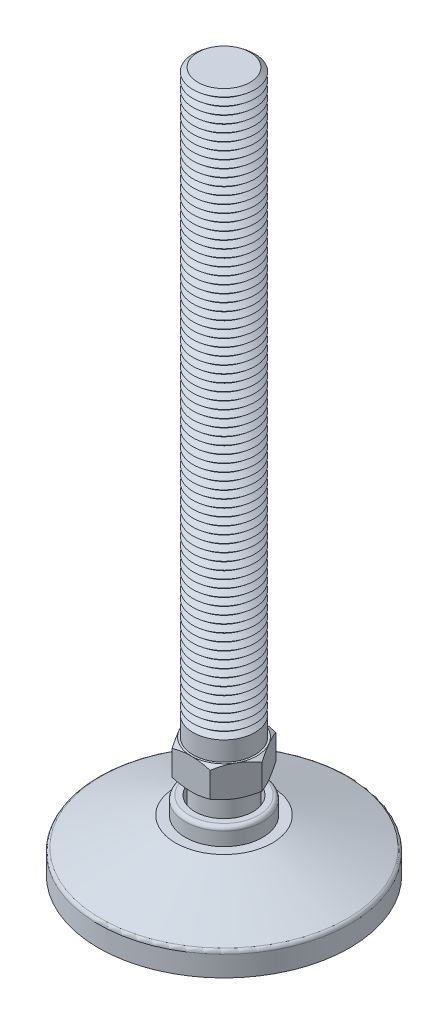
ISO-10303-21;
HEADER;
FILE_DESCRIPTION(('STEP AP214'),'2;1');
FILE_NAME('part.step','',(''),(''),'','','');
FILE_SCHEMA(('AUTOMOTIVE_DESIGN { 1 0 10303 214 1 1 1 1 }'));
ENDSEC;
DATA;
#1=APPLICATION_CONTEXT('core data for automotive mechanical design processes');
#2=APPLICATION_PROTOCOL_DEFINITION('international standard','automotive_design',2000,#1);
#3=PRODUCT_CONTEXT('',#1,'mechanical');
#4=PRODUCT('Part','Part','',(#3));
#5=PRODUCT_RELATED_PRODUCT_CATEGORY('part','',(#4));
#6=PRODUCT_DEFINITION_FORMATION('','',#4);
#7=PRODUCT_DEFINITION_CONTEXT('part definition',#1,'design');
#8=PRODUCT_DEFINITION('design','',#6,#7);
#9=PRODUCT_DEFINITION_SHAPE('','',#8);
#10=(LENGTH_UNIT() NAMED_UNIT(*) SI_UNIT(.MILLI.,.METRE.));
#11=(NAMED_UNIT(*) PLANE_ANGLE_UNIT() SI_UNIT($,.RADIAN.));
#12=(NAMED_UNIT(*) SI_UNIT($,.STERADIAN.) SOLID_ANGLE_UNIT());
#13=UNCERTAINTY_MEASURE_WITH_UNIT(LENGTH_MEASURE(1.E-05),#10,'distance_accuracy_value','');
#14=(GEOMETRIC_REPRESENTATION_CONTEXT(3) GLOBAL_UNCERTAINTY_ASSIGNED_CONTEXT((#13)) GLOBAL_UNIT_ASSIGNED_CONTEXT((#10,
#11,#12)) REPRESENTATION_CONTEXT('',''));
#15=CARTESIAN_POINT('',(0.,0.,0.));
#16=DIRECTION('',(0.,0.,1.));
#17=DIRECTION('',(1.,0.,0.));
#18=AXIS2_PLACEMENT_3D('',#15,#16,#17);
#19=CARTESIAN_POINT('',(0.,3.,0.));
#20=DIRECTION('',(0.,-1.,0.));
#21=DIRECTION('',(0.,0.,-1.));
#22=AXIS2_PLACEMENT_3D('',#19,#20,#21);
#23=CYLINDRICAL_SURFACE('',#22,29.5);
#24=CARTESIAN_POINT('',(0.,3.,0.));
#25=DIRECTION('',(0.,1.,0.));
#26=DIRECTION('',(0.,0.,1.));
#27=AXIS2_PLACEMENT_3D('',#24,#25,#26);
#28=CIRCLE('',#27,29.5);
#29=CARTESIAN_POINT('',(0.,3.,29.5));
#30=VERTEX_POINT('',#29);
#31=EDGE_CURVE('P0_E10',#30,#30,#28,.T.);
#32=ORIENTED_EDGE('',*,*,#31,.F.);
#33=EDGE_LOOP('',(#32));
#34=FACE_BOUND('',#33,.T.);
#35=CARTESIAN_POINT('',(0.,0.,0.));
#36=DIRECTION('',(0.,1.,0.));
#37=DIRECTION('',(0.,0.,1.));
#38=AXIS2_PLACEMENT_3D('',#35,#36,#37);
#39=CIRCLE('',#38,29.5);
#40=CARTESIAN_POINT('',(0.,0.,29.5));
#41=VERTEX_POINT('',#40);
#42=EDGE_CURVE('P0_E17',#41,#41,#39,.T.);
#43=ORIENTED_EDGE('',*,*,#42,.T.);
#44=EDGE_LOOP('',(#43));
#45=FACE_BOUND('',#44,.T.);
#46=ADVANCED_FACE('P0_F14',(#34,#45),#23,.T.);
#47=CARTESIAN_POINT('',(0.,3.,0.));
#48=DIRECTION('',(0.,1.,0.));
#49=DIRECTION('',(0.,0.,1.));
#50=AXIS2_PLACEMENT_3D('',#47,#48,#49);
#51=PLANE('',#50);
#52=CARTESIAN_POINT('',(0.,3.,0.));
#53=DIRECTION('',(0.,1.,0.));
#54=DIRECTION('',(0.,0.,1.));
#55=AXIS2_PLACEMENT_3D('',#52,#53,#54);
#56=CIRCLE('',#55,9.83333333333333);
#57=CARTESIAN_POINT('',(0.,3.,9.83333333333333));
#58=VERTEX_POINT('',#57);
#59=EDGE_CURVE('P0_E26',#58,#58,#56,.T.);
#60=ORIENTED_EDGE('',*,*,#59,.F.);
#61=EDGE_LOOP('',(#60));
#62=FACE_BOUND('',#61,.T.);
#63=ORIENTED_EDGE('',*,*,#31,.T.);
#64=EDGE_LOOP('',(#63));
#65=FACE_BOUND('',#64,.T.);
#66=ADVANCED_FACE('P0_F41',(#62,#65),#51,.T.);
#67=CARTESIAN_POINT('',(0.,0.,0.));
#68=DIRECTION('',(0.,1.,0.));
#69=DIRECTION('',(0.,0.,1.));
#70=AXIS2_PLACEMENT_3D('',#67,#68,#69);
#71=PLANE('',#70);
#72=ORIENTED_EDGE('',*,*,#42,.F.);
#73=EDGE_LOOP('',(#72));
#74=FACE_BOUND('',#73,.T.);
#75=ADVANCED_FACE('P0_F37',(#74),#71,.F.);
#76=CARTESIAN_POINT('',(0.,2.,0.));
#77=DIRECTION('',(0.,1.,0.));
#78=DIRECTION('',(0.,0.,1.));
#79=AXIS2_PLACEMENT_3D('',#76,#77,#78);
#80=CYLINDRICAL_SURFACE('',#79,9.83333333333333);
#81=CARTESIAN_POINT('',(0.,2.,0.));
#82=DIRECTION('',(0.,1.,0.));
#83=DIRECTION('',(0.,0.,1.));
#84=AXIS2_PLACEMENT_3D('',#81,#82,#83);
#85=CIRCLE('',#84,9.83333333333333);
#86=CARTESIAN_POINT('',(0.,2.,9.83333333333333));
#87=VERTEX_POINT('',#86);
#88=EDGE_CURVE('P0_E24',#87,#87,#85,.T.);
#89=ORIENTED_EDGE('',*,*,#88,.F.);
#90=EDGE_LOOP('',(#89));
#91=FACE_BOUND('',#90,.T.);
#92=ORIENTED_EDGE('',*,*,#59,.T.);
#93=EDGE_LOOP('',(#92));
#94=FACE_BOUND('',#93,.T.);
#95=ADVANCED_FACE('P0_F34',(#91,#94),#80,.F.);
#96=CARTESIAN_POINT('',(0.,2.,0.));
#97=DIRECTION('',(0.,1.,0.));
#98=DIRECTION('',(0.,0.,1.));
#99=AXIS2_PLACEMENT_3D('',#96,#97,#98);
#100=PLANE('',#99);
#101=ORIENTED_EDGE('',*,*,#88,.T.);
#102=EDGE_LOOP('',(#101));
#103=FACE_BOUND('',#102,.T.);
#104=ADVANCED_FACE('P0_F32',(#103),#100,.T.);
#105=CLOSED_SHELL('',(#46,#66,#75,#95,#104));
#106=MANIFOLD_SOLID_BREP('P0_B1',#105);
#107=CARTESIAN_POINT('',(0.,175.,0.));
#108=DIRECTION('',(0.,-1.,0.));
#109=DIRECTION('',(0.,0.,-1.));
#110=AXIS2_PLACEMENT_3D('',#107,#108,#109);
#111=CONICAL_SURFACE('',#110,6.75100040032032,0.895664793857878);
#112=CARTESIAN_POINT('',(0.,174.,0.));
#113=DIRECTION('',(0.,-1.,0.));
#114=DIRECTION('',(0.,0.,-1.));
#115=AXIS2_PLACEMENT_3D('',#112,#113,#114);
#116=CIRCLE('',#115,8.);
#117=CARTESIAN_POINT('',(0.,174.,-8.));
#118=VERTEX_POINT('',#117);
#119=EDGE_CURVE('P1_E2366',#118,#118,#116,.T.);
#120=ORIENTED_EDGE('',*,*,#119,.F.);
#121=EDGE_LOOP('',(#120));
#122=FACE_BOUND('',#121,.T.);
#123=CARTESIAN_POINT('',(0.,175.,0.));
#124=DIRECTION('',(0.,-1.,0.));
#125=DIRECTION('',(0.,0.,-1.));
#126=AXIS2_PLACEMENT_3D('',#123,#124,#125);
#127=CIRCLE('',#126,6.75100040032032);
#128=CARTESIAN_POINT('',(0.,175.,-6.75100040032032));
#129=VERTEX_POINT('',#128);
#130=EDGE_CURVE('P1_E2375',#129,#129,#127,.T.);
#131=ORIENTED_EDGE('',*,*,#130,.T.);
#132=EDGE_LOOP('',(#131));
#133=FACE_BOUND('',#132,.T.);
#134=ADVANCED_FACE('P1_F16',(#122,#133),#111,.T.);
#135=CARTESIAN_POINT('',(0.,176.,0.));
#136=DIRECTION('',(0.,1.,0.));
#137=DIRECTION('',(0.,0.,1.));
#138=AXIS2_PLACEMENT_3D('',#135,#136,#137);
#139=CONICAL_SURFACE('',#138,8.,0.895664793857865);
#140=ORIENTED_EDGE('',*,*,#130,.F.);
#141=EDGE_LOOP('',(#140));
#142=FACE_BOUND('',#141,.T.);
#143=CARTESIAN_POINT('',(0.,176.,0.));
#144=DIRECTION('',(0.,-1.,0.));
#145=DIRECTION('',(0.,0.,-1.));
#146=AXIS2_PLACEMENT_3D('',#143,#144,#145);
#147=CIRCLE('',#146,8.);
#148=CARTESIAN_POINT('',(0.,176.,-8.));
#149=VERTEX_POINT('',#148);
#150=EDGE_CURVE('P1_E2372',#149,#149,#147,.T.);
#151=ORIENTED_EDGE('',*,*,#150,.T.);
#152=EDGE_LOOP('',(#151));
#153=FACE_BOUND('',#152,.T.);
#154=ADVANCED_FACE('P1_F308',(#142,#153),#139,.T.);
#155=CARTESIAN_POINT('',(0.,183.,0.));
#156=DIRECTION('',(0.,1.,0.));
#157=DIRECTION('',(0.,0.,1.));
#158=AXIS2_PLACEMENT_3D('',#155,#156,#157);
#159=PLANE('',#158);
#160=CARTESIAN_POINT('',(0.,183.,0.));
#161=DIRECTION('',(0.,-1.,0.));
#162=DIRECTION('',(0.,0.,-1.));
#163=AXIS2_PLACEMENT_3D('',#160,#161,#162);
#164=CIRCLE('',#163,6.75100040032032);
#165=CARTESIAN_POINT('',(0.,183.,-6.75100040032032));
#166=VERTEX_POINT('',#165);
#167=EDGE_CURVE('P1_E143',#166,#166,#164,.T.);
#168=ORIENTED_EDGE('',*,*,#167,.F.);
#169=EDGE_LOOP('',(#168));
#170=FACE_BOUND('',#169,.T.);
#171=ADVANCED_FACE('P1_F314',(#170),#159,.T.);
#172=CARTESIAN_POINT('',(0.,183.,0.));
#173=DIRECTION('',(0.,-1.,0.));
#174=DIRECTION('',(0.,0.,-1.));
#175=AXIS2_PLACEMENT_3D('',#172,#173,#174);
#176=CONICAL_SURFACE('',#175,6.75100040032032,0.895664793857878);
#177=CARTESIAN_POINT('',(0.,182.,0.));
#178=DIRECTION('',(0.,-1.,0.));
#179=DIRECTION('',(0.,0.,-1.));
#180=AXIS2_PLACEMENT_3D('',#177,#178,#179);
#181=CIRCLE('',#180,8.);
#182=CARTESIAN_POINT('',(0.,182.,-8.));
#183=VERTEX_POINT('',#182);
#184=EDGE_CURVE('P1_E353',#183,#183,#181,.T.);
#185=ORIENTED_EDGE('',*,*,#184,.F.);
#186=EDGE_LOOP('',(#185));
#187=FACE_BOUND('',#186,.T.);
#188=ORIENTED_EDGE('',*,*,#167,.T.);
#189=EDGE_LOOP('',(#188));
#190=FACE_BOUND('',#189,.T.);
#191=ADVANCED_FACE('P1_F211',(#187,#190),#176,.T.);
#192=CARTESIAN_POINT('',(0.,182.,0.));
#193=DIRECTION('',(0.,1.,0.));
#194=DIRECTION('',(0.,0.,1.));
#195=AXIS2_PLACEMENT_3D('',#192,#193,#194);
#196=CONICAL_SURFACE('',#195,8.,0.895664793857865);
#197=CARTESIAN_POINT('',(0.,181.,0.));
#198=DIRECTION('',(0.,-1.,0.));
#199=DIRECTION('',(0.,0.,-1.));
#200=AXIS2_PLACEMENT_3D('',#197,#198,#199);
#201=CIRCLE('',#200,6.75100040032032);
#202=CARTESIAN_POINT('',(0.,181.,-6.75100040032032));
#203=VERTEX_POINT('',#202);
#204=EDGE_CURVE('P1_E352',#203,#203,#201,.T.);
#205=ORIENTED_EDGE('',*,*,#204,.F.);
#206=EDGE_LOOP('',(#205));
#207=FACE_BOUND('',#206,.T.);
#208=ORIENTED_EDGE('',*,*,#184,.T.);
#209=EDGE_LOOP('',(#208));
#210=FACE_BOUND('',#209,.T.);
#211=ADVANCED_FACE('P1_F339',(#207,#210),#196,.T.);
#212=CARTESIAN_POINT('',(0.,181.,0.));
#213=DIRECTION('',(0.,-1.,0.));
#214=DIRECTION('',(0.,0.,-1.));
#215=AXIS2_PLACEMENT_3D('',#212,#213,#214);
#216=CONICAL_SURFACE('',#215,6.75100040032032,0.895664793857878);
#217=CARTESIAN_POINT('',(0.,180.,0.));
#218=DIRECTION('',(0.,-1.,0.));
#219=DIRECTION('',(0.,0.,-1.));
#220=AXIS2_PLACEMENT_3D('',#217,#218,#219);
#221=CIRCLE('',#220,8.);
#222=CARTESIAN_POINT('',(0.,180.,-8.));
#223=VERTEX_POINT('',#222);
#224=EDGE_CURVE('P1_E349',#223,#223,#221,.T.);
#225=ORIENTED_EDGE('',*,*,#224,.F.);
#226=EDGE_LOOP('',(#225));
#227=FACE_BOUND('',#226,.T.);
#228=ORIENTED_EDGE('',*,*,#204,.T.);
#229=EDGE_LOOP('',(#228));
#230=FACE_BOUND('',#229,.T.);
#231=ADVANCED_FACE('P1_F334',(#227,#230),#216,.T.);
#232=CARTESIAN_POINT('',(0.,180.,0.));
#233=DIRECTION('',(0.,1.,0.));
#234=DIRECTION('',(0.,0.,1.));
#235=AXIS2_PLACEMENT_3D('',#232,#233,#234);
#236=CONICAL_SURFACE('',#235,8.,0.895664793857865);
#237=CARTESIAN_POINT('',(0.,179.,0.));
#238=DIRECTION('',(0.,-1.,0.));
#239=DIRECTION('',(0.,0.,-1.));
#240=AXIS2_PLACEMENT_3D('',#237,#238,#239);
#241=CIRCLE('',#240,6.75100040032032);
#242=CARTESIAN_POINT('',(0.,179.,-6.75100040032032));
#243=VERTEX_POINT('',#242);
#244=EDGE_CURVE('P1_E358',#243,#243,#241,.T.);
#245=ORIENTED_EDGE('',*,*,#244,.F.);
#246=EDGE_LOOP('',(#245));
#247=FACE_BOUND('',#246,.T.);
#248=ORIENTED_EDGE('',*,*,#224,.T.);
#249=EDGE_LOOP('',(#248));
#250=FACE_BOUND('',#249,.T.);
#251=ADVANCED_FACE('P1_F331',(#247,#250),#236,.T.);
#252=CARTESIAN_POINT('',(0.,179.,0.));
#253=DIRECTION('',(0.,-1.,0.));
#254=DIRECTION('',(0.,0.,-1.));
#255=AXIS2_PLACEMENT_3D('',#252,#253,#254);
#256=CONICAL_SURFACE('',#255,6.75100040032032,0.895664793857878);
#257=CARTESIAN_POINT('',(0.,178.,0.));
#258=DIRECTION('',(0.,-1.,0.));
#259=DIRECTION('',(0.,0.,-1.));
#260=AXIS2_PLACEMENT_3D('',#257,#258,#259);
#261=CIRCLE('',#260,8.);
#262=CARTESIAN_POINT('',(0.,178.,-8.));
#263=VERTEX_POINT('',#262);
#264=EDGE_CURVE('P1_E2378',#263,#263,#261,.T.);
#265=ORIENTED_EDGE('',*,*,#264,.F.);
#266=EDGE_LOOP('',(#265));
#267=FACE_BOUND('',#266,.T.);
#268=ORIENTED_EDGE('',*,*,#244,.T.);
#269=EDGE_LOOP('',(#268));
#270=FACE_BOUND('',#269,.T.);
#271=ADVANCED_FACE('P1_F325',(#267,#270),#256,.T.);
#272=CARTESIAN_POINT('',(0.,178.,0.));
#273=DIRECTION('',(0.,1.,0.));
#274=DIRECTION('',(0.,0.,1.));
#275=AXIS2_PLACEMENT_3D('',#272,#273,#274);
#276=CONICAL_SURFACE('',#275,8.,0.895664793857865);
#277=CARTESIAN_POINT('',(0.,177.,0.));
#278=DIRECTION('',(0.,-1.,0.));
#279=DIRECTION('',(0.,0.,-1.));
#280=AXIS2_PLACEMENT_3D('',#277,#278,#279);
#281=CIRCLE('',#280,6.75100040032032);
#282=CARTESIAN_POINT('',(0.,177.,-6.75100040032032));
#283=VERTEX_POINT('',#282);
#284=EDGE_CURVE('P1_E2381',#283,#283,#281,.T.);
#285=ORIENTED_EDGE('',*,*,#284,.F.);
#286=EDGE_LOOP('',(#285));
#287=FACE_BOUND('',#286,.T.);
#288=ORIENTED_EDGE('',*,*,#264,.T.);
#289=EDGE_LOOP('',(#288));
#290=FACE_BOUND('',#289,.T.);
#291=ADVANCED_FACE('P1_F321',(#287,#290),#276,.T.);
#292=CARTESIAN_POINT('',(0.,177.,0.));
#293=DIRECTION('',(0.,-1.,0.));
#294=DIRECTION('',(0.,0.,-1.));
#295=AXIS2_PLACEMENT_3D('',#292,#293,#294);
#296=CONICAL_SURFACE('',#295,6.75100040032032,0.895664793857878);
#297=ORIENTED_EDGE('',*,*,#150,.F.);
#298=EDGE_LOOP('',(#297));
#299=FACE_BOUND('',#298,.T.);
#300=ORIENTED_EDGE('',*,*,#284,.T.);
#301=EDGE_LOOP('',(#300));
#302=FACE_BOUND('',#301,.T.);
#303=ADVANCED_FACE('P1_F324',(#299,#302),#296,.T.);
#304=CARTESIAN_POINT('',(0.,173.,0.));
#305=DIRECTION('',(0.,-1.,0.));
#306=DIRECTION('',(0.,0.,-1.));
#307=AXIS2_PLACEMENT_3D('',#304,#305,#306);
#308=CONICAL_SURFACE('',#307,6.75100040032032,0.895664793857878);
#309=CARTESIAN_POINT('',(0.,172.,0.));
#310=DIRECTION('',(0.,-1.,0.));
#311=DIRECTION('',(0.,0.,-1.));
#312=AXIS2_PLACEMENT_3D('',#309,#310,#311);
#313=CIRCLE('',#312,8.);
#314=CARTESIAN_POINT('',(0.,172.,-8.));
#315=VERTEX_POINT('',#314);
#316=EDGE_CURVE('P1_E2360',#315,#315,#313,.T.);
#317=ORIENTED_EDGE('',*,*,#316,.F.);
#318=EDGE_LOOP('',(#317));
#319=FACE_BOUND('',#318,.T.);
#320=CARTESIAN_POINT('',(0.,173.,0.));
#321=DIRECTION('',(0.,-1.,0.));
#322=DIRECTION('',(0.,0.,-1.));
#323=AXIS2_PLACEMENT_3D('',#320,#321,#322);
#324=CIRCLE('',#323,6.75100040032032);
#325=CARTESIAN_POINT('',(0.,173.,-6.75100040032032));
#326=VERTEX_POINT('',#325);
#327=EDGE_CURVE('P1_E2369',#326,#326,#324,.T.);
#328=ORIENTED_EDGE('',*,*,#327,.T.);
#329=EDGE_LOOP('',(#328));
#330=FACE_BOUND('',#329,.T.);
#331=ADVANCED_FACE('P1_F329',(#319,#330),#308,.T.);
#332=CARTESIAN_POINT('',(0.,174.,0.));
#333=DIRECTION('',(0.,1.,0.));
#334=DIRECTION('',(0.,0.,1.));
#335=AXIS2_PLACEMENT_3D('',#332,#333,#334);
#336=CONICAL_SURFACE('',#335,8.,0.895664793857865);
#337=ORIENTED_EDGE('',*,*,#327,.F.);
#338=EDGE_LOOP('',(#337));
#339=FACE_BOUND('',#338,.T.);
#340=ORIENTED_EDGE('',*,*,#119,.T.);
#341=EDGE_LOOP('',(#340));
#342=FACE_BOUND('',#341,.T.);
#343=ADVANCED_FACE('P1_F1864',(#339,#342),#336,.T.);
#344=CARTESIAN_POINT('',(0.,171.,0.));
#345=DIRECTION('',(0.,-1.,0.));
#346=DIRECTION('',(0.,0.,-1.));
#347=AXIS2_PLACEMENT_3D('',#344,#345,#346);
#348=CONICAL_SURFACE('',#347,6.75100040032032,0.895664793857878);
#349=CARTESIAN_POINT('',(0.,170.,0.));
#350=DIRECTION('',(0.,-1.,0.));
#351=DIRECTION('',(0.,0.,-1.));
#352=AXIS2_PLACEMENT_3D('',#349,#350,#351);
#353=CIRCLE('',#352,8.);
#354=CARTESIAN_POINT('',(0.,170.,-8.));
#355=VERTEX_POINT('',#354);
#356=EDGE_CURVE('P1_E2354',#355,#355,#353,.T.);
#357=ORIENTED_EDGE('',*,*,#356,.F.);
#358=EDGE_LOOP('',(#357));
#359=FACE_BOUND('',#358,.T.);
#360=CARTESIAN_POINT('',(0.,171.,0.));
#361=DIRECTION('',(0.,-1.,0.));
#362=DIRECTION('',(0.,0.,-1.));
#363=AXIS2_PLACEMENT_3D('',#360,#361,#362);
#364=CIRCLE('',#363,6.75100040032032);
#365=CARTESIAN_POINT('',(0.,171.,-6.75100040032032));
#366=VERTEX_POINT('',#365);
#367=EDGE_CURVE('P1_E2363',#366,#366,#364,.T.);
#368=ORIENTED_EDGE('',*,*,#367,.T.);
#369=EDGE_LOOP('',(#368));
#370=FACE_BOUND('',#369,.T.);
#371=ADVANCED_FACE('P1_F1854',(#359,#370),#348,.T.);
#372=CARTESIAN_POINT('',(0.,172.,0.));
#373=DIRECTION('',(0.,1.,0.));
#374=DIRECTION('',(0.,0.,1.));
#375=AXIS2_PLACEMENT_3D('',#372,#373,#374);
#376=CONICAL_SURFACE('',#375,8.,0.895664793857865);
#377=ORIENTED_EDGE('',*,*,#367,.F.);
#378=EDGE_LOOP('',(#377));
#379=FACE_BOUND('',#378,.T.);
#380=ORIENTED_EDGE('',*,*,#316,.T.);
#381=EDGE_LOOP('',(#380));
#382=FACE_BOUND('',#381,.T.);
#383=ADVANCED_FACE('P1_F1844',(#379,#382),#376,.T.);
#384=CARTESIAN_POINT('',(0.,169.,0.));
#385=DIRECTION('',(0.,-1.,0.));
#386=DIRECTION('',(0.,0.,-1.));
#387=AXIS2_PLACEMENT_3D('',#384,#385,#386);
#388=CONICAL_SURFACE('',#387,6.75100040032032,0.895664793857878);
#389=CARTESIAN_POINT('',(0.,168.,0.));
#390=DIRECTION('',(0.,-1.,0.));
#391=DIRECTION('',(0.,0.,-1.));
#392=AXIS2_PLACEMENT_3D('',#389,#390,#391);
#393=CIRCLE('',#392,8.);
#394=CARTESIAN_POINT('',(0.,168.,-8.));
#395=VERTEX_POINT('',#394);
#396=EDGE_CURVE('P1_E2348',#395,#395,#393,.T.);
#397=ORIENTED_EDGE('',*,*,#396,.F.);
#398=EDGE_LOOP('',(#397));
#399=FACE_BOUND('',#398,.T.);
#400=CARTESIAN_POINT('',(0.,169.,0.));
#401=DIRECTION('',(0.,-1.,0.));
#402=DIRECTION('',(0.,0.,-1.));
#403=AXIS2_PLACEMENT_3D('',#400,#401,#402);
#404=CIRCLE('',#403,6.75100040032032);
#405=CARTESIAN_POINT('',(0.,169.,-6.75100040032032));
#406=VERTEX_POINT('',#405);
#407=EDGE_CURVE('P1_E2357',#406,#406,#404,.T.);
#408=ORIENTED_EDGE('',*,*,#407,.T.);
#409=EDGE_LOOP('',(#408));
#410=FACE_BOUND('',#409,.T.);
#411=ADVANCED_FACE('P1_F1834',(#399,#410),#388,.T.);
#412=CARTESIAN_POINT('',(0.,170.,0.));
#413=DIRECTION('',(0.,1.,0.));
#414=DIRECTION('',(0.,0.,1.));
#415=AXIS2_PLACEMENT_3D('',#412,#413,#414);
#416=CONICAL_SURFACE('',#415,8.,0.895664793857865);
#417=ORIENTED_EDGE('',*,*,#407,.F.);
#418=EDGE_LOOP('',(#417));
#419=FACE_BOUND('',#418,.T.);
#420=ORIENTED_EDGE('',*,*,#356,.T.);
#421=EDGE_LOOP('',(#420));
#422=FACE_BOUND('',#421,.T.);
#423=ADVANCED_FACE('P1_F1824',(#419,#422),#416,.T.);
#424=CARTESIAN_POINT('',(0.,167.,0.));
#425=DIRECTION('',(0.,-1.,0.));
#426=DIRECTION('',(0.,0.,-1.));
#427=AXIS2_PLACEMENT_3D('',#424,#425,#426);
#428=CONICAL_SURFACE('',#427,6.75100040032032,0.895664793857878);
#429=CARTESIAN_POINT('',(0.,166.,0.));
#430=DIRECTION('',(0.,-1.,0.));
#431=DIRECTION('',(0.,0.,-1.));
#432=AXIS2_PLACEMENT_3D('',#429,#430,#431);
#433=CIRCLE('',#432,8.);
#434=CARTESIAN_POINT('',(0.,166.,-8.));
#435=VERTEX_POINT('',#434);
#436=EDGE_CURVE('P1_E2342',#435,#435,#433,.T.);
#437=ORIENTED_EDGE('',*,*,#436,.F.);
#438=EDGE_LOOP('',(#437));
#439=FACE_BOUND('',#438,.T.);
#440=CARTESIAN_POINT('',(0.,167.,0.));
#441=DIRECTION('',(0.,-1.,0.));
#442=DIRECTION('',(0.,0.,-1.));
#443=AXIS2_PLACEMENT_3D('',#440,#441,#442);
#444=CIRCLE('',#443,6.75100040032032);
#445=CARTESIAN_POINT('',(0.,167.,-6.75100040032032));
#446=VERTEX_POINT('',#445);
#447=EDGE_CURVE('P1_E2351',#446,#446,#444,.T.);
#448=ORIENTED_EDGE('',*,*,#447,.T.);
#449=EDGE_LOOP('',(#448));
#450=FACE_BOUND('',#449,.T.);
#451=ADVANCED_FACE('P1_F1814',(#439,#450),#428,.T.);
#452=CARTESIAN_POINT('',(0.,168.,0.));
#453=DIRECTION('',(0.,1.,0.));
#454=DIRECTION('',(0.,0.,1.));
#455=AXIS2_PLACEMENT_3D('',#452,#453,#454);
#456=CONICAL_SURFACE('',#455,8.,0.895664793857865);
#457=ORIENTED_EDGE('',*,*,#447,.F.);
#458=EDGE_LOOP('',(#457));
#459=FACE_BOUND('',#458,.T.);
#460=ORIENTED_EDGE('',*,*,#396,.T.);
#461=EDGE_LOOP('',(#460));
#462=FACE_BOUND('',#461,.T.);
#463=ADVANCED_FACE('P1_F1804',(#459,#462),#456,.T.);
#464=CARTESIAN_POINT('',(0.,165.,0.));
#465=DIRECTION('',(0.,-1.,0.));
#466=DIRECTION('',(0.,0.,-1.));
#467=AXIS2_PLACEMENT_3D('',#464,#465,#466);
#468=CONICAL_SURFACE('',#467,6.75100040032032,0.895664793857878);
#469=CARTESIAN_POINT('',(0.,164.,0.));
#470=DIRECTION('',(0.,-1.,0.));
#471=DIRECTION('',(0.,0.,-1.));
#472=AXIS2_PLACEMENT_3D('',#469,#470,#471);
#473=CIRCLE('',#472,8.);
#474=CARTESIAN_POINT('',(0.,164.,-8.));
#475=VERTEX_POINT('',#474);
#476=EDGE_CURVE('P1_E2336',#475,#475,#473,.T.);
#477=ORIENTED_EDGE('',*,*,#476,.F.);
#478=EDGE_LOOP('',(#477));
#479=FACE_BOUND('',#478,.T.);
#480=CARTESIAN_POINT('',(0.,165.,0.));
#481=DIRECTION('',(0.,-1.,0.));
#482=DIRECTION('',(0.,0.,-1.));
#483=AXIS2_PLACEMENT_3D('',#480,#481,#482);
#484=CIRCLE('',#483,6.75100040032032);
#485=CARTESIAN_POINT('',(0.,165.,-6.75100040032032));
#486=VERTEX_POINT('',#485);
#487=EDGE_CURVE('P1_E2345',#486,#486,#484,.T.);
#488=ORIENTED_EDGE('',*,*,#487,.T.);
#489=EDGE_LOOP('',(#488));
#490=FACE_BOUND('',#489,.T.);
#491=ADVANCED_FACE('P1_F1794',(#479,#490),#468,.T.);
#492=CARTESIAN_POINT('',(0.,166.,0.));
#493=DIRECTION('',(0.,1.,0.));
#494=DIRECTION('',(0.,0.,1.));
#495=AXIS2_PLACEMENT_3D('',#492,#493,#494);
#496=CONICAL_SURFACE('',#495,8.,0.895664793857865);
#497=ORIENTED_EDGE('',*,*,#487,.F.);
#498=EDGE_LOOP('',(#497));
#499=FACE_BOUND('',#498,.T.);
#500=ORIENTED_EDGE('',*,*,#436,.T.);
#501=EDGE_LOOP('',(#500));
#502=FACE_BOUND('',#501,.T.);
#503=ADVANCED_FACE('P1_F1784',(#499,#502),#496,.T.);
#504=CARTESIAN_POINT('',(0.,163.,0.));
#505=DIRECTION('',(0.,-1.,0.));
#506=DIRECTION('',(0.,0.,-1.));
#507=AXIS2_PLACEMENT_3D('',#504,#505,#506);
#508=CONICAL_SURFACE('',#507,6.75100040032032,0.895664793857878);
#509=CARTESIAN_POINT('',(0.,162.,0.));
#510=DIRECTION('',(0.,-1.,0.));
#511=DIRECTION('',(0.,0.,-1.));
#512=AXIS2_PLACEMENT_3D('',#509,#510,#511);
#513=CIRCLE('',#512,8.);
#514=CARTESIAN_POINT('',(0.,162.,-8.));
#515=VERTEX_POINT('',#514);
#516=EDGE_CURVE('P1_E2330',#515,#515,#513,.T.);
#517=ORIENTED_EDGE('',*,*,#516,.F.);
#518=EDGE_LOOP('',(#517));
#519=FACE_BOUND('',#518,.T.);
#520=CARTESIAN_POINT('',(0.,163.,0.));
#521=DIRECTION('',(0.,-1.,0.));
#522=DIRECTION('',(0.,0.,-1.));
#523=AXIS2_PLACEMENT_3D('',#520,#521,#522);
#524=CIRCLE('',#523,6.75100040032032);
#525=CARTESIAN_POINT('',(0.,163.,-6.75100040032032));
#526=VERTEX_POINT('',#525);
#527=EDGE_CURVE('P1_E2339',#526,#526,#524,.T.);
#528=ORIENTED_EDGE('',*,*,#527,.T.);
#529=EDGE_LOOP('',(#528));
#530=FACE_BOUND('',#529,.T.);
#531=ADVANCED_FACE('P1_F1774',(#519,#530),#508,.T.);
#532=CARTESIAN_POINT('',(0.,164.,0.));
#533=DIRECTION('',(0.,1.,0.));
#534=DIRECTION('',(0.,0.,1.));
#535=AXIS2_PLACEMENT_3D('',#532,#533,#534);
#536=CONICAL_SURFACE('',#535,8.,0.895664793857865);
#537=ORIENTED_EDGE('',*,*,#527,.F.);
#538=EDGE_LOOP('',(#537));
#539=FACE_BOUND('',#538,.T.);
#540=ORIENTED_EDGE('',*,*,#476,.T.);
#541=EDGE_LOOP('',(#540));
#542=FACE_BOUND('',#541,.T.);
#543=ADVANCED_FACE('P1_F1764',(#539,#542),#536,.T.);
#544=CARTESIAN_POINT('',(0.,161.,0.));
#545=DIRECTION('',(0.,-1.,0.));
#546=DIRECTION('',(0.,0.,-1.));
#547=AXIS2_PLACEMENT_3D('',#544,#545,#546);
#548=CONICAL_SURFACE('',#547,6.75100040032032,0.895664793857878);
#549=CARTESIAN_POINT('',(0.,160.,0.));
#550=DIRECTION('',(0.,-1.,0.));
#551=DIRECTION('',(0.,0.,-1.));
#552=AXIS2_PLACEMENT_3D('',#549,#550,#551);
#553=CIRCLE('',#552,8.);
#554=CARTESIAN_POINT('',(0.,160.,-8.));
#555=VERTEX_POINT('',#554);
#556=EDGE_CURVE('P1_E2324',#555,#555,#553,.T.);
#557=ORIENTED_EDGE('',*,*,#556,.F.);
#558=EDGE_LOOP('',(#557));
#559=FACE_BOUND('',#558,.T.);
#560=CARTESIAN_POINT('',(0.,161.,0.));
#561=DIRECTION('',(0.,-1.,0.));
#562=DIRECTION('',(0.,0.,-1.));
#563=AXIS2_PLACEMENT_3D('',#560,#561,#562);
#564=CIRCLE('',#563,6.75100040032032);
#565=CARTESIAN_POINT('',(0.,161.,-6.75100040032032));
#566=VERTEX_POINT('',#565);
#567=EDGE_CURVE('P1_E2333',#566,#566,#564,.T.);
#568=ORIENTED_EDGE('',*,*,#567,.T.);
#569=EDGE_LOOP('',(#568));
#570=FACE_BOUND('',#569,.T.);
#571=ADVANCED_FACE('P1_F1754',(#559,#570),#548,.T.);
#572=CARTESIAN_POINT('',(0.,162.,0.));
#573=DIRECTION('',(0.,1.,0.));
#574=DIRECTION('',(0.,0.,1.));
#575=AXIS2_PLACEMENT_3D('',#572,#573,#574);
#576=CONICAL_SURFACE('',#575,8.,0.895664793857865);
#577=ORIENTED_EDGE('',*,*,#567,.F.);
#578=EDGE_LOOP('',(#577));
#579=FACE_BOUND('',#578,.T.);
#580=ORIENTED_EDGE('',*,*,#516,.T.);
#581=EDGE_LOOP('',(#580));
#582=FACE_BOUND('',#581,.T.);
#583=ADVANCED_FACE('P1_F1744',(#579,#582),#576,.T.);
#584=CARTESIAN_POINT('',(0.,159.,0.));
#585=DIRECTION('',(0.,-1.,0.));
#586=DIRECTION('',(0.,0.,-1.));
#587=AXIS2_PLACEMENT_3D('',#584,#585,#586);
#588=CONICAL_SURFACE('',#587,6.75100040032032,0.895664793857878);
#589=CARTESIAN_POINT('',(0.,158.,0.));
#590=DIRECTION('',(0.,-1.,0.));
#591=DIRECTION('',(0.,0.,-1.));
#592=AXIS2_PLACEMENT_3D('',#589,#590,#591);
#593=CIRCLE('',#592,8.);
#594=CARTESIAN_POINT('',(0.,158.,-8.));
#595=VERTEX_POINT('',#594);
#596=EDGE_CURVE('P1_E2318',#595,#595,#593,.T.);
#597=ORIENTED_EDGE('',*,*,#596,.F.);
#598=EDGE_LOOP('',(#597));
#599=FACE_BOUND('',#598,.T.);
#600=CARTESIAN_POINT('',(0.,159.,0.));
#601=DIRECTION('',(0.,-1.,0.));
#602=DIRECTION('',(0.,0.,-1.));
#603=AXIS2_PLACEMENT_3D('',#600,#601,#602);
#604=CIRCLE('',#603,6.75100040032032);
#605=CARTESIAN_POINT('',(0.,159.,-6.75100040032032));
#606=VERTEX_POINT('',#605);
#607=EDGE_CURVE('P1_E2327',#606,#606,#604,.T.);
#608=ORIENTED_EDGE('',*,*,#607,.T.);
#609=EDGE_LOOP('',(#608));
#610=FACE_BOUND('',#609,.T.);
#611=ADVANCED_FACE('P1_F1734',(#599,#610),#588,.T.);
#612=CARTESIAN_POINT('',(0.,160.,0.));
#613=DIRECTION('',(0.,1.,0.));
#614=DIRECTION('',(0.,0.,1.));
#615=AXIS2_PLACEMENT_3D('',#612,#613,#614);
#616=CONICAL_SURFACE('',#615,8.,0.895664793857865);
#617=ORIENTED_EDGE('',*,*,#607,.F.);
#618=EDGE_LOOP('',(#617));
#619=FACE_BOUND('',#618,.T.);
#620=ORIENTED_EDGE('',*,*,#556,.T.);
#621=EDGE_LOOP('',(#620));
#622=FACE_BOUND('',#621,.T.);
#623=ADVANCED_FACE('P1_F1724',(#619,#622),#616,.T.);
#624=CARTESIAN_POINT('',(0.,157.,0.));
#625=DIRECTION('',(0.,-1.,0.));
#626=DIRECTION('',(0.,0.,-1.));
#627=AXIS2_PLACEMENT_3D('',#624,#625,#626);
#628=CONICAL_SURFACE('',#627,6.75100040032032,0.895664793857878);
#629=CARTESIAN_POINT('',(0.,156.,0.));
#630=DIRECTION('',(0.,-1.,0.));
#631=DIRECTION('',(0.,0.,-1.));
#632=AXIS2_PLACEMENT_3D('',#629,#630,#631);
#633=CIRCLE('',#632,8.);
#634=CARTESIAN_POINT('',(0.,156.,-8.));
#635=VERTEX_POINT('',#634);
#636=EDGE_CURVE('P1_E2312',#635,#635,#633,.T.);
#637=ORIENTED_EDGE('',*,*,#636,.F.);
#638=EDGE_LOOP('',(#637));
#639=FACE_BOUND('',#638,.T.);
#640=CARTESIAN_POINT('',(0.,157.,0.));
#641=DIRECTION('',(0.,-1.,0.));
#642=DIRECTION('',(0.,0.,-1.));
#643=AXIS2_PLACEMENT_3D('',#640,#641,#642);
#644=CIRCLE('',#643,6.75100040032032);
#645=CARTESIAN_POINT('',(0.,157.,-6.75100040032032));
#646=VERTEX_POINT('',#645);
#647=EDGE_CURVE('P1_E2321',#646,#646,#644,.T.);
#648=ORIENTED_EDGE('',*,*,#647,.T.);
#649=EDGE_LOOP('',(#648));
#650=FACE_BOUND('',#649,.T.);
#651=ADVANCED_FACE('P1_F1714',(#639,#650),#628,.T.);
#652=CARTESIAN_POINT('',(0.,158.,0.));
#653=DIRECTION('',(0.,1.,0.));
#654=DIRECTION('',(0.,0.,1.));
#655=AXIS2_PLACEMENT_3D('',#652,#653,#654);
#656=CONICAL_SURFACE('',#655,8.,0.895664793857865);
#657=ORIENTED_EDGE('',*,*,#647,.F.);
#658=EDGE_LOOP('',(#657));
#659=FACE_BOUND('',#658,.T.);
#660=ORIENTED_EDGE('',*,*,#596,.T.);
#661=EDGE_LOOP('',(#660));
#662=FACE_BOUND('',#661,.T.);
#663=ADVANCED_FACE('P1_F1704',(#659,#662),#656,.T.);
#664=CARTESIAN_POINT('',(0.,155.,0.));
#665=DIRECTION('',(0.,-1.,0.));
#666=DIRECTION('',(0.,0.,-1.));
#667=AXIS2_PLACEMENT_3D('',#664,#665,#666);
#668=CONICAL_SURFACE('',#667,6.75100040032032,0.895664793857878);
#669=CARTESIAN_POINT('',(0.,154.,0.));
#670=DIRECTION('',(0.,-1.,0.));
#671=DIRECTION('',(0.,0.,-1.));
#672=AXIS2_PLACEMENT_3D('',#669,#670,#671);
#673=CIRCLE('',#672,8.);
#674=CARTESIAN_POINT('',(0.,154.,-8.));
#675=VERTEX_POINT('',#674);
#676=EDGE_CURVE('P1_E2306',#675,#675,#673,.T.);
#677=ORIENTED_EDGE('',*,*,#676,.F.);
#678=EDGE_LOOP('',(#677));
#679=FACE_BOUND('',#678,.T.);
#680=CARTESIAN_POINT('',(0.,155.,0.));
#681=DIRECTION('',(0.,-1.,0.));
#682=DIRECTION('',(0.,0.,-1.));
#683=AXIS2_PLACEMENT_3D('',#680,#681,#682);
#684=CIRCLE('',#683,6.75100040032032);
#685=CARTESIAN_POINT('',(0.,155.,-6.75100040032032));
#686=VERTEX_POINT('',#685);
#687=EDGE_CURVE('P1_E2315',#686,#686,#684,.T.);
#688=ORIENTED_EDGE('',*,*,#687,.T.);
#689=EDGE_LOOP('',(#688));
#690=FACE_BOUND('',#689,.T.);
#691=ADVANCED_FACE('P1_F1694',(#679,#690),#668,.T.);
#692=CARTESIAN_POINT('',(0.,156.,0.));
#693=DIRECTION('',(0.,1.,0.));
#694=DIRECTION('',(0.,0.,1.));
#695=AXIS2_PLACEMENT_3D('',#692,#693,#694);
#696=CONICAL_SURFACE('',#695,8.,0.895664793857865);
#697=ORIENTED_EDGE('',*,*,#687,.F.);
#698=EDGE_LOOP('',(#697));
#699=FACE_BOUND('',#698,.T.);
#700=ORIENTED_EDGE('',*,*,#636,.T.);
#701=EDGE_LOOP('',(#700));
#702=FACE_BOUND('',#701,.T.);
#703=ADVANCED_FACE('P1_F1684',(#699,#702),#696,.T.);
#704=CARTESIAN_POINT('',(0.,153.,0.));
#705=DIRECTION('',(0.,-1.,0.));
#706=DIRECTION('',(0.,0.,-1.));
#707=AXIS2_PLACEMENT_3D('',#704,#705,#706);
#708=CONICAL_SURFACE('',#707,6.75100040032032,0.895664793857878);
#709=CARTESIAN_POINT('',(0.,152.,0.));
#710=DIRECTION('',(0.,-1.,0.));
#711=DIRECTION('',(0.,0.,-1.));
#712=AXIS2_PLACEMENT_3D('',#709,#710,#711);
#713=CIRCLE('',#712,8.);
#714=CARTESIAN_POINT('',(0.,152.,-8.));
#715=VERTEX_POINT('',#714);
#716=EDGE_CURVE('P1_E2300',#715,#715,#713,.T.);
#717=ORIENTED_EDGE('',*,*,#716,.F.);
#718=EDGE_LOOP('',(#717));
#719=FACE_BOUND('',#718,.T.);
#720=CARTESIAN_POINT('',(0.,153.,0.));
#721=DIRECTION('',(0.,-1.,0.));
#722=DIRECTION('',(0.,0.,-1.));
#723=AXIS2_PLACEMENT_3D('',#720,#721,#722);
#724=CIRCLE('',#723,6.75100040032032);
#725=CARTESIAN_POINT('',(0.,153.,-6.75100040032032));
#726=VERTEX_POINT('',#725);
#727=EDGE_CURVE('P1_E2309',#726,#726,#724,.T.);
#728=ORIENTED_EDGE('',*,*,#727,.T.);
#729=EDGE_LOOP('',(#728));
#730=FACE_BOUND('',#729,.T.);
#731=ADVANCED_FACE('P1_F1674',(#719,#730),#708,.T.);
#732=CARTESIAN_POINT('',(0.,154.,0.));
#733=DIRECTION('',(0.,1.,0.));
#734=DIRECTION('',(0.,0.,1.));
#735=AXIS2_PLACEMENT_3D('',#732,#733,#734);
#736=CONICAL_SURFACE('',#735,8.,0.895664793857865);
#737=ORIENTED_EDGE('',*,*,#727,.F.);
#738=EDGE_LOOP('',(#737));
#739=FACE_BOUND('',#738,.T.);
#740=ORIENTED_EDGE('',*,*,#676,.T.);
#741=EDGE_LOOP('',(#740));
#742=FACE_BOUND('',#741,.T.);
#743=ADVANCED_FACE('P1_F1664',(#739,#742),#736,.T.);
#744=CARTESIAN_POINT('',(0.,151.,0.));
#745=DIRECTION('',(0.,-1.,0.));
#746=DIRECTION('',(0.,0.,-1.));
#747=AXIS2_PLACEMENT_3D('',#744,#745,#746);
#748=CONICAL_SURFACE('',#747,6.75100040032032,0.895664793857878);
#749=CARTESIAN_POINT('',(0.,150.,0.));
#750=DIRECTION('',(0.,-1.,0.));
#751=DIRECTION('',(0.,0.,-1.));
#752=AXIS2_PLACEMENT_3D('',#749,#750,#751);
#753=CIRCLE('',#752,8.);
#754=CARTESIAN_POINT('',(0.,150.,-8.));
#755=VERTEX_POINT('',#754);
#756=EDGE_CURVE('P1_E2294',#755,#755,#753,.T.);
#757=ORIENTED_EDGE('',*,*,#756,.F.);
#758=EDGE_LOOP('',(#757));
#759=FACE_BOUND('',#758,.T.);
#760=CARTESIAN_POINT('',(0.,151.,0.));
#761=DIRECTION('',(0.,-1.,0.));
#762=DIRECTION('',(0.,0.,-1.));
#763=AXIS2_PLACEMENT_3D('',#760,#761,#762);
#764=CIRCLE('',#763,6.75100040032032);
#765=CARTESIAN_POINT('',(0.,151.,-6.75100040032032));
#766=VERTEX_POINT('',#765);
#767=EDGE_CURVE('P1_E2303',#766,#766,#764,.T.);
#768=ORIENTED_EDGE('',*,*,#767,.T.);
#769=EDGE_LOOP('',(#768));
#770=FACE_BOUND('',#769,.T.);
#771=ADVANCED_FACE('P1_F1654',(#759,#770),#748,.T.);
#772=CARTESIAN_POINT('',(0.,152.,0.));
#773=DIRECTION('',(0.,1.,0.));
#774=DIRECTION('',(0.,0.,1.));
#775=AXIS2_PLACEMENT_3D('',#772,#773,#774);
#776=CONICAL_SURFACE('',#775,8.,0.895664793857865);
#777=ORIENTED_EDGE('',*,*,#767,.F.);
#778=EDGE_LOOP('',(#777));
#779=FACE_BOUND('',#778,.T.);
#780=ORIENTED_EDGE('',*,*,#716,.T.);
#781=EDGE_LOOP('',(#780));
#782=FACE_BOUND('',#781,.T.);
#783=ADVANCED_FACE('P1_F1644',(#779,#782),#776,.T.);
#784=CARTESIAN_POINT('',(0.,149.,0.));
#785=DIRECTION('',(0.,-1.,0.));
#786=DIRECTION('',(0.,0.,-1.));
#787=AXIS2_PLACEMENT_3D('',#784,#785,#786);
#788=CONICAL_SURFACE('',#787,6.75100040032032,0.895664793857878);
#789=CARTESIAN_POINT('',(0.,148.,0.));
#790=DIRECTION('',(0.,-1.,0.));
#791=DIRECTION('',(0.,0.,-1.));
#792=AXIS2_PLACEMENT_3D('',#789,#790,#791);
#793=CIRCLE('',#792,8.);
#794=CARTESIAN_POINT('',(0.,148.,-8.));
#795=VERTEX_POINT('',#794);
#796=EDGE_CURVE('P1_E2288',#795,#795,#793,.T.);
#797=ORIENTED_EDGE('',*,*,#796,.F.);
#798=EDGE_LOOP('',(#797));
#799=FACE_BOUND('',#798,.T.);
#800=CARTESIAN_POINT('',(0.,149.,0.));
#801=DIRECTION('',(0.,-1.,0.));
#802=DIRECTION('',(0.,0.,-1.));
#803=AXIS2_PLACEMENT_3D('',#800,#801,#802);
#804=CIRCLE('',#803,6.75100040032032);
#805=CARTESIAN_POINT('',(0.,149.,-6.75100040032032));
#806=VERTEX_POINT('',#805);
#807=EDGE_CURVE('P1_E2297',#806,#806,#804,.T.);
#808=ORIENTED_EDGE('',*,*,#807,.T.);
#809=EDGE_LOOP('',(#808));
#810=FACE_BOUND('',#809,.T.);
#811=ADVANCED_FACE('P1_F1634',(#799,#810),#788,.T.);
#812=CARTESIAN_POINT('',(0.,150.,0.));
#813=DIRECTION('',(0.,1.,0.));
#814=DIRECTION('',(0.,0.,1.));
#815=AXIS2_PLACEMENT_3D('',#812,#813,#814);
#816=CONICAL_SURFACE('',#815,8.,0.895664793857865);
#817=ORIENTED_EDGE('',*,*,#807,.F.);
#818=EDGE_LOOP('',(#817));
#819=FACE_BOUND('',#818,.T.);
#820=ORIENTED_EDGE('',*,*,#756,.T.);
#821=EDGE_LOOP('',(#820));
#822=FACE_BOUND('',#821,.T.);
#823=ADVANCED_FACE('P1_F1624',(#819,#822),#816,.T.);
#824=CARTESIAN_POINT('',(0.,147.,0.));
#825=DIRECTION('',(0.,-1.,0.));
#826=DIRECTION('',(0.,0.,-1.));
#827=AXIS2_PLACEMENT_3D('',#824,#825,#826);
#828=CONICAL_SURFACE('',#827,6.75100040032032,0.895664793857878);
#829=CARTESIAN_POINT('',(0.,146.,0.));
#830=DIRECTION('',(0.,-1.,0.));
#831=DIRECTION('',(0.,0.,-1.));
#832=AXIS2_PLACEMENT_3D('',#829,#830,#831);
#833=CIRCLE('',#832,8.);
#834=CARTESIAN_POINT('',(0.,146.,-8.));
#835=VERTEX_POINT('',#834);
#836=EDGE_CURVE('P1_E2282',#835,#835,#833,.T.);
#837=ORIENTED_EDGE('',*,*,#836,.F.);
#838=EDGE_LOOP('',(#837));
#839=FACE_BOUND('',#838,.T.);
#840=CARTESIAN_POINT('',(0.,147.,0.));
#841=DIRECTION('',(0.,-1.,0.));
#842=DIRECTION('',(0.,0.,-1.));
#843=AXIS2_PLACEMENT_3D('',#840,#841,#842);
#844=CIRCLE('',#843,6.75100040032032);
#845=CARTESIAN_POINT('',(0.,147.,-6.75100040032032));
#846=VERTEX_POINT('',#845);
#847=EDGE_CURVE('P1_E2291',#846,#846,#844,.T.);
#848=ORIENTED_EDGE('',*,*,#847,.T.);
#849=EDGE_LOOP('',(#848));
#850=FACE_BOUND('',#849,.T.);
#851=ADVANCED_FACE('P1_F1614',(#839,#850),#828,.T.);
#852=CARTESIAN_POINT('',(0.,148.,0.));
#853=DIRECTION('',(0.,1.,0.));
#854=DIRECTION('',(0.,0.,1.));
#855=AXIS2_PLACEMENT_3D('',#852,#853,#854);
#856=CONICAL_SURFACE('',#855,8.,0.895664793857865);
#857=ORIENTED_EDGE('',*,*,#847,.F.);
#858=EDGE_LOOP('',(#857));
#859=FACE_BOUND('',#858,.T.);
#860=ORIENTED_EDGE('',*,*,#796,.T.);
#861=EDGE_LOOP('',(#860));
#862=FACE_BOUND('',#861,.T.);
#863=ADVANCED_FACE('P1_F1604',(#859,#862),#856,.T.);
#864=CARTESIAN_POINT('',(0.,145.,0.));
#865=DIRECTION('',(0.,-1.,0.));
#866=DIRECTION('',(0.,0.,-1.));
#867=AXIS2_PLACEMENT_3D('',#864,#865,#866);
#868=CONICAL_SURFACE('',#867,6.75100040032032,0.895664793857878);
#869=CARTESIAN_POINT('',(0.,144.,0.));
#870=DIRECTION('',(0.,-1.,0.));
#871=DIRECTION('',(0.,0.,-1.));
#872=AXIS2_PLACEMENT_3D('',#869,#870,#871);
#873=CIRCLE('',#872,8.);
#874=CARTESIAN_POINT('',(0.,144.,-8.));
#875=VERTEX_POINT('',#874);
#876=EDGE_CURVE('P1_E2276',#875,#875,#873,.T.);
#877=ORIENTED_EDGE('',*,*,#876,.F.);
#878=EDGE_LOOP('',(#877));
#879=FACE_BOUND('',#878,.T.);
#880=CARTESIAN_POINT('',(0.,145.,0.));
#881=DIRECTION('',(0.,-1.,0.));
#882=DIRECTION('',(0.,0.,-1.));
#883=AXIS2_PLACEMENT_3D('',#880,#881,#882);
#884=CIRCLE('',#883,6.75100040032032);
#885=CARTESIAN_POINT('',(0.,145.,-6.75100040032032));
#886=VERTEX_POINT('',#885);
#887=EDGE_CURVE('P1_E2285',#886,#886,#884,.T.);
#888=ORIENTED_EDGE('',*,*,#887,.T.);
#889=EDGE_LOOP('',(#888));
#890=FACE_BOUND('',#889,.T.);
#891=ADVANCED_FACE('P1_F1594',(#879,#890),#868,.T.);
#892=CARTESIAN_POINT('',(0.,146.,0.));
#893=DIRECTION('',(0.,1.,0.));
#894=DIRECTION('',(0.,0.,1.));
#895=AXIS2_PLACEMENT_3D('',#892,#893,#894);
#896=CONICAL_SURFACE('',#895,8.,0.895664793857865);
#897=ORIENTED_EDGE('',*,*,#887,.F.);
#898=EDGE_LOOP('',(#897));
#899=FACE_BOUND('',#898,.T.);
#900=ORIENTED_EDGE('',*,*,#836,.T.);
#901=EDGE_LOOP('',(#900));
#902=FACE_BOUND('',#901,.T.);
#903=ADVANCED_FACE('P1_F1584',(#899,#902),#896,.T.);
#904=CARTESIAN_POINT('',(0.,143.,0.));
#905=DIRECTION('',(0.,-1.,0.));
#906=DIRECTION('',(0.,0.,-1.));
#907=AXIS2_PLACEMENT_3D('',#904,#905,#906);
#908=CONICAL_SURFACE('',#907,6.75100040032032,0.895664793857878);
#909=CARTESIAN_POINT('',(0.,142.,0.));
#910=DIRECTION('',(0.,-1.,0.));
#911=DIRECTION('',(0.,0.,-1.));
#912=AXIS2_PLACEMENT_3D('',#909,#910,#911);
#913=CIRCLE('',#912,8.);
#914=CARTESIAN_POINT('',(0.,142.,-8.));
#915=VERTEX_POINT('',#914);
#916=EDGE_CURVE('P1_E2270',#915,#915,#913,.T.);
#917=ORIENTED_EDGE('',*,*,#916,.F.);
#918=EDGE_LOOP('',(#917));
#919=FACE_BOUND('',#918,.T.);
#920=CARTESIAN_POINT('',(0.,143.,0.));
#921=DIRECTION('',(0.,-1.,0.));
#922=DIRECTION('',(0.,0.,-1.));
#923=AXIS2_PLACEMENT_3D('',#920,#921,#922);
#924=CIRCLE('',#923,6.75100040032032);
#925=CARTESIAN_POINT('',(0.,143.,-6.75100040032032));
#926=VERTEX_POINT('',#925);
#927=EDGE_CURVE('P1_E2279',#926,#926,#924,.T.);
#928=ORIENTED_EDGE('',*,*,#927,.T.);
#929=EDGE_LOOP('',(#928));
#930=FACE_BOUND('',#929,.T.);
#931=ADVANCED_FACE('P1_F1574',(#919,#930),#908,.T.);
#932=CARTESIAN_POINT('',(0.,144.,0.));
#933=DIRECTION('',(0.,1.,0.));
#934=DIRECTION('',(0.,0.,1.));
#935=AXIS2_PLACEMENT_3D('',#932,#933,#934);
#936=CONICAL_SURFACE('',#935,8.,0.895664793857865);
#937=ORIENTED_EDGE('',*,*,#927,.F.);
#938=EDGE_LOOP('',(#937));
#939=FACE_BOUND('',#938,.T.);
#940=ORIENTED_EDGE('',*,*,#876,.T.);
#941=EDGE_LOOP('',(#940));
#942=FACE_BOUND('',#941,.T.);
#943=ADVANCED_FACE('P1_F1564',(#939,#942),#936,.T.);
#944=CARTESIAN_POINT('',(0.,141.,0.));
#945=DIRECTION('',(0.,-1.,0.));
#946=DIRECTION('',(0.,0.,-1.));
#947=AXIS2_PLACEMENT_3D('',#944,#945,#946);
#948=CONICAL_SURFACE('',#947,6.75100040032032,0.895664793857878);
#949=CARTESIAN_POINT('',(0.,140.,0.));
#950=DIRECTION('',(0.,-1.,0.));
#951=DIRECTION('',(0.,0.,-1.));
#952=AXIS2_PLACEMENT_3D('',#949,#950,#951);
#953=CIRCLE('',#952,8.);
#954=CARTESIAN_POINT('',(0.,140.,-8.));
#955=VERTEX_POINT('',#954);
#956=EDGE_CURVE('P1_E2264',#955,#955,#953,.T.);
#957=ORIENTED_EDGE('',*,*,#956,.F.);
#958=EDGE_LOOP('',(#957));
#959=FACE_BOUND('',#958,.T.);
#960=CARTESIAN_POINT('',(0.,141.,0.));
#961=DIRECTION('',(0.,-1.,0.));
#962=DIRECTION('',(0.,0.,-1.));
#963=AXIS2_PLACEMENT_3D('',#960,#961,#962);
#964=CIRCLE('',#963,6.75100040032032);
#965=CARTESIAN_POINT('',(0.,141.,-6.75100040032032));
#966=VERTEX_POINT('',#965);
#967=EDGE_CURVE('P1_E2273',#966,#966,#964,.T.);
#968=ORIENTED_EDGE('',*,*,#967,.T.);
#969=EDGE_LOOP('',(#968));
#970=FACE_BOUND('',#969,.T.);
#971=ADVANCED_FACE('P1_F1554',(#959,#970),#948,.T.);
#972=CARTESIAN_POINT('',(0.,142.,0.));
#973=DIRECTION('',(0.,1.,0.));
#974=DIRECTION('',(0.,0.,1.));
#975=AXIS2_PLACEMENT_3D('',#972,#973,#974);
#976=CONICAL_SURFACE('',#975,8.,0.895664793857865);
#977=ORIENTED_EDGE('',*,*,#967,.F.);
#978=EDGE_LOOP('',(#977));
#979=FACE_BOUND('',#978,.T.);
#980=ORIENTED_EDGE('',*,*,#916,.T.);
#981=EDGE_LOOP('',(#980));
#982=FACE_BOUND('',#981,.T.);
#983=ADVANCED_FACE('P1_F1544',(#979,#982),#976,.T.);
#984=CARTESIAN_POINT('',(0.,139.,0.));
#985=DIRECTION('',(0.,-1.,0.));
#986=DIRECTION('',(0.,0.,-1.));
#987=AXIS2_PLACEMENT_3D('',#984,#985,#986);
#988=CONICAL_SURFACE('',#987,6.75100040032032,0.895664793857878);
#989=CARTESIAN_POINT('',(0.,138.,0.));
#990=DIRECTION('',(0.,-1.,0.));
#991=DIRECTION('',(0.,0.,-1.));
#992=AXIS2_PLACEMENT_3D('',#989,#990,#991);
#993=CIRCLE('',#992,8.);
#994=CARTESIAN_POINT('',(0.,138.,-8.));
#995=VERTEX_POINT('',#994);
#996=EDGE_CURVE('P1_E2258',#995,#995,#993,.T.);
#997=ORIENTED_EDGE('',*,*,#996,.F.);
#998=EDGE_LOOP('',(#997));
#999=FACE_BOUND('',#998,.T.);
#1000=CARTESIAN_POINT('',(0.,139.,0.));
#1001=DIRECTION('',(0.,-1.,0.));
#1002=DIRECTION('',(0.,0.,-1.));
#1003=AXIS2_PLACEMENT_3D('',#1000,#1001,#1002);
#1004=CIRCLE('',#1003,6.75100040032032);
#1005=CARTESIAN_POINT('',(0.,139.,-6.75100040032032));
#1006=VERTEX_POINT('',#1005);
#1007=EDGE_CURVE('P1_E2267',#1006,#1006,#1004,.T.);
#1008=ORIENTED_EDGE('',*,*,#1007,.T.);
#1009=EDGE_LOOP('',(#1008));
#1010=FACE_BOUND('',#1009,.T.);
#1011=ADVANCED_FACE('P1_F1534',(#999,#1010),#988,.T.);
#1012=CARTESIAN_POINT('',(0.,140.,0.));
#1013=DIRECTION('',(0.,1.,0.));
#1014=DIRECTION('',(0.,0.,1.));
#1015=AXIS2_PLACEMENT_3D('',#1012,#1013,#1014);
#1016=CONICAL_SURFACE('',#1015,8.,0.895664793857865);
#1017=ORIENTED_EDGE('',*,*,#1007,.F.);
#1018=EDGE_LOOP('',(#1017));
#1019=FACE_BOUND('',#1018,.T.);
#1020=ORIENTED_EDGE('',*,*,#956,.T.);
#1021=EDGE_LOOP('',(#1020));
#1022=FACE_BOUND('',#1021,.T.);
#1023=ADVANCED_FACE('P1_F1524',(#1019,#1022),#1016,.T.);
#1024=CARTESIAN_POINT('',(0.,137.,0.));
#1025=DIRECTION('',(0.,-1.,0.));
#1026=DIRECTION('',(0.,0.,-1.));
#1027=AXIS2_PLACEMENT_3D('',#1024,#1025,#1026);
#1028=CONICAL_SURFACE('',#1027,6.75100040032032,0.895664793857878);
#1029=CARTESIAN_POINT('',(0.,136.,0.));
#1030=DIRECTION('',(0.,-1.,0.));
#1031=DIRECTION('',(0.,0.,-1.));
#1032=AXIS2_PLACEMENT_3D('',#1029,#1030,#1031);
#1033=CIRCLE('',#1032,8.);
#1034=CARTESIAN_POINT('',(0.,136.,-8.));
#1035=VERTEX_POINT('',#1034);
#1036=EDGE_CURVE('P1_E2252',#1035,#1035,#1033,.T.);
#1037=ORIENTED_EDGE('',*,*,#1036,.F.);
#1038=EDGE_LOOP('',(#1037));
#1039=FACE_BOUND('',#1038,.T.);
#1040=CARTESIAN_POINT('',(0.,137.,0.));
#1041=DIRECTION('',(0.,-1.,0.));
#1042=DIRECTION('',(0.,0.,-1.));
#1043=AXIS2_PLACEMENT_3D('',#1040,#1041,#1042);
#1044=CIRCLE('',#1043,6.75100040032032);
#1045=CARTESIAN_POINT('',(0.,137.,-6.75100040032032));
#1046=VERTEX_POINT('',#1045);
#1047=EDGE_CURVE('P1_E2261',#1046,#1046,#1044,.T.);
#1048=ORIENTED_EDGE('',*,*,#1047,.T.);
#1049=EDGE_LOOP('',(#1048));
#1050=FACE_BOUND('',#1049,.T.);
#1051=ADVANCED_FACE('P1_F1514',(#1039,#1050),#1028,.T.);
#1052=CARTESIAN_POINT('',(0.,138.,0.));
#1053=DIRECTION('',(0.,1.,0.));
#1054=DIRECTION('',(0.,0.,1.));
#1055=AXIS2_PLACEMENT_3D('',#1052,#1053,#1054);
#1056=CONICAL_SURFACE('',#1055,8.,0.895664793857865);
#1057=ORIENTED_EDGE('',*,*,#1047,.F.);
#1058=EDGE_LOOP('',(#1057));
#1059=FACE_BOUND('',#1058,.T.);
#1060=ORIENTED_EDGE('',*,*,#996,.T.);
#1061=EDGE_LOOP('',(#1060));
#1062=FACE_BOUND('',#1061,.T.);
#1063=ADVANCED_FACE('P1_F1504',(#1059,#1062),#1056,.T.);
#1064=CARTESIAN_POINT('',(0.,135.,0.));
#1065=DIRECTION('',(0.,-1.,0.));
#1066=DIRECTION('',(0.,0.,-1.));
#1067=AXIS2_PLACEMENT_3D('',#1064,#1065,#1066);
#1068=CONICAL_SURFACE('',#1067,6.75100040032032,0.895664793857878);
#1069=CARTESIAN_POINT('',(0.,134.,0.));
#1070=DIRECTION('',(0.,-1.,0.));
#1071=DIRECTION('',(0.,0.,-1.));
#1072=AXIS2_PLACEMENT_3D('',#1069,#1070,#1071);
#1073=CIRCLE('',#1072,8.);
#1074=CARTESIAN_POINT('',(0.,134.,-8.));
#1075=VERTEX_POINT('',#1074);
#1076=EDGE_CURVE('P1_E2246',#1075,#1075,#1073,.T.);
#1077=ORIENTED_EDGE('',*,*,#1076,.F.);
#1078=EDGE_LOOP('',(#1077));
#1079=FACE_BOUND('',#1078,.T.);
#1080=CARTESIAN_POINT('',(0.,135.,0.));
#1081=DIRECTION('',(0.,-1.,0.));
#1082=DIRECTION('',(0.,0.,-1.));
#1083=AXIS2_PLACEMENT_3D('',#1080,#1081,#1082);
#1084=CIRCLE('',#1083,6.75100040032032);
#1085=CARTESIAN_POINT('',(0.,135.,-6.75100040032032));
#1086=VERTEX_POINT('',#1085);
#1087=EDGE_CURVE('P1_E2255',#1086,#1086,#1084,.T.);
#1088=ORIENTED_EDGE('',*,*,#1087,.T.);
#1089=EDGE_LOOP('',(#1088));
#1090=FACE_BOUND('',#1089,.T.);
#1091=ADVANCED_FACE('P1_F1494',(#1079,#1090),#1068,.T.);
#1092=CARTESIAN_POINT('',(0.,136.,0.));
#1093=DIRECTION('',(0.,1.,0.));
#1094=DIRECTION('',(0.,0.,1.));
#1095=AXIS2_PLACEMENT_3D('',#1092,#1093,#1094);
#1096=CONICAL_SURFACE('',#1095,8.,0.895664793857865);
#1097=ORIENTED_EDGE('',*,*,#1087,.F.);
#1098=EDGE_LOOP('',(#1097));
#1099=FACE_BOUND('',#1098,.T.);
#1100=ORIENTED_EDGE('',*,*,#1036,.T.);
#1101=EDGE_LOOP('',(#1100));
#1102=FACE_BOUND('',#1101,.T.);
#1103=ADVANCED_FACE('P1_F1484',(#1099,#1102),#1096,.T.);
#1104=CARTESIAN_POINT('',(0.,133.,0.));
#1105=DIRECTION('',(0.,-1.,0.));
#1106=DIRECTION('',(0.,0.,-1.));
#1107=AXIS2_PLACEMENT_3D('',#1104,#1105,#1106);
#1108=CONICAL_SURFACE('',#1107,6.75100040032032,0.895664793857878);
#1109=CARTESIAN_POINT('',(0.,132.,0.));
#1110=DIRECTION('',(0.,-1.,0.));
#1111=DIRECTION('',(0.,0.,-1.));
#1112=AXIS2_PLACEMENT_3D('',#1109,#1110,#1111);
#1113=CIRCLE('',#1112,8.);
#1114=CARTESIAN_POINT('',(0.,132.,-8.));
#1115=VERTEX_POINT('',#1114);
#1116=EDGE_CURVE('P1_E2240',#1115,#1115,#1113,.T.);
#1117=ORIENTED_EDGE('',*,*,#1116,.F.);
#1118=EDGE_LOOP('',(#1117));
#1119=FACE_BOUND('',#1118,.T.);
#1120=CARTESIAN_POINT('',(0.,133.,0.));
#1121=DIRECTION('',(0.,-1.,0.));
#1122=DIRECTION('',(0.,0.,-1.));
#1123=AXIS2_PLACEMENT_3D('',#1120,#1121,#1122);
#1124=CIRCLE('',#1123,6.75100040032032);
#1125=CARTESIAN_POINT('',(0.,133.,-6.75100040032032));
#1126=VERTEX_POINT('',#1125);
#1127=EDGE_CURVE('P1_E2249',#1126,#1126,#1124,.T.);
#1128=ORIENTED_EDGE('',*,*,#1127,.T.);
#1129=EDGE_LOOP('',(#1128));
#1130=FACE_BOUND('',#1129,.T.);
#1131=ADVANCED_FACE('P1_F1474',(#1119,#1130),#1108,.T.);
#1132=CARTESIAN_POINT('',(0.,134.,0.));
#1133=DIRECTION('',(0.,1.,0.));
#1134=DIRECTION('',(0.,0.,1.));
#1135=AXIS2_PLACEMENT_3D('',#1132,#1133,#1134);
#1136=CONICAL_SURFACE('',#1135,8.,0.895664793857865);
#1137=ORIENTED_EDGE('',*,*,#1127,.F.);
#1138=EDGE_LOOP('',(#1137));
#1139=FACE_BOUND('',#1138,.T.);
#1140=ORIENTED_EDGE('',*,*,#1076,.T.);
#1141=EDGE_LOOP('',(#1140));
#1142=FACE_BOUND('',#1141,.T.);
#1143=ADVANCED_FACE('P1_F1464',(#1139,#1142),#1136,.T.);
#1144=CARTESIAN_POINT('',(0.,131.,0.));
#1145=DIRECTION('',(0.,-1.,0.));
#1146=DIRECTION('',(0.,0.,-1.));
#1147=AXIS2_PLACEMENT_3D('',#1144,#1145,#1146);
#1148=CONICAL_SURFACE('',#1147,6.75100040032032,0.895664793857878);
#1149=CARTESIAN_POINT('',(0.,130.,0.));
#1150=DIRECTION('',(0.,-1.,0.));
#1151=DIRECTION('',(0.,0.,-1.));
#1152=AXIS2_PLACEMENT_3D('',#1149,#1150,#1151);
#1153=CIRCLE('',#1152,8.);
#1154=CARTESIAN_POINT('',(0.,130.,-8.));
#1155=VERTEX_POINT('',#1154);
#1156=EDGE_CURVE('P1_E2234',#1155,#1155,#1153,.T.);
#1157=ORIENTED_EDGE('',*,*,#1156,.F.);
#1158=EDGE_LOOP('',(#1157));
#1159=FACE_BOUND('',#1158,.T.);
#1160=CARTESIAN_POINT('',(0.,131.,0.));
#1161=DIRECTION('',(0.,-1.,0.));
#1162=DIRECTION('',(0.,0.,-1.));
#1163=AXIS2_PLACEMENT_3D('',#1160,#1161,#1162);
#1164=CIRCLE('',#1163,6.75100040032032);
#1165=CARTESIAN_POINT('',(0.,131.,-6.75100040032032));
#1166=VERTEX_POINT('',#1165);
#1167=EDGE_CURVE('P1_E2243',#1166,#1166,#1164,.T.);
#1168=ORIENTED_EDGE('',*,*,#1167,.T.);
#1169=EDGE_LOOP('',(#1168));
#1170=FACE_BOUND('',#1169,.T.);
#1171=ADVANCED_FACE('P1_F1454',(#1159,#1170),#1148,.T.);
#1172=CARTESIAN_POINT('',(0.,132.,0.));
#1173=DIRECTION('',(0.,1.,0.));
#1174=DIRECTION('',(0.,0.,1.));
#1175=AXIS2_PLACEMENT_3D('',#1172,#1173,#1174);
#1176=CONICAL_SURFACE('',#1175,8.,0.895664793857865);
#1177=ORIENTED_EDGE('',*,*,#1167,.F.);
#1178=EDGE_LOOP('',(#1177));
#1179=FACE_BOUND('',#1178,.T.);
#1180=ORIENTED_EDGE('',*,*,#1116,.T.);
#1181=EDGE_LOOP('',(#1180));
#1182=FACE_BOUND('',#1181,.T.);
#1183=ADVANCED_FACE('P1_F1444',(#1179,#1182),#1176,.T.);
#1184=CARTESIAN_POINT('',(0.,129.,0.));
#1185=DIRECTION('',(0.,-1.,0.));
#1186=DIRECTION('',(0.,0.,-1.));
#1187=AXIS2_PLACEMENT_3D('',#1184,#1185,#1186);
#1188=CONICAL_SURFACE('',#1187,6.75100040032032,0.895664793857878);
#1189=CARTESIAN_POINT('',(0.,128.,0.));
#1190=DIRECTION('',(0.,-1.,0.));
#1191=DIRECTION('',(0.,0.,-1.));
#1192=AXIS2_PLACEMENT_3D('',#1189,#1190,#1191);
#1193=CIRCLE('',#1192,8.);
#1194=CARTESIAN_POINT('',(0.,128.,-8.));
#1195=VERTEX_POINT('',#1194);
#1196=EDGE_CURVE('P1_E2228',#1195,#1195,#1193,.T.);
#1197=ORIENTED_EDGE('',*,*,#1196,.F.);
#1198=EDGE_LOOP('',(#1197));
#1199=FACE_BOUND('',#1198,.T.);
#1200=CARTESIAN_POINT('',(0.,129.,0.));
#1201=DIRECTION('',(0.,-1.,0.));
#1202=DIRECTION('',(0.,0.,-1.));
#1203=AXIS2_PLACEMENT_3D('',#1200,#1201,#1202);
#1204=CIRCLE('',#1203,6.75100040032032);
#1205=CARTESIAN_POINT('',(0.,129.,-6.75100040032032));
#1206=VERTEX_POINT('',#1205);
#1207=EDGE_CURVE('P1_E2237',#1206,#1206,#1204,.T.);
#1208=ORIENTED_EDGE('',*,*,#1207,.T.);
#1209=EDGE_LOOP('',(#1208));
#1210=FACE_BOUND('',#1209,.T.);
#1211=ADVANCED_FACE('P1_F1434',(#1199,#1210),#1188,.T.);
#1212=CARTESIAN_POINT('',(0.,130.,0.));
#1213=DIRECTION('',(0.,1.,0.));
#1214=DIRECTION('',(0.,0.,1.));
#1215=AXIS2_PLACEMENT_3D('',#1212,#1213,#1214);
#1216=CONICAL_SURFACE('',#1215,8.,0.895664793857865);
#1217=ORIENTED_EDGE('',*,*,#1207,.F.);
#1218=EDGE_LOOP('',(#1217));
#1219=FACE_BOUND('',#1218,.T.);
#1220=ORIENTED_EDGE('',*,*,#1156,.T.);
#1221=EDGE_LOOP('',(#1220));
#1222=FACE_BOUND('',#1221,.T.);
#1223=ADVANCED_FACE('P1_F1424',(#1219,#1222),#1216,.T.);
#1224=CARTESIAN_POINT('',(0.,127.,0.));
#1225=DIRECTION('',(0.,-1.,0.));
#1226=DIRECTION('',(0.,0.,-1.));
#1227=AXIS2_PLACEMENT_3D('',#1224,#1225,#1226);
#1228=CONICAL_SURFACE('',#1227,6.75100040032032,0.895664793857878);
#1229=CARTESIAN_POINT('',(0.,126.,0.));
#1230=DIRECTION('',(0.,-1.,0.));
#1231=DIRECTION('',(0.,0.,-1.));
#1232=AXIS2_PLACEMENT_3D('',#1229,#1230,#1231);
#1233=CIRCLE('',#1232,8.);
#1234=CARTESIAN_POINT('',(0.,126.,-8.));
#1235=VERTEX_POINT('',#1234);
#1236=EDGE_CURVE('P1_E2222',#1235,#1235,#1233,.T.);
#1237=ORIENTED_EDGE('',*,*,#1236,.F.);
#1238=EDGE_LOOP('',(#1237));
#1239=FACE_BOUND('',#1238,.T.);
#1240=CARTESIAN_POINT('',(0.,127.,0.));
#1241=DIRECTION('',(0.,-1.,0.));
#1242=DIRECTION('',(0.,0.,-1.));
#1243=AXIS2_PLACEMENT_3D('',#1240,#1241,#1242);
#1244=CIRCLE('',#1243,6.75100040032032);
#1245=CARTESIAN_POINT('',(0.,127.,-6.75100040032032));
#1246=VERTEX_POINT('',#1245);
#1247=EDGE_CURVE('P1_E2231',#1246,#1246,#1244,.T.);
#1248=ORIENTED_EDGE('',*,*,#1247,.T.);
#1249=EDGE_LOOP('',(#1248));
#1250=FACE_BOUND('',#1249,.T.);
#1251=ADVANCED_FACE('P1_F1414',(#1239,#1250),#1228,.T.);
#1252=CARTESIAN_POINT('',(0.,128.,0.));
#1253=DIRECTION('',(0.,1.,0.));
#1254=DIRECTION('',(0.,0.,1.));
#1255=AXIS2_PLACEMENT_3D('',#1252,#1253,#1254);
#1256=CONICAL_SURFACE('',#1255,8.,0.895664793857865);
#1257=ORIENTED_EDGE('',*,*,#1247,.F.);
#1258=EDGE_LOOP('',(#1257));
#1259=FACE_BOUND('',#1258,.T.);
#1260=ORIENTED_EDGE('',*,*,#1196,.T.);
#1261=EDGE_LOOP('',(#1260));
#1262=FACE_BOUND('',#1261,.T.);
#1263=ADVANCED_FACE('P1_F1404',(#1259,#1262),#1256,.T.);
#1264=CARTESIAN_POINT('',(0.,125.,0.));
#1265=DIRECTION('',(0.,-1.,0.));
#1266=DIRECTION('',(0.,0.,-1.));
#1267=AXIS2_PLACEMENT_3D('',#1264,#1265,#1266);
#1268=CONICAL_SURFACE('',#1267,6.75100040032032,0.895664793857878);
#1269=CARTESIAN_POINT('',(0.,124.,0.));
#1270=DIRECTION('',(0.,-1.,0.));
#1271=DIRECTION('',(0.,0.,-1.));
#1272=AXIS2_PLACEMENT_3D('',#1269,#1270,#1271);
#1273=CIRCLE('',#1272,8.);
#1274=CARTESIAN_POINT('',(0.,124.,-8.));
#1275=VERTEX_POINT('',#1274);
#1276=EDGE_CURVE('P1_E2216',#1275,#1275,#1273,.T.);
#1277=ORIENTED_EDGE('',*,*,#1276,.F.);
#1278=EDGE_LOOP('',(#1277));
#1279=FACE_BOUND('',#1278,.T.);
#1280=CARTESIAN_POINT('',(0.,125.,0.));
#1281=DIRECTION('',(0.,-1.,0.));
#1282=DIRECTION('',(0.,0.,-1.));
#1283=AXIS2_PLACEMENT_3D('',#1280,#1281,#1282);
#1284=CIRCLE('',#1283,6.75100040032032);
#1285=CARTESIAN_POINT('',(0.,125.,-6.75100040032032));
#1286=VERTEX_POINT('',#1285);
#1287=EDGE_CURVE('P1_E2225',#1286,#1286,#1284,.T.);
#1288=ORIENTED_EDGE('',*,*,#1287,.T.);
#1289=EDGE_LOOP('',(#1288));
#1290=FACE_BOUND('',#1289,.T.);
#1291=ADVANCED_FACE('P1_F1394',(#1279,#1290),#1268,.T.);
#1292=CARTESIAN_POINT('',(0.,126.,0.));
#1293=DIRECTION('',(0.,1.,0.));
#1294=DIRECTION('',(0.,0.,1.));
#1295=AXIS2_PLACEMENT_3D('',#1292,#1293,#1294);
#1296=CONICAL_SURFACE('',#1295,8.,0.895664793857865);
#1297=ORIENTED_EDGE('',*,*,#1287,.F.);
#1298=EDGE_LOOP('',(#1297));
#1299=FACE_BOUND('',#1298,.T.);
#1300=ORIENTED_EDGE('',*,*,#1236,.T.);
#1301=EDGE_LOOP('',(#1300));
#1302=FACE_BOUND('',#1301,.T.);
#1303=ADVANCED_FACE('P1_F1384',(#1299,#1302),#1296,.T.);
#1304=CARTESIAN_POINT('',(0.,123.,0.));
#1305=DIRECTION('',(0.,-1.,0.));
#1306=DIRECTION('',(0.,0.,-1.));
#1307=AXIS2_PLACEMENT_3D('',#1304,#1305,#1306);
#1308=CONICAL_SURFACE('',#1307,6.75100040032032,0.895664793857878);
#1309=CARTESIAN_POINT('',(0.,122.,0.));
#1310=DIRECTION('',(0.,-1.,0.));
#1311=DIRECTION('',(0.,0.,-1.));
#1312=AXIS2_PLACEMENT_3D('',#1309,#1310,#1311);
#1313=CIRCLE('',#1312,8.);
#1314=CARTESIAN_POINT('',(0.,122.,-8.));
#1315=VERTEX_POINT('',#1314);
#1316=EDGE_CURVE('P1_E2210',#1315,#1315,#1313,.T.);
#1317=ORIENTED_EDGE('',*,*,#1316,.F.);
#1318=EDGE_LOOP('',(#1317));
#1319=FACE_BOUND('',#1318,.T.);
#1320=CARTESIAN_POINT('',(0.,123.,0.));
#1321=DIRECTION('',(0.,-1.,0.));
#1322=DIRECTION('',(0.,0.,-1.));
#1323=AXIS2_PLACEMENT_3D('',#1320,#1321,#1322);
#1324=CIRCLE('',#1323,6.75100040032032);
#1325=CARTESIAN_POINT('',(0.,123.,-6.75100040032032));
#1326=VERTEX_POINT('',#1325);
#1327=EDGE_CURVE('P1_E2219',#1326,#1326,#1324,.T.);
#1328=ORIENTED_EDGE('',*,*,#1327,.T.);
#1329=EDGE_LOOP('',(#1328));
#1330=FACE_BOUND('',#1329,.T.);
#1331=ADVANCED_FACE('P1_F1374',(#1319,#1330),#1308,.T.);
#1332=CARTESIAN_POINT('',(0.,124.,0.));
#1333=DIRECTION('',(0.,1.,0.));
#1334=DIRECTION('',(0.,0.,1.));
#1335=AXIS2_PLACEMENT_3D('',#1332,#1333,#1334);
#1336=CONICAL_SURFACE('',#1335,8.,0.895664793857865);
#1337=ORIENTED_EDGE('',*,*,#1327,.F.);
#1338=EDGE_LOOP('',(#1337));
#1339=FACE_BOUND('',#1338,.T.);
#1340=ORIENTED_EDGE('',*,*,#1276,.T.);
#1341=EDGE_LOOP('',(#1340));
#1342=FACE_BOUND('',#1341,.T.);
#1343=ADVANCED_FACE('P1_F1364',(#1339,#1342),#1336,.T.);
#1344=CARTESIAN_POINT('',(0.,121.,0.));
#1345=DIRECTION('',(0.,-1.,0.));
#1346=DIRECTION('',(0.,0.,-1.));
#1347=AXIS2_PLACEMENT_3D('',#1344,#1345,#1346);
#1348=CONICAL_SURFACE('',#1347,6.75100040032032,0.895664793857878);
#1349=CARTESIAN_POINT('',(0.,120.,0.));
#1350=DIRECTION('',(0.,-1.,0.));
#1351=DIRECTION('',(0.,0.,-1.));
#1352=AXIS2_PLACEMENT_3D('',#1349,#1350,#1351);
#1353=CIRCLE('',#1352,8.);
#1354=CARTESIAN_POINT('',(0.,120.,-8.));
#1355=VERTEX_POINT('',#1354);
#1356=EDGE_CURVE('P1_E2204',#1355,#1355,#1353,.T.);
#1357=ORIENTED_EDGE('',*,*,#1356,.F.);
#1358=EDGE_LOOP('',(#1357));
#1359=FACE_BOUND('',#1358,.T.);
#1360=CARTESIAN_POINT('',(0.,121.,0.));
#1361=DIRECTION('',(0.,-1.,0.));
#1362=DIRECTION('',(0.,0.,-1.));
#1363=AXIS2_PLACEMENT_3D('',#1360,#1361,#1362);
#1364=CIRCLE('',#1363,6.75100040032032);
#1365=CARTESIAN_POINT('',(0.,121.,-6.75100040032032));
#1366=VERTEX_POINT('',#1365);
#1367=EDGE_CURVE('P1_E2213',#1366,#1366,#1364,.T.);
#1368=ORIENTED_EDGE('',*,*,#1367,.T.);
#1369=EDGE_LOOP('',(#1368));
#1370=FACE_BOUND('',#1369,.T.);
#1371=ADVANCED_FACE('P1_F1354',(#1359,#1370),#1348,.T.);
#1372=CARTESIAN_POINT('',(0.,122.,0.));
#1373=DIRECTION('',(0.,1.,0.));
#1374=DIRECTION('',(0.,0.,1.));
#1375=AXIS2_PLACEMENT_3D('',#1372,#1373,#1374);
#1376=CONICAL_SURFACE('',#1375,8.,0.895664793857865);
#1377=ORIENTED_EDGE('',*,*,#1367,.F.);
#1378=EDGE_LOOP('',(#1377));
#1379=FACE_BOUND('',#1378,.T.);
#1380=ORIENTED_EDGE('',*,*,#1316,.T.);
#1381=EDGE_LOOP('',(#1380));
#1382=FACE_BOUND('',#1381,.T.);
#1383=ADVANCED_FACE('P1_F1344',(#1379,#1382),#1376,.T.);
#1384=CARTESIAN_POINT('',(0.,119.,0.));
#1385=DIRECTION('',(0.,-1.,0.));
#1386=DIRECTION('',(0.,0.,-1.));
#1387=AXIS2_PLACEMENT_3D('',#1384,#1385,#1386);
#1388=CONICAL_SURFACE('',#1387,6.75100040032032,0.895664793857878);
#1389=CARTESIAN_POINT('',(0.,118.,0.));
#1390=DIRECTION('',(0.,-1.,0.));
#1391=DIRECTION('',(0.,0.,-1.));
#1392=AXIS2_PLACEMENT_3D('',#1389,#1390,#1391);
#1393=CIRCLE('',#1392,8.);
#1394=CARTESIAN_POINT('',(0.,118.,-8.));
#1395=VERTEX_POINT('',#1394);
#1396=EDGE_CURVE('P1_E2198',#1395,#1395,#1393,.T.);
#1397=ORIENTED_EDGE('',*,*,#1396,.F.);
#1398=EDGE_LOOP('',(#1397));
#1399=FACE_BOUND('',#1398,.T.);
#1400=CARTESIAN_POINT('',(0.,119.,0.));
#1401=DIRECTION('',(0.,-1.,0.));
#1402=DIRECTION('',(0.,0.,-1.));
#1403=AXIS2_PLACEMENT_3D('',#1400,#1401,#1402);
#1404=CIRCLE('',#1403,6.75100040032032);
#1405=CARTESIAN_POINT('',(0.,119.,-6.75100040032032));
#1406=VERTEX_POINT('',#1405);
#1407=EDGE_CURVE('P1_E2207',#1406,#1406,#1404,.T.);
#1408=ORIENTED_EDGE('',*,*,#1407,.T.);
#1409=EDGE_LOOP('',(#1408));
#1410=FACE_BOUND('',#1409,.T.);
#1411=ADVANCED_FACE('P1_F1334',(#1399,#1410),#1388,.T.);
#1412=CARTESIAN_POINT('',(0.,120.,0.));
#1413=DIRECTION('',(0.,1.,0.));
#1414=DIRECTION('',(0.,0.,1.));
#1415=AXIS2_PLACEMENT_3D('',#1412,#1413,#1414);
#1416=CONICAL_SURFACE('',#1415,8.,0.895664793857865);
#1417=ORIENTED_EDGE('',*,*,#1407,.F.);
#1418=EDGE_LOOP('',(#1417));
#1419=FACE_BOUND('',#1418,.T.);
#1420=ORIENTED_EDGE('',*,*,#1356,.T.);
#1421=EDGE_LOOP('',(#1420));
#1422=FACE_BOUND('',#1421,.T.);
#1423=ADVANCED_FACE('P1_F1324',(#1419,#1422),#1416,.T.);
#1424=CARTESIAN_POINT('',(0.,117.,0.));
#1425=DIRECTION('',(0.,-1.,0.));
#1426=DIRECTION('',(0.,0.,-1.));
#1427=AXIS2_PLACEMENT_3D('',#1424,#1425,#1426);
#1428=CONICAL_SURFACE('',#1427,6.75100040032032,0.895664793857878);
#1429=CARTESIAN_POINT('',(0.,116.,0.));
#1430=DIRECTION('',(0.,-1.,0.));
#1431=DIRECTION('',(0.,0.,-1.));
#1432=AXIS2_PLACEMENT_3D('',#1429,#1430,#1431);
#1433=CIRCLE('',#1432,8.);
#1434=CARTESIAN_POINT('',(0.,116.,-8.));
#1435=VERTEX_POINT('',#1434);
#1436=EDGE_CURVE('P1_E2192',#1435,#1435,#1433,.T.);
#1437=ORIENTED_EDGE('',*,*,#1436,.F.);
#1438=EDGE_LOOP('',(#1437));
#1439=FACE_BOUND('',#1438,.T.);
#1440=CARTESIAN_POINT('',(0.,117.,0.));
#1441=DIRECTION('',(0.,-1.,0.));
#1442=DIRECTION('',(0.,0.,-1.));
#1443=AXIS2_PLACEMENT_3D('',#1440,#1441,#1442);
#1444=CIRCLE('',#1443,6.75100040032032);
#1445=CARTESIAN_POINT('',(0.,117.,-6.75100040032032));
#1446=VERTEX_POINT('',#1445);
#1447=EDGE_CURVE('P1_E2201',#1446,#1446,#1444,.T.);
#1448=ORIENTED_EDGE('',*,*,#1447,.T.);
#1449=EDGE_LOOP('',(#1448));
#1450=FACE_BOUND('',#1449,.T.);
#1451=ADVANCED_FACE('P1_F1314',(#1439,#1450),#1428,.T.);
#1452=CARTESIAN_POINT('',(0.,118.,0.));
#1453=DIRECTION('',(0.,1.,0.));
#1454=DIRECTION('',(0.,0.,1.));
#1455=AXIS2_PLACEMENT_3D('',#1452,#1453,#1454);
#1456=CONICAL_SURFACE('',#1455,8.,0.895664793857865);
#1457=ORIENTED_EDGE('',*,*,#1447,.F.);
#1458=EDGE_LOOP('',(#1457));
#1459=FACE_BOUND('',#1458,.T.);
#1460=ORIENTED_EDGE('',*,*,#1396,.T.);
#1461=EDGE_LOOP('',(#1460));
#1462=FACE_BOUND('',#1461,.T.);
#1463=ADVANCED_FACE('P1_F1304',(#1459,#1462),#1456,.T.);
#1464=CARTESIAN_POINT('',(0.,115.,0.));
#1465=DIRECTION('',(0.,-1.,0.));
#1466=DIRECTION('',(0.,0.,-1.));
#1467=AXIS2_PLACEMENT_3D('',#1464,#1465,#1466);
#1468=CONICAL_SURFACE('',#1467,6.75100040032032,0.895664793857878);
#1469=CARTESIAN_POINT('',(0.,114.,0.));
#1470=DIRECTION('',(0.,-1.,0.));
#1471=DIRECTION('',(0.,0.,-1.));
#1472=AXIS2_PLACEMENT_3D('',#1469,#1470,#1471);
#1473=CIRCLE('',#1472,8.);
#1474=CARTESIAN_POINT('',(0.,114.,-8.));
#1475=VERTEX_POINT('',#1474);
#1476=EDGE_CURVE('P1_E2186',#1475,#1475,#1473,.T.);
#1477=ORIENTED_EDGE('',*,*,#1476,.F.);
#1478=EDGE_LOOP('',(#1477));
#1479=FACE_BOUND('',#1478,.T.);
#1480=CARTESIAN_POINT('',(0.,115.,0.));
#1481=DIRECTION('',(0.,-1.,0.));
#1482=DIRECTION('',(0.,0.,-1.));
#1483=AXIS2_PLACEMENT_3D('',#1480,#1481,#1482);
#1484=CIRCLE('',#1483,6.75100040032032);
#1485=CARTESIAN_POINT('',(0.,115.,-6.75100040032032));
#1486=VERTEX_POINT('',#1485);
#1487=EDGE_CURVE('P1_E2195',#1486,#1486,#1484,.T.);
#1488=ORIENTED_EDGE('',*,*,#1487,.T.);
#1489=EDGE_LOOP('',(#1488));
#1490=FACE_BOUND('',#1489,.T.);
#1491=ADVANCED_FACE('P1_F1294',(#1479,#1490),#1468,.T.);
#1492=CARTESIAN_POINT('',(0.,116.,0.));
#1493=DIRECTION('',(0.,1.,0.));
#1494=DIRECTION('',(0.,0.,1.));
#1495=AXIS2_PLACEMENT_3D('',#1492,#1493,#1494);
#1496=CONICAL_SURFACE('',#1495,8.,0.895664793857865);
#1497=ORIENTED_EDGE('',*,*,#1487,.F.);
#1498=EDGE_LOOP('',(#1497));
#1499=FACE_BOUND('',#1498,.T.);
#1500=ORIENTED_EDGE('',*,*,#1436,.T.);
#1501=EDGE_LOOP('',(#1500));
#1502=FACE_BOUND('',#1501,.T.);
#1503=ADVANCED_FACE('P1_F1284',(#1499,#1502),#1496,.T.);
#1504=CARTESIAN_POINT('',(0.,113.,0.));
#1505=DIRECTION('',(0.,-1.,0.));
#1506=DIRECTION('',(0.,0.,-1.));
#1507=AXIS2_PLACEMENT_3D('',#1504,#1505,#1506);
#1508=CONICAL_SURFACE('',#1507,6.75100040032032,0.895664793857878);
#1509=CARTESIAN_POINT('',(0.,112.,0.));
#1510=DIRECTION('',(0.,-1.,0.));
#1511=DIRECTION('',(0.,0.,-1.));
#1512=AXIS2_PLACEMENT_3D('',#1509,#1510,#1511);
#1513=CIRCLE('',#1512,8.);
#1514=CARTESIAN_POINT('',(0.,112.,-8.));
#1515=VERTEX_POINT('',#1514);
#1516=EDGE_CURVE('P1_E2180',#1515,#1515,#1513,.T.);
#1517=ORIENTED_EDGE('',*,*,#1516,.F.);
#1518=EDGE_LOOP('',(#1517));
#1519=FACE_BOUND('',#1518,.T.);
#1520=CARTESIAN_POINT('',(0.,113.,0.));
#1521=DIRECTION('',(0.,-1.,0.));
#1522=DIRECTION('',(0.,0.,-1.));
#1523=AXIS2_PLACEMENT_3D('',#1520,#1521,#1522);
#1524=CIRCLE('',#1523,6.75100040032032);
#1525=CARTESIAN_POINT('',(0.,113.,-6.75100040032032));
#1526=VERTEX_POINT('',#1525);
#1527=EDGE_CURVE('P1_E2189',#1526,#1526,#1524,.T.);
#1528=ORIENTED_EDGE('',*,*,#1527,.T.);
#1529=EDGE_LOOP('',(#1528));
#1530=FACE_BOUND('',#1529,.T.);
#1531=ADVANCED_FACE('P1_F1274',(#1519,#1530),#1508,.T.);
#1532=CARTESIAN_POINT('',(0.,114.,0.));
#1533=DIRECTION('',(0.,1.,0.));
#1534=DIRECTION('',(0.,0.,1.));
#1535=AXIS2_PLACEMENT_3D('',#1532,#1533,#1534);
#1536=CONICAL_SURFACE('',#1535,8.,0.895664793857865);
#1537=ORIENTED_EDGE('',*,*,#1527,.F.);
#1538=EDGE_LOOP('',(#1537));
#1539=FACE_BOUND('',#1538,.T.);
#1540=ORIENTED_EDGE('',*,*,#1476,.T.);
#1541=EDGE_LOOP('',(#1540));
#1542=FACE_BOUND('',#1541,.T.);
#1543=ADVANCED_FACE('P1_F1264',(#1539,#1542),#1536,.T.);
#1544=CARTESIAN_POINT('',(0.,111.,0.));
#1545=DIRECTION('',(0.,-1.,0.));
#1546=DIRECTION('',(0.,0.,-1.));
#1547=AXIS2_PLACEMENT_3D('',#1544,#1545,#1546);
#1548=CONICAL_SURFACE('',#1547,6.75100040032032,0.895664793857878);
#1549=CARTESIAN_POINT('',(0.,110.,0.));
#1550=DIRECTION('',(0.,-1.,0.));
#1551=DIRECTION('',(0.,0.,-1.));
#1552=AXIS2_PLACEMENT_3D('',#1549,#1550,#1551);
#1553=CIRCLE('',#1552,8.);
#1554=CARTESIAN_POINT('',(0.,110.,-8.));
#1555=VERTEX_POINT('',#1554);
#1556=EDGE_CURVE('P1_E2174',#1555,#1555,#1553,.T.);
#1557=ORIENTED_EDGE('',*,*,#1556,.F.);
#1558=EDGE_LOOP('',(#1557));
#1559=FACE_BOUND('',#1558,.T.);
#1560=CARTESIAN_POINT('',(0.,111.,0.));
#1561=DIRECTION('',(0.,-1.,0.));
#1562=DIRECTION('',(0.,0.,-1.));
#1563=AXIS2_PLACEMENT_3D('',#1560,#1561,#1562);
#1564=CIRCLE('',#1563,6.75100040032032);
#1565=CARTESIAN_POINT('',(0.,111.,-6.75100040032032));
#1566=VERTEX_POINT('',#1565);
#1567=EDGE_CURVE('P1_E2183',#1566,#1566,#1564,.T.);
#1568=ORIENTED_EDGE('',*,*,#1567,.T.);
#1569=EDGE_LOOP('',(#1568));
#1570=FACE_BOUND('',#1569,.T.);
#1571=ADVANCED_FACE('P1_F1254',(#1559,#1570),#1548,.T.);
#1572=CARTESIAN_POINT('',(0.,112.,0.));
#1573=DIRECTION('',(0.,1.,0.));
#1574=DIRECTION('',(0.,0.,1.));
#1575=AXIS2_PLACEMENT_3D('',#1572,#1573,#1574);
#1576=CONICAL_SURFACE('',#1575,8.,0.895664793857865);
#1577=ORIENTED_EDGE('',*,*,#1567,.F.);
#1578=EDGE_LOOP('',(#1577));
#1579=FACE_BOUND('',#1578,.T.);
#1580=ORIENTED_EDGE('',*,*,#1516,.T.);
#1581=EDGE_LOOP('',(#1580));
#1582=FACE_BOUND('',#1581,.T.);
#1583=ADVANCED_FACE('P1_F1244',(#1579,#1582),#1576,.T.);
#1584=CARTESIAN_POINT('',(0.,109.,0.));
#1585=DIRECTION('',(0.,-1.,0.));
#1586=DIRECTION('',(0.,0.,-1.));
#1587=AXIS2_PLACEMENT_3D('',#1584,#1585,#1586);
#1588=CONICAL_SURFACE('',#1587,6.75100040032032,0.895664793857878);
#1589=CARTESIAN_POINT('',(0.,108.,0.));
#1590=DIRECTION('',(0.,-1.,0.));
#1591=DIRECTION('',(0.,0.,-1.));
#1592=AXIS2_PLACEMENT_3D('',#1589,#1590,#1591);
#1593=CIRCLE('',#1592,8.);
#1594=CARTESIAN_POINT('',(0.,108.,-8.));
#1595=VERTEX_POINT('',#1594);
#1596=EDGE_CURVE('P1_E2168',#1595,#1595,#1593,.T.);
#1597=ORIENTED_EDGE('',*,*,#1596,.F.);
#1598=EDGE_LOOP('',(#1597));
#1599=FACE_BOUND('',#1598,.T.);
#1600=CARTESIAN_POINT('',(0.,109.,0.));
#1601=DIRECTION('',(0.,-1.,0.));
#1602=DIRECTION('',(0.,0.,-1.));
#1603=AXIS2_PLACEMENT_3D('',#1600,#1601,#1602);
#1604=CIRCLE('',#1603,6.75100040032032);
#1605=CARTESIAN_POINT('',(0.,109.,-6.75100040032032));
#1606=VERTEX_POINT('',#1605);
#1607=EDGE_CURVE('P1_E2177',#1606,#1606,#1604,.T.);
#1608=ORIENTED_EDGE('',*,*,#1607,.T.);
#1609=EDGE_LOOP('',(#1608));
#1610=FACE_BOUND('',#1609,.T.);
#1611=ADVANCED_FACE('P1_F1234',(#1599,#1610),#1588,.T.);
#1612=CARTESIAN_POINT('',(0.,110.,0.));
#1613=DIRECTION('',(0.,1.,0.));
#1614=DIRECTION('',(0.,0.,1.));
#1615=AXIS2_PLACEMENT_3D('',#1612,#1613,#1614);
#1616=CONICAL_SURFACE('',#1615,8.,0.895664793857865);
#1617=ORIENTED_EDGE('',*,*,#1607,.F.);
#1618=EDGE_LOOP('',(#1617));
#1619=FACE_BOUND('',#1618,.T.);
#1620=ORIENTED_EDGE('',*,*,#1556,.T.);
#1621=EDGE_LOOP('',(#1620));
#1622=FACE_BOUND('',#1621,.T.);
#1623=ADVANCED_FACE('P1_F1224',(#1619,#1622),#1616,.T.);
#1624=CARTESIAN_POINT('',(0.,107.,0.));
#1625=DIRECTION('',(0.,-1.,0.));
#1626=DIRECTION('',(0.,0.,-1.));
#1627=AXIS2_PLACEMENT_3D('',#1624,#1625,#1626);
#1628=CONICAL_SURFACE('',#1627,6.75100040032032,0.895664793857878);
#1629=CARTESIAN_POINT('',(0.,106.,0.));
#1630=DIRECTION('',(0.,-1.,0.));
#1631=DIRECTION('',(0.,0.,-1.));
#1632=AXIS2_PLACEMENT_3D('',#1629,#1630,#1631);
#1633=CIRCLE('',#1632,8.);
#1634=CARTESIAN_POINT('',(0.,106.,-8.));
#1635=VERTEX_POINT('',#1634);
#1636=EDGE_CURVE('P1_E2162',#1635,#1635,#1633,.T.);
#1637=ORIENTED_EDGE('',*,*,#1636,.F.);
#1638=EDGE_LOOP('',(#1637));
#1639=FACE_BOUND('',#1638,.T.);
#1640=CARTESIAN_POINT('',(0.,107.,0.));
#1641=DIRECTION('',(0.,-1.,0.));
#1642=DIRECTION('',(0.,0.,-1.));
#1643=AXIS2_PLACEMENT_3D('',#1640,#1641,#1642);
#1644=CIRCLE('',#1643,6.75100040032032);
#1645=CARTESIAN_POINT('',(0.,107.,-6.75100040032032));
#1646=VERTEX_POINT('',#1645);
#1647=EDGE_CURVE('P1_E2171',#1646,#1646,#1644,.T.);
#1648=ORIENTED_EDGE('',*,*,#1647,.T.);
#1649=EDGE_LOOP('',(#1648));
#1650=FACE_BOUND('',#1649,.T.);
#1651=ADVANCED_FACE('P1_F1214',(#1639,#1650),#1628,.T.);
#1652=CARTESIAN_POINT('',(0.,108.,0.));
#1653=DIRECTION('',(0.,1.,0.));
#1654=DIRECTION('',(0.,0.,1.));
#1655=AXIS2_PLACEMENT_3D('',#1652,#1653,#1654);
#1656=CONICAL_SURFACE('',#1655,8.,0.895664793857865);
#1657=ORIENTED_EDGE('',*,*,#1647,.F.);
#1658=EDGE_LOOP('',(#1657));
#1659=FACE_BOUND('',#1658,.T.);
#1660=ORIENTED_EDGE('',*,*,#1596,.T.);
#1661=EDGE_LOOP('',(#1660));
#1662=FACE_BOUND('',#1661,.T.);
#1663=ADVANCED_FACE('P1_F1204',(#1659,#1662),#1656,.T.);
#1664=CARTESIAN_POINT('',(0.,105.,0.));
#1665=DIRECTION('',(0.,-1.,0.));
#1666=DIRECTION('',(0.,0.,-1.));
#1667=AXIS2_PLACEMENT_3D('',#1664,#1665,#1666);
#1668=CONICAL_SURFACE('',#1667,6.75100040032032,0.895664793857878);
#1669=CARTESIAN_POINT('',(0.,104.,0.));
#1670=DIRECTION('',(0.,-1.,0.));
#1671=DIRECTION('',(0.,0.,-1.));
#1672=AXIS2_PLACEMENT_3D('',#1669,#1670,#1671);
#1673=CIRCLE('',#1672,8.);
#1674=CARTESIAN_POINT('',(0.,104.,-8.));
#1675=VERTEX_POINT('',#1674);
#1676=EDGE_CURVE('P1_E2156',#1675,#1675,#1673,.T.);
#1677=ORIENTED_EDGE('',*,*,#1676,.F.);
#1678=EDGE_LOOP('',(#1677));
#1679=FACE_BOUND('',#1678,.T.);
#1680=CARTESIAN_POINT('',(0.,105.,0.));
#1681=DIRECTION('',(0.,-1.,0.));
#1682=DIRECTION('',(0.,0.,-1.));
#1683=AXIS2_PLACEMENT_3D('',#1680,#1681,#1682);
#1684=CIRCLE('',#1683,6.75100040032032);
#1685=CARTESIAN_POINT('',(0.,105.,-6.75100040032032));
#1686=VERTEX_POINT('',#1685);
#1687=EDGE_CURVE('P1_E2165',#1686,#1686,#1684,.T.);
#1688=ORIENTED_EDGE('',*,*,#1687,.T.);
#1689=EDGE_LOOP('',(#1688));
#1690=FACE_BOUND('',#1689,.T.);
#1691=ADVANCED_FACE('P1_F1194',(#1679,#1690),#1668,.T.);
#1692=CARTESIAN_POINT('',(0.,106.,0.));
#1693=DIRECTION('',(0.,1.,0.));
#1694=DIRECTION('',(0.,0.,1.));
#1695=AXIS2_PLACEMENT_3D('',#1692,#1693,#1694);
#1696=CONICAL_SURFACE('',#1695,8.,0.895664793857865);
#1697=ORIENTED_EDGE('',*,*,#1687,.F.);
#1698=EDGE_LOOP('',(#1697));
#1699=FACE_BOUND('',#1698,.T.);
#1700=ORIENTED_EDGE('',*,*,#1636,.T.);
#1701=EDGE_LOOP('',(#1700));
#1702=FACE_BOUND('',#1701,.T.);
#1703=ADVANCED_FACE('P1_F1184',(#1699,#1702),#1696,.T.);
#1704=CARTESIAN_POINT('',(0.,103.,0.));
#1705=DIRECTION('',(0.,-1.,0.));
#1706=DIRECTION('',(0.,0.,-1.));
#1707=AXIS2_PLACEMENT_3D('',#1704,#1705,#1706);
#1708=CONICAL_SURFACE('',#1707,6.75100040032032,0.895664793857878);
#1709=CARTESIAN_POINT('',(0.,102.,0.));
#1710=DIRECTION('',(0.,-1.,0.));
#1711=DIRECTION('',(0.,0.,-1.));
#1712=AXIS2_PLACEMENT_3D('',#1709,#1710,#1711);
#1713=CIRCLE('',#1712,8.);
#1714=CARTESIAN_POINT('',(0.,102.,-8.));
#1715=VERTEX_POINT('',#1714);
#1716=EDGE_CURVE('P1_E2150',#1715,#1715,#1713,.T.);
#1717=ORIENTED_EDGE('',*,*,#1716,.F.);
#1718=EDGE_LOOP('',(#1717));
#1719=FACE_BOUND('',#1718,.T.);
#1720=CARTESIAN_POINT('',(0.,103.,0.));
#1721=DIRECTION('',(0.,-1.,0.));
#1722=DIRECTION('',(0.,0.,-1.));
#1723=AXIS2_PLACEMENT_3D('',#1720,#1721,#1722);
#1724=CIRCLE('',#1723,6.75100040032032);
#1725=CARTESIAN_POINT('',(0.,103.,-6.75100040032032));
#1726=VERTEX_POINT('',#1725);
#1727=EDGE_CURVE('P1_E2159',#1726,#1726,#1724,.T.);
#1728=ORIENTED_EDGE('',*,*,#1727,.T.);
#1729=EDGE_LOOP('',(#1728));
#1730=FACE_BOUND('',#1729,.T.);
#1731=ADVANCED_FACE('P1_F1174',(#1719,#1730),#1708,.T.);
#1732=CARTESIAN_POINT('',(0.,104.,0.));
#1733=DIRECTION('',(0.,1.,0.));
#1734=DIRECTION('',(0.,0.,1.));
#1735=AXIS2_PLACEMENT_3D('',#1732,#1733,#1734);
#1736=CONICAL_SURFACE('',#1735,8.,0.895664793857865);
#1737=ORIENTED_EDGE('',*,*,#1727,.F.);
#1738=EDGE_LOOP('',(#1737));
#1739=FACE_BOUND('',#1738,.T.);
#1740=ORIENTED_EDGE('',*,*,#1676,.T.);
#1741=EDGE_LOOP('',(#1740));
#1742=FACE_BOUND('',#1741,.T.);
#1743=ADVANCED_FACE('P1_F1164',(#1739,#1742),#1736,.T.);
#1744=CARTESIAN_POINT('',(0.,101.,0.));
#1745=DIRECTION('',(0.,-1.,0.));
#1746=DIRECTION('',(0.,0.,-1.));
#1747=AXIS2_PLACEMENT_3D('',#1744,#1745,#1746);
#1748=CONICAL_SURFACE('',#1747,6.75100040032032,0.895664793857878);
#1749=CARTESIAN_POINT('',(0.,100.,0.));
#1750=DIRECTION('',(0.,-1.,0.));
#1751=DIRECTION('',(0.,0.,-1.));
#1752=AXIS2_PLACEMENT_3D('',#1749,#1750,#1751);
#1753=CIRCLE('',#1752,8.);
#1754=CARTESIAN_POINT('',(0.,100.,-8.));
#1755=VERTEX_POINT('',#1754);
#1756=EDGE_CURVE('P1_E2144',#1755,#1755,#1753,.T.);
#1757=ORIENTED_EDGE('',*,*,#1756,.F.);
#1758=EDGE_LOOP('',(#1757));
#1759=FACE_BOUND('',#1758,.T.);
#1760=CARTESIAN_POINT('',(0.,101.,0.));
#1761=DIRECTION('',(0.,-1.,0.));
#1762=DIRECTION('',(0.,0.,-1.));
#1763=AXIS2_PLACEMENT_3D('',#1760,#1761,#1762);
#1764=CIRCLE('',#1763,6.75100040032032);
#1765=CARTESIAN_POINT('',(0.,101.,-6.75100040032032));
#1766=VERTEX_POINT('',#1765);
#1767=EDGE_CURVE('P1_E2153',#1766,#1766,#1764,.T.);
#1768=ORIENTED_EDGE('',*,*,#1767,.T.);
#1769=EDGE_LOOP('',(#1768));
#1770=FACE_BOUND('',#1769,.T.);
#1771=ADVANCED_FACE('P1_F1154',(#1759,#1770),#1748,.T.);
#1772=CARTESIAN_POINT('',(0.,102.,0.));
#1773=DIRECTION('',(0.,1.,0.));
#1774=DIRECTION('',(0.,0.,1.));
#1775=AXIS2_PLACEMENT_3D('',#1772,#1773,#1774);
#1776=CONICAL_SURFACE('',#1775,8.,0.895664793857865);
#1777=ORIENTED_EDGE('',*,*,#1767,.F.);
#1778=EDGE_LOOP('',(#1777));
#1779=FACE_BOUND('',#1778,.T.);
#1780=ORIENTED_EDGE('',*,*,#1716,.T.);
#1781=EDGE_LOOP('',(#1780));
#1782=FACE_BOUND('',#1781,.T.);
#1783=ADVANCED_FACE('P1_F1144',(#1779,#1782),#1776,.T.);
#1784=CARTESIAN_POINT('',(0.,99.,0.));
#1785=DIRECTION('',(0.,-1.,0.));
#1786=DIRECTION('',(0.,0.,-1.));
#1787=AXIS2_PLACEMENT_3D('',#1784,#1785,#1786);
#1788=CONICAL_SURFACE('',#1787,6.75100040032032,0.895664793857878);
#1789=CARTESIAN_POINT('',(0.,98.,0.));
#1790=DIRECTION('',(0.,-1.,0.));
#1791=DIRECTION('',(0.,0.,-1.));
#1792=AXIS2_PLACEMENT_3D('',#1789,#1790,#1791);
#1793=CIRCLE('',#1792,8.);
#1794=CARTESIAN_POINT('',(0.,98.,-8.));
#1795=VERTEX_POINT('',#1794);
#1796=EDGE_CURVE('P1_E2138',#1795,#1795,#1793,.T.);
#1797=ORIENTED_EDGE('',*,*,#1796,.F.);
#1798=EDGE_LOOP('',(#1797));
#1799=FACE_BOUND('',#1798,.T.);
#1800=CARTESIAN_POINT('',(0.,99.,0.));
#1801=DIRECTION('',(0.,-1.,0.));
#1802=DIRECTION('',(0.,0.,-1.));
#1803=AXIS2_PLACEMENT_3D('',#1800,#1801,#1802);
#1804=CIRCLE('',#1803,6.75100040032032);
#1805=CARTESIAN_POINT('',(0.,99.,-6.75100040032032));
#1806=VERTEX_POINT('',#1805);
#1807=EDGE_CURVE('P1_E2147',#1806,#1806,#1804,.T.);
#1808=ORIENTED_EDGE('',*,*,#1807,.T.);
#1809=EDGE_LOOP('',(#1808));
#1810=FACE_BOUND('',#1809,.T.);
#1811=ADVANCED_FACE('P1_F1134',(#1799,#1810),#1788,.T.);
#1812=CARTESIAN_POINT('',(0.,100.,0.));
#1813=DIRECTION('',(0.,1.,0.));
#1814=DIRECTION('',(0.,0.,1.));
#1815=AXIS2_PLACEMENT_3D('',#1812,#1813,#1814);
#1816=CONICAL_SURFACE('',#1815,8.,0.895664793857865);
#1817=ORIENTED_EDGE('',*,*,#1807,.F.);
#1818=EDGE_LOOP('',(#1817));
#1819=FACE_BOUND('',#1818,.T.);
#1820=ORIENTED_EDGE('',*,*,#1756,.T.);
#1821=EDGE_LOOP('',(#1820));
#1822=FACE_BOUND('',#1821,.T.);
#1823=ADVANCED_FACE('P1_F1124',(#1819,#1822),#1816,.T.);
#1824=CARTESIAN_POINT('',(0.,97.,0.));
#1825=DIRECTION('',(0.,-1.,0.));
#1826=DIRECTION('',(0.,0.,-1.));
#1827=AXIS2_PLACEMENT_3D('',#1824,#1825,#1826);
#1828=CONICAL_SURFACE('',#1827,6.75100040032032,0.895664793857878);
#1829=CARTESIAN_POINT('',(0.,96.,0.));
#1830=DIRECTION('',(0.,-1.,0.));
#1831=DIRECTION('',(0.,0.,-1.));
#1832=AXIS2_PLACEMENT_3D('',#1829,#1830,#1831);
#1833=CIRCLE('',#1832,8.);
#1834=CARTESIAN_POINT('',(0.,96.,-8.));
#1835=VERTEX_POINT('',#1834);
#1836=EDGE_CURVE('P1_E2132',#1835,#1835,#1833,.T.);
#1837=ORIENTED_EDGE('',*,*,#1836,.F.);
#1838=EDGE_LOOP('',(#1837));
#1839=FACE_BOUND('',#1838,.T.);
#1840=CARTESIAN_POINT('',(0.,97.,0.));
#1841=DIRECTION('',(0.,-1.,0.));
#1842=DIRECTION('',(0.,0.,-1.));
#1843=AXIS2_PLACEMENT_3D('',#1840,#1841,#1842);
#1844=CIRCLE('',#1843,6.75100040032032);
#1845=CARTESIAN_POINT('',(0.,97.,-6.75100040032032));
#1846=VERTEX_POINT('',#1845);
#1847=EDGE_CURVE('P1_E2141',#1846,#1846,#1844,.T.);
#1848=ORIENTED_EDGE('',*,*,#1847,.T.);
#1849=EDGE_LOOP('',(#1848));
#1850=FACE_BOUND('',#1849,.T.);
#1851=ADVANCED_FACE('P1_F1114',(#1839,#1850),#1828,.T.);
#1852=CARTESIAN_POINT('',(0.,98.,0.));
#1853=DIRECTION('',(0.,1.,0.));
#1854=DIRECTION('',(0.,0.,1.));
#1855=AXIS2_PLACEMENT_3D('',#1852,#1853,#1854);
#1856=CONICAL_SURFACE('',#1855,8.,0.895664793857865);
#1857=ORIENTED_EDGE('',*,*,#1847,.F.);
#1858=EDGE_LOOP('',(#1857));
#1859=FACE_BOUND('',#1858,.T.);
#1860=ORIENTED_EDGE('',*,*,#1796,.T.);
#1861=EDGE_LOOP('',(#1860));
#1862=FACE_BOUND('',#1861,.T.);
#1863=ADVANCED_FACE('P1_F1104',(#1859,#1862),#1856,.T.);
#1864=CARTESIAN_POINT('',(0.,95.,0.));
#1865=DIRECTION('',(0.,-1.,0.));
#1866=DIRECTION('',(0.,0.,-1.));
#1867=AXIS2_PLACEMENT_3D('',#1864,#1865,#1866);
#1868=CONICAL_SURFACE('',#1867,6.75100040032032,0.895664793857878);
#1869=CARTESIAN_POINT('',(0.,94.,0.));
#1870=DIRECTION('',(0.,-1.,0.));
#1871=DIRECTION('',(0.,0.,-1.));
#1872=AXIS2_PLACEMENT_3D('',#1869,#1870,#1871);
#1873=CIRCLE('',#1872,8.);
#1874=CARTESIAN_POINT('',(0.,94.,-8.));
#1875=VERTEX_POINT('',#1874);
#1876=EDGE_CURVE('P1_E2126',#1875,#1875,#1873,.T.);
#1877=ORIENTED_EDGE('',*,*,#1876,.F.);
#1878=EDGE_LOOP('',(#1877));
#1879=FACE_BOUND('',#1878,.T.);
#1880=CARTESIAN_POINT('',(0.,95.,0.));
#1881=DIRECTION('',(0.,-1.,0.));
#1882=DIRECTION('',(0.,0.,-1.));
#1883=AXIS2_PLACEMENT_3D('',#1880,#1881,#1882);
#1884=CIRCLE('',#1883,6.75100040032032);
#1885=CARTESIAN_POINT('',(0.,95.,-6.75100040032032));
#1886=VERTEX_POINT('',#1885);
#1887=EDGE_CURVE('P1_E2135',#1886,#1886,#1884,.T.);
#1888=ORIENTED_EDGE('',*,*,#1887,.T.);
#1889=EDGE_LOOP('',(#1888));
#1890=FACE_BOUND('',#1889,.T.);
#1891=ADVANCED_FACE('P1_F1094',(#1879,#1890),#1868,.T.);
#1892=CARTESIAN_POINT('',(0.,96.,0.));
#1893=DIRECTION('',(0.,1.,0.));
#1894=DIRECTION('',(0.,0.,1.));
#1895=AXIS2_PLACEMENT_3D('',#1892,#1893,#1894);
#1896=CONICAL_SURFACE('',#1895,8.,0.895664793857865);
#1897=ORIENTED_EDGE('',*,*,#1887,.F.);
#1898=EDGE_LOOP('',(#1897));
#1899=FACE_BOUND('',#1898,.T.);
#1900=ORIENTED_EDGE('',*,*,#1836,.T.);
#1901=EDGE_LOOP('',(#1900));
#1902=FACE_BOUND('',#1901,.T.);
#1903=ADVANCED_FACE('P1_F1084',(#1899,#1902),#1896,.T.);
#1904=CARTESIAN_POINT('',(0.,93.,0.));
#1905=DIRECTION('',(0.,-1.,0.));
#1906=DIRECTION('',(0.,0.,-1.));
#1907=AXIS2_PLACEMENT_3D('',#1904,#1905,#1906);
#1908=CONICAL_SURFACE('',#1907,6.75100040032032,0.895664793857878);
#1909=CARTESIAN_POINT('',(0.,92.,0.));
#1910=DIRECTION('',(0.,-1.,0.));
#1911=DIRECTION('',(0.,0.,-1.));
#1912=AXIS2_PLACEMENT_3D('',#1909,#1910,#1911);
#1913=CIRCLE('',#1912,8.);
#1914=CARTESIAN_POINT('',(0.,92.,-8.));
#1915=VERTEX_POINT('',#1914);
#1916=EDGE_CURVE('P1_E2120',#1915,#1915,#1913,.T.);
#1917=ORIENTED_EDGE('',*,*,#1916,.F.);
#1918=EDGE_LOOP('',(#1917));
#1919=FACE_BOUND('',#1918,.T.);
#1920=CARTESIAN_POINT('',(0.,93.,0.));
#1921=DIRECTION('',(0.,-1.,0.));
#1922=DIRECTION('',(0.,0.,-1.));
#1923=AXIS2_PLACEMENT_3D('',#1920,#1921,#1922);
#1924=CIRCLE('',#1923,6.75100040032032);
#1925=CARTESIAN_POINT('',(0.,93.,-6.75100040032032));
#1926=VERTEX_POINT('',#1925);
#1927=EDGE_CURVE('P1_E2129',#1926,#1926,#1924,.T.);
#1928=ORIENTED_EDGE('',*,*,#1927,.T.);
#1929=EDGE_LOOP('',(#1928));
#1930=FACE_BOUND('',#1929,.T.);
#1931=ADVANCED_FACE('P1_F1074',(#1919,#1930),#1908,.T.);
#1932=CARTESIAN_POINT('',(0.,94.,0.));
#1933=DIRECTION('',(0.,1.,0.));
#1934=DIRECTION('',(0.,0.,1.));
#1935=AXIS2_PLACEMENT_3D('',#1932,#1933,#1934);
#1936=CONICAL_SURFACE('',#1935,8.,0.895664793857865);
#1937=ORIENTED_EDGE('',*,*,#1927,.F.);
#1938=EDGE_LOOP('',(#1937));
#1939=FACE_BOUND('',#1938,.T.);
#1940=ORIENTED_EDGE('',*,*,#1876,.T.);
#1941=EDGE_LOOP('',(#1940));
#1942=FACE_BOUND('',#1941,.T.);
#1943=ADVANCED_FACE('P1_F1064',(#1939,#1942),#1936,.T.);
#1944=CARTESIAN_POINT('',(0.,91.,0.));
#1945=DIRECTION('',(0.,-1.,0.));
#1946=DIRECTION('',(0.,0.,-1.));
#1947=AXIS2_PLACEMENT_3D('',#1944,#1945,#1946);
#1948=CONICAL_SURFACE('',#1947,6.75100040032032,0.895664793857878);
#1949=CARTESIAN_POINT('',(0.,90.,0.));
#1950=DIRECTION('',(0.,-1.,0.));
#1951=DIRECTION('',(0.,0.,-1.));
#1952=AXIS2_PLACEMENT_3D('',#1949,#1950,#1951);
#1953=CIRCLE('',#1952,8.);
#1954=CARTESIAN_POINT('',(0.,90.,-8.));
#1955=VERTEX_POINT('',#1954);
#1956=EDGE_CURVE('P1_E2114',#1955,#1955,#1953,.T.);
#1957=ORIENTED_EDGE('',*,*,#1956,.F.);
#1958=EDGE_LOOP('',(#1957));
#1959=FACE_BOUND('',#1958,.T.);
#1960=CARTESIAN_POINT('',(0.,91.,0.));
#1961=DIRECTION('',(0.,-1.,0.));
#1962=DIRECTION('',(0.,0.,-1.));
#1963=AXIS2_PLACEMENT_3D('',#1960,#1961,#1962);
#1964=CIRCLE('',#1963,6.75100040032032);
#1965=CARTESIAN_POINT('',(0.,91.,-6.75100040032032));
#1966=VERTEX_POINT('',#1965);
#1967=EDGE_CURVE('P1_E2123',#1966,#1966,#1964,.T.);
#1968=ORIENTED_EDGE('',*,*,#1967,.T.);
#1969=EDGE_LOOP('',(#1968));
#1970=FACE_BOUND('',#1969,.T.);
#1971=ADVANCED_FACE('P1_F1054',(#1959,#1970),#1948,.T.);
#1972=CARTESIAN_POINT('',(0.,92.,0.));
#1973=DIRECTION('',(0.,1.,0.));
#1974=DIRECTION('',(0.,0.,1.));
#1975=AXIS2_PLACEMENT_3D('',#1972,#1973,#1974);
#1976=CONICAL_SURFACE('',#1975,8.,0.895664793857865);
#1977=ORIENTED_EDGE('',*,*,#1967,.F.);
#1978=EDGE_LOOP('',(#1977));
#1979=FACE_BOUND('',#1978,.T.);
#1980=ORIENTED_EDGE('',*,*,#1916,.T.);
#1981=EDGE_LOOP('',(#1980));
#1982=FACE_BOUND('',#1981,.T.);
#1983=ADVANCED_FACE('P1_F1044',(#1979,#1982),#1976,.T.);
#1984=CARTESIAN_POINT('',(0.,89.,0.));
#1985=DIRECTION('',(0.,-1.,0.));
#1986=DIRECTION('',(0.,0.,-1.));
#1987=AXIS2_PLACEMENT_3D('',#1984,#1985,#1986);
#1988=CONICAL_SURFACE('',#1987,6.75100040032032,0.895664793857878);
#1989=CARTESIAN_POINT('',(0.,88.,0.));
#1990=DIRECTION('',(0.,-1.,0.));
#1991=DIRECTION('',(0.,0.,-1.));
#1992=AXIS2_PLACEMENT_3D('',#1989,#1990,#1991);
#1993=CIRCLE('',#1992,8.);
#1994=CARTESIAN_POINT('',(0.,88.,-8.));
#1995=VERTEX_POINT('',#1994);
#1996=EDGE_CURVE('P1_E2108',#1995,#1995,#1993,.T.);
#1997=ORIENTED_EDGE('',*,*,#1996,.F.);
#1998=EDGE_LOOP('',(#1997));
#1999=FACE_BOUND('',#1998,.T.);
#2000=CARTESIAN_POINT('',(0.,89.,0.));
#2001=DIRECTION('',(0.,-1.,0.));
#2002=DIRECTION('',(0.,0.,-1.));
#2003=AXIS2_PLACEMENT_3D('',#2000,#2001,#2002);
#2004=CIRCLE('',#2003,6.75100040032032);
#2005=CARTESIAN_POINT('',(0.,89.,-6.75100040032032));
#2006=VERTEX_POINT('',#2005);
#2007=EDGE_CURVE('P1_E2117',#2006,#2006,#2004,.T.);
#2008=ORIENTED_EDGE('',*,*,#2007,.T.);
#2009=EDGE_LOOP('',(#2008));
#2010=FACE_BOUND('',#2009,.T.);
#2011=ADVANCED_FACE('P1_F1034',(#1999,#2010),#1988,.T.);
#2012=CARTESIAN_POINT('',(0.,90.,0.));
#2013=DIRECTION('',(0.,1.,0.));
#2014=DIRECTION('',(0.,0.,1.));
#2015=AXIS2_PLACEMENT_3D('',#2012,#2013,#2014);
#2016=CONICAL_SURFACE('',#2015,8.,0.895664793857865);
#2017=ORIENTED_EDGE('',*,*,#2007,.F.);
#2018=EDGE_LOOP('',(#2017));
#2019=FACE_BOUND('',#2018,.T.);
#2020=ORIENTED_EDGE('',*,*,#1956,.T.);
#2021=EDGE_LOOP('',(#2020));
#2022=FACE_BOUND('',#2021,.T.);
#2023=ADVANCED_FACE('P1_F1024',(#2019,#2022),#2016,.T.);
#2024=CARTESIAN_POINT('',(0.,87.,0.));
#2025=DIRECTION('',(0.,-1.,0.));
#2026=DIRECTION('',(0.,0.,-1.));
#2027=AXIS2_PLACEMENT_3D('',#2024,#2025,#2026);
#2028=CONICAL_SURFACE('',#2027,6.75100040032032,0.895664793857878);
#2029=CARTESIAN_POINT('',(0.,86.,0.));
#2030=DIRECTION('',(0.,-1.,0.));
#2031=DIRECTION('',(0.,0.,-1.));
#2032=AXIS2_PLACEMENT_3D('',#2029,#2030,#2031);
#2033=CIRCLE('',#2032,8.);
#2034=CARTESIAN_POINT('',(0.,86.,-8.));
#2035=VERTEX_POINT('',#2034);
#2036=EDGE_CURVE('P1_E2102',#2035,#2035,#2033,.T.);
#2037=ORIENTED_EDGE('',*,*,#2036,.F.);
#2038=EDGE_LOOP('',(#2037));
#2039=FACE_BOUND('',#2038,.T.);
#2040=CARTESIAN_POINT('',(0.,87.,0.));
#2041=DIRECTION('',(0.,-1.,0.));
#2042=DIRECTION('',(0.,0.,-1.));
#2043=AXIS2_PLACEMENT_3D('',#2040,#2041,#2042);
#2044=CIRCLE('',#2043,6.75100040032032);
#2045=CARTESIAN_POINT('',(0.,87.,-6.75100040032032));
#2046=VERTEX_POINT('',#2045);
#2047=EDGE_CURVE('P1_E2111',#2046,#2046,#2044,.T.);
#2048=ORIENTED_EDGE('',*,*,#2047,.T.);
#2049=EDGE_LOOP('',(#2048));
#2050=FACE_BOUND('',#2049,.T.);
#2051=ADVANCED_FACE('P1_F1014',(#2039,#2050),#2028,.T.);
#2052=CARTESIAN_POINT('',(0.,88.,0.));
#2053=DIRECTION('',(0.,1.,0.));
#2054=DIRECTION('',(0.,0.,1.));
#2055=AXIS2_PLACEMENT_3D('',#2052,#2053,#2054);
#2056=CONICAL_SURFACE('',#2055,8.,0.895664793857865);
#2057=ORIENTED_EDGE('',*,*,#2047,.F.);
#2058=EDGE_LOOP('',(#2057));
#2059=FACE_BOUND('',#2058,.T.);
#2060=ORIENTED_EDGE('',*,*,#1996,.T.);
#2061=EDGE_LOOP('',(#2060));
#2062=FACE_BOUND('',#2061,.T.);
#2063=ADVANCED_FACE('P1_F1004',(#2059,#2062),#2056,.T.);
#2064=CARTESIAN_POINT('',(0.,85.,0.));
#2065=DIRECTION('',(0.,-1.,0.));
#2066=DIRECTION('',(0.,0.,-1.));
#2067=AXIS2_PLACEMENT_3D('',#2064,#2065,#2066);
#2068=CONICAL_SURFACE('',#2067,6.75100040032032,0.895664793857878);
#2069=CARTESIAN_POINT('',(0.,84.,0.));
#2070=DIRECTION('',(0.,-1.,0.));
#2071=DIRECTION('',(0.,0.,-1.));
#2072=AXIS2_PLACEMENT_3D('',#2069,#2070,#2071);
#2073=CIRCLE('',#2072,8.);
#2074=CARTESIAN_POINT('',(0.,84.,-8.));
#2075=VERTEX_POINT('',#2074);
#2076=EDGE_CURVE('P1_E2096',#2075,#2075,#2073,.T.);
#2077=ORIENTED_EDGE('',*,*,#2076,.F.);
#2078=EDGE_LOOP('',(#2077));
#2079=FACE_BOUND('',#2078,.T.);
#2080=CARTESIAN_POINT('',(0.,85.,0.));
#2081=DIRECTION('',(0.,-1.,0.));
#2082=DIRECTION('',(0.,0.,-1.));
#2083=AXIS2_PLACEMENT_3D('',#2080,#2081,#2082);
#2084=CIRCLE('',#2083,6.75100040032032);
#2085=CARTESIAN_POINT('',(0.,85.,-6.75100040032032));
#2086=VERTEX_POINT('',#2085);
#2087=EDGE_CURVE('P1_E2105',#2086,#2086,#2084,.T.);
#2088=ORIENTED_EDGE('',*,*,#2087,.T.);
#2089=EDGE_LOOP('',(#2088));
#2090=FACE_BOUND('',#2089,.T.);
#2091=ADVANCED_FACE('P1_F994',(#2079,#2090),#2068,.T.);
#2092=CARTESIAN_POINT('',(0.,86.,0.));
#2093=DIRECTION('',(0.,1.,0.));
#2094=DIRECTION('',(0.,0.,1.));
#2095=AXIS2_PLACEMENT_3D('',#2092,#2093,#2094);
#2096=CONICAL_SURFACE('',#2095,8.,0.895664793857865);
#2097=ORIENTED_EDGE('',*,*,#2087,.F.);
#2098=EDGE_LOOP('',(#2097));
#2099=FACE_BOUND('',#2098,.T.);
#2100=ORIENTED_EDGE('',*,*,#2036,.T.);
#2101=EDGE_LOOP('',(#2100));
#2102=FACE_BOUND('',#2101,.T.);
#2103=ADVANCED_FACE('P1_F984',(#2099,#2102),#2096,.T.);
#2104=CARTESIAN_POINT('',(0.,83.,0.));
#2105=DIRECTION('',(0.,-1.,0.));
#2106=DIRECTION('',(0.,0.,-1.));
#2107=AXIS2_PLACEMENT_3D('',#2104,#2105,#2106);
#2108=CONICAL_SURFACE('',#2107,6.75100040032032,0.895664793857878);
#2109=CARTESIAN_POINT('',(0.,82.,0.));
#2110=DIRECTION('',(0.,-1.,0.));
#2111=DIRECTION('',(0.,0.,-1.));
#2112=AXIS2_PLACEMENT_3D('',#2109,#2110,#2111);
#2113=CIRCLE('',#2112,8.);
#2114=CARTESIAN_POINT('',(0.,82.,-8.));
#2115=VERTEX_POINT('',#2114);
#2116=EDGE_CURVE('P1_E2090',#2115,#2115,#2113,.T.);
#2117=ORIENTED_EDGE('',*,*,#2116,.F.);
#2118=EDGE_LOOP('',(#2117));
#2119=FACE_BOUND('',#2118,.T.);
#2120=CARTESIAN_POINT('',(0.,83.,0.));
#2121=DIRECTION('',(0.,-1.,0.));
#2122=DIRECTION('',(0.,0.,-1.));
#2123=AXIS2_PLACEMENT_3D('',#2120,#2121,#2122);
#2124=CIRCLE('',#2123,6.75100040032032);
#2125=CARTESIAN_POINT('',(0.,83.,-6.75100040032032));
#2126=VERTEX_POINT('',#2125);
#2127=EDGE_CURVE('P1_E2099',#2126,#2126,#2124,.T.);
#2128=ORIENTED_EDGE('',*,*,#2127,.T.);
#2129=EDGE_LOOP('',(#2128));
#2130=FACE_BOUND('',#2129,.T.);
#2131=ADVANCED_FACE('P1_F974',(#2119,#2130),#2108,.T.);
#2132=CARTESIAN_POINT('',(0.,84.,0.));
#2133=DIRECTION('',(0.,1.,0.));
#2134=DIRECTION('',(0.,0.,1.));
#2135=AXIS2_PLACEMENT_3D('',#2132,#2133,#2134);
#2136=CONICAL_SURFACE('',#2135,8.,0.895664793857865);
#2137=ORIENTED_EDGE('',*,*,#2127,.F.);
#2138=EDGE_LOOP('',(#2137));
#2139=FACE_BOUND('',#2138,.T.);
#2140=ORIENTED_EDGE('',*,*,#2076,.T.);
#2141=EDGE_LOOP('',(#2140));
#2142=FACE_BOUND('',#2141,.T.);
#2143=ADVANCED_FACE('P1_F964',(#2139,#2142),#2136,.T.);
#2144=CARTESIAN_POINT('',(0.,81.,0.));
#2145=DIRECTION('',(0.,-1.,0.));
#2146=DIRECTION('',(0.,0.,-1.));
#2147=AXIS2_PLACEMENT_3D('',#2144,#2145,#2146);
#2148=CONICAL_SURFACE('',#2147,6.75100040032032,0.895664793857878);
#2149=CARTESIAN_POINT('',(0.,80.,0.));
#2150=DIRECTION('',(0.,-1.,0.));
#2151=DIRECTION('',(0.,0.,-1.));
#2152=AXIS2_PLACEMENT_3D('',#2149,#2150,#2151);
#2153=CIRCLE('',#2152,8.);
#2154=CARTESIAN_POINT('',(0.,80.,-8.));
#2155=VERTEX_POINT('',#2154);
#2156=EDGE_CURVE('P1_E2084',#2155,#2155,#2153,.T.);
#2157=ORIENTED_EDGE('',*,*,#2156,.F.);
#2158=EDGE_LOOP('',(#2157));
#2159=FACE_BOUND('',#2158,.T.);
#2160=CARTESIAN_POINT('',(0.,81.,0.));
#2161=DIRECTION('',(0.,-1.,0.));
#2162=DIRECTION('',(0.,0.,-1.));
#2163=AXIS2_PLACEMENT_3D('',#2160,#2161,#2162);
#2164=CIRCLE('',#2163,6.75100040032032);
#2165=CARTESIAN_POINT('',(0.,81.,-6.75100040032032));
#2166=VERTEX_POINT('',#2165);
#2167=EDGE_CURVE('P1_E2093',#2166,#2166,#2164,.T.);
#2168=ORIENTED_EDGE('',*,*,#2167,.T.);
#2169=EDGE_LOOP('',(#2168));
#2170=FACE_BOUND('',#2169,.T.);
#2171=ADVANCED_FACE('P1_F954',(#2159,#2170),#2148,.T.);
#2172=CARTESIAN_POINT('',(0.,82.,0.));
#2173=DIRECTION('',(0.,1.,0.));
#2174=DIRECTION('',(0.,0.,1.));
#2175=AXIS2_PLACEMENT_3D('',#2172,#2173,#2174);
#2176=CONICAL_SURFACE('',#2175,8.,0.895664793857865);
#2177=ORIENTED_EDGE('',*,*,#2167,.F.);
#2178=EDGE_LOOP('',(#2177));
#2179=FACE_BOUND('',#2178,.T.);
#2180=ORIENTED_EDGE('',*,*,#2116,.T.);
#2181=EDGE_LOOP('',(#2180));
#2182=FACE_BOUND('',#2181,.T.);
#2183=ADVANCED_FACE('P1_F944',(#2179,#2182),#2176,.T.);
#2184=CARTESIAN_POINT('',(0.,79.,0.));
#2185=DIRECTION('',(0.,-1.,0.));
#2186=DIRECTION('',(0.,0.,-1.));
#2187=AXIS2_PLACEMENT_3D('',#2184,#2185,#2186);
#2188=CONICAL_SURFACE('',#2187,6.75100040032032,0.895664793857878);
#2189=CARTESIAN_POINT('',(0.,78.,0.));
#2190=DIRECTION('',(0.,-1.,0.));
#2191=DIRECTION('',(0.,0.,-1.));
#2192=AXIS2_PLACEMENT_3D('',#2189,#2190,#2191);
#2193=CIRCLE('',#2192,8.);
#2194=CARTESIAN_POINT('',(0.,78.,-8.));
#2195=VERTEX_POINT('',#2194);
#2196=EDGE_CURVE('P1_E2078',#2195,#2195,#2193,.T.);
#2197=ORIENTED_EDGE('',*,*,#2196,.F.);
#2198=EDGE_LOOP('',(#2197));
#2199=FACE_BOUND('',#2198,.T.);
#2200=CARTESIAN_POINT('',(0.,79.,0.));
#2201=DIRECTION('',(0.,-1.,0.));
#2202=DIRECTION('',(0.,0.,-1.));
#2203=AXIS2_PLACEMENT_3D('',#2200,#2201,#2202);
#2204=CIRCLE('',#2203,6.75100040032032);
#2205=CARTESIAN_POINT('',(0.,79.,-6.75100040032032));
#2206=VERTEX_POINT('',#2205);
#2207=EDGE_CURVE('P1_E2087',#2206,#2206,#2204,.T.);
#2208=ORIENTED_EDGE('',*,*,#2207,.T.);
#2209=EDGE_LOOP('',(#2208));
#2210=FACE_BOUND('',#2209,.T.);
#2211=ADVANCED_FACE('P1_F934',(#2199,#2210),#2188,.T.);
#2212=CARTESIAN_POINT('',(0.,80.,0.));
#2213=DIRECTION('',(0.,1.,0.));
#2214=DIRECTION('',(0.,0.,1.));
#2215=AXIS2_PLACEMENT_3D('',#2212,#2213,#2214);
#2216=CONICAL_SURFACE('',#2215,8.,0.895664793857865);
#2217=ORIENTED_EDGE('',*,*,#2207,.F.);
#2218=EDGE_LOOP('',(#2217));
#2219=FACE_BOUND('',#2218,.T.);
#2220=ORIENTED_EDGE('',*,*,#2156,.T.);
#2221=EDGE_LOOP('',(#2220));
#2222=FACE_BOUND('',#2221,.T.);
#2223=ADVANCED_FACE('P1_F924',(#2219,#2222),#2216,.T.);
#2224=CARTESIAN_POINT('',(0.,77.,0.));
#2225=DIRECTION('',(0.,-1.,0.));
#2226=DIRECTION('',(0.,0.,-1.));
#2227=AXIS2_PLACEMENT_3D('',#2224,#2225,#2226);
#2228=CONICAL_SURFACE('',#2227,6.75100040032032,0.895664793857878);
#2229=CARTESIAN_POINT('',(0.,76.,0.));
#2230=DIRECTION('',(0.,-1.,0.));
#2231=DIRECTION('',(0.,0.,-1.));
#2232=AXIS2_PLACEMENT_3D('',#2229,#2230,#2231);
#2233=CIRCLE('',#2232,8.);
#2234=CARTESIAN_POINT('',(0.,76.,-8.));
#2235=VERTEX_POINT('',#2234);
#2236=EDGE_CURVE('P1_E2072',#2235,#2235,#2233,.T.);
#2237=ORIENTED_EDGE('',*,*,#2236,.F.);
#2238=EDGE_LOOP('',(#2237));
#2239=FACE_BOUND('',#2238,.T.);
#2240=CARTESIAN_POINT('',(0.,77.,0.));
#2241=DIRECTION('',(0.,-1.,0.));
#2242=DIRECTION('',(0.,0.,-1.));
#2243=AXIS2_PLACEMENT_3D('',#2240,#2241,#2242);
#2244=CIRCLE('',#2243,6.75100040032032);
#2245=CARTESIAN_POINT('',(0.,77.,-6.75100040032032));
#2246=VERTEX_POINT('',#2245);
#2247=EDGE_CURVE('P1_E2081',#2246,#2246,#2244,.T.);
#2248=ORIENTED_EDGE('',*,*,#2247,.T.);
#2249=EDGE_LOOP('',(#2248));
#2250=FACE_BOUND('',#2249,.T.);
#2251=ADVANCED_FACE('P1_F914',(#2239,#2250),#2228,.T.);
#2252=CARTESIAN_POINT('',(0.,78.,0.));
#2253=DIRECTION('',(0.,1.,0.));
#2254=DIRECTION('',(0.,0.,1.));
#2255=AXIS2_PLACEMENT_3D('',#2252,#2253,#2254);
#2256=CONICAL_SURFACE('',#2255,8.,0.895664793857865);
#2257=ORIENTED_EDGE('',*,*,#2247,.F.);
#2258=EDGE_LOOP('',(#2257));
#2259=FACE_BOUND('',#2258,.T.);
#2260=ORIENTED_EDGE('',*,*,#2196,.T.);
#2261=EDGE_LOOP('',(#2260));
#2262=FACE_BOUND('',#2261,.T.);
#2263=ADVANCED_FACE('P1_F904',(#2259,#2262),#2256,.T.);
#2264=CARTESIAN_POINT('',(0.,75.,0.));
#2265=DIRECTION('',(0.,-1.,0.));
#2266=DIRECTION('',(0.,0.,-1.));
#2267=AXIS2_PLACEMENT_3D('',#2264,#2265,#2266);
#2268=CONICAL_SURFACE('',#2267,6.75100040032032,0.895664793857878);
#2269=CARTESIAN_POINT('',(0.,74.,0.));
#2270=DIRECTION('',(0.,-1.,0.));
#2271=DIRECTION('',(0.,0.,-1.));
#2272=AXIS2_PLACEMENT_3D('',#2269,#2270,#2271);
#2273=CIRCLE('',#2272,8.);
#2274=CARTESIAN_POINT('',(0.,74.,-8.));
#2275=VERTEX_POINT('',#2274);
#2276=EDGE_CURVE('P1_E2066',#2275,#2275,#2273,.T.);
#2277=ORIENTED_EDGE('',*,*,#2276,.F.);
#2278=EDGE_LOOP('',(#2277));
#2279=FACE_BOUND('',#2278,.T.);
#2280=CARTESIAN_POINT('',(0.,75.,0.));
#2281=DIRECTION('',(0.,-1.,0.));
#2282=DIRECTION('',(0.,0.,-1.));
#2283=AXIS2_PLACEMENT_3D('',#2280,#2281,#2282);
#2284=CIRCLE('',#2283,6.75100040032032);
#2285=CARTESIAN_POINT('',(0.,75.,-6.75100040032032));
#2286=VERTEX_POINT('',#2285);
#2287=EDGE_CURVE('P1_E2075',#2286,#2286,#2284,.T.);
#2288=ORIENTED_EDGE('',*,*,#2287,.T.);
#2289=EDGE_LOOP('',(#2288));
#2290=FACE_BOUND('',#2289,.T.);
#2291=ADVANCED_FACE('P1_F894',(#2279,#2290),#2268,.T.);
#2292=CARTESIAN_POINT('',(0.,76.,0.));
#2293=DIRECTION('',(0.,1.,0.));
#2294=DIRECTION('',(0.,0.,1.));
#2295=AXIS2_PLACEMENT_3D('',#2292,#2293,#2294);
#2296=CONICAL_SURFACE('',#2295,8.,0.895664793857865);
#2297=ORIENTED_EDGE('',*,*,#2287,.F.);
#2298=EDGE_LOOP('',(#2297));
#2299=FACE_BOUND('',#2298,.T.);
#2300=ORIENTED_EDGE('',*,*,#2236,.T.);
#2301=EDGE_LOOP('',(#2300));
#2302=FACE_BOUND('',#2301,.T.);
#2303=ADVANCED_FACE('P1_F884',(#2299,#2302),#2296,.T.);
#2304=CARTESIAN_POINT('',(0.,73.,0.));
#2305=DIRECTION('',(0.,-1.,0.));
#2306=DIRECTION('',(0.,0.,-1.));
#2307=AXIS2_PLACEMENT_3D('',#2304,#2305,#2306);
#2308=CONICAL_SURFACE('',#2307,6.75100040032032,0.895664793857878);
#2309=CARTESIAN_POINT('',(0.,72.,0.));
#2310=DIRECTION('',(0.,-1.,0.));
#2311=DIRECTION('',(0.,0.,-1.));
#2312=AXIS2_PLACEMENT_3D('',#2309,#2310,#2311);
#2313=CIRCLE('',#2312,8.);
#2314=CARTESIAN_POINT('',(0.,72.,-8.));
#2315=VERTEX_POINT('',#2314);
#2316=EDGE_CURVE('P1_E2060',#2315,#2315,#2313,.T.);
#2317=ORIENTED_EDGE('',*,*,#2316,.F.);
#2318=EDGE_LOOP('',(#2317));
#2319=FACE_BOUND('',#2318,.T.);
#2320=CARTESIAN_POINT('',(0.,73.,0.));
#2321=DIRECTION('',(0.,-1.,0.));
#2322=DIRECTION('',(0.,0.,-1.));
#2323=AXIS2_PLACEMENT_3D('',#2320,#2321,#2322);
#2324=CIRCLE('',#2323,6.75100040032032);
#2325=CARTESIAN_POINT('',(0.,73.,-6.75100040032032));
#2326=VERTEX_POINT('',#2325);
#2327=EDGE_CURVE('P1_E2069',#2326,#2326,#2324,.T.);
#2328=ORIENTED_EDGE('',*,*,#2327,.T.);
#2329=EDGE_LOOP('',(#2328));
#2330=FACE_BOUND('',#2329,.T.);
#2331=ADVANCED_FACE('P1_F874',(#2319,#2330),#2308,.T.);
#2332=CARTESIAN_POINT('',(0.,74.,0.));
#2333=DIRECTION('',(0.,1.,0.));
#2334=DIRECTION('',(0.,0.,1.));
#2335=AXIS2_PLACEMENT_3D('',#2332,#2333,#2334);
#2336=CONICAL_SURFACE('',#2335,8.,0.895664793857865);
#2337=ORIENTED_EDGE('',*,*,#2327,.F.);
#2338=EDGE_LOOP('',(#2337));
#2339=FACE_BOUND('',#2338,.T.);
#2340=ORIENTED_EDGE('',*,*,#2276,.T.);
#2341=EDGE_LOOP('',(#2340));
#2342=FACE_BOUND('',#2341,.T.);
#2343=ADVANCED_FACE('P1_F864',(#2339,#2342),#2336,.T.);
#2344=CARTESIAN_POINT('',(0.,71.,0.));
#2345=DIRECTION('',(0.,-1.,0.));
#2346=DIRECTION('',(0.,0.,-1.));
#2347=AXIS2_PLACEMENT_3D('',#2344,#2345,#2346);
#2348=CONICAL_SURFACE('',#2347,6.75100040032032,0.895664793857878);
#2349=CARTESIAN_POINT('',(0.,70.,0.));
#2350=DIRECTION('',(0.,-1.,0.));
#2351=DIRECTION('',(0.,0.,-1.));
#2352=AXIS2_PLACEMENT_3D('',#2349,#2350,#2351);
#2353=CIRCLE('',#2352,8.);
#2354=CARTESIAN_POINT('',(0.,70.,-8.));
#2355=VERTEX_POINT('',#2354);
#2356=EDGE_CURVE('P1_E2054',#2355,#2355,#2353,.T.);
#2357=ORIENTED_EDGE('',*,*,#2356,.F.);
#2358=EDGE_LOOP('',(#2357));
#2359=FACE_BOUND('',#2358,.T.);
#2360=CARTESIAN_POINT('',(0.,71.,0.));
#2361=DIRECTION('',(0.,-1.,0.));
#2362=DIRECTION('',(0.,0.,-1.));
#2363=AXIS2_PLACEMENT_3D('',#2360,#2361,#2362);
#2364=CIRCLE('',#2363,6.75100040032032);
#2365=CARTESIAN_POINT('',(0.,71.,-6.75100040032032));
#2366=VERTEX_POINT('',#2365);
#2367=EDGE_CURVE('P1_E2063',#2366,#2366,#2364,.T.);
#2368=ORIENTED_EDGE('',*,*,#2367,.T.);
#2369=EDGE_LOOP('',(#2368));
#2370=FACE_BOUND('',#2369,.T.);
#2371=ADVANCED_FACE('P1_F854',(#2359,#2370),#2348,.T.);
#2372=CARTESIAN_POINT('',(0.,72.,0.));
#2373=DIRECTION('',(0.,1.,0.));
#2374=DIRECTION('',(0.,0.,1.));
#2375=AXIS2_PLACEMENT_3D('',#2372,#2373,#2374);
#2376=CONICAL_SURFACE('',#2375,8.,0.895664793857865);
#2377=ORIENTED_EDGE('',*,*,#2367,.F.);
#2378=EDGE_LOOP('',(#2377));
#2379=FACE_BOUND('',#2378,.T.);
#2380=ORIENTED_EDGE('',*,*,#2316,.T.);
#2381=EDGE_LOOP('',(#2380));
#2382=FACE_BOUND('',#2381,.T.);
#2383=ADVANCED_FACE('P1_F844',(#2379,#2382),#2376,.T.);
#2384=CARTESIAN_POINT('',(0.,69.,0.));
#2385=DIRECTION('',(0.,-1.,0.));
#2386=DIRECTION('',(0.,0.,-1.));
#2387=AXIS2_PLACEMENT_3D('',#2384,#2385,#2386);
#2388=CONICAL_SURFACE('',#2387,6.75100040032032,0.895664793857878);
#2389=CARTESIAN_POINT('',(0.,68.,0.));
#2390=DIRECTION('',(0.,-1.,0.));
#2391=DIRECTION('',(0.,0.,-1.));
#2392=AXIS2_PLACEMENT_3D('',#2389,#2390,#2391);
#2393=CIRCLE('',#2392,8.);
#2394=CARTESIAN_POINT('',(0.,68.,-8.));
#2395=VERTEX_POINT('',#2394);
#2396=EDGE_CURVE('P1_E2048',#2395,#2395,#2393,.T.);
#2397=ORIENTED_EDGE('',*,*,#2396,.F.);
#2398=EDGE_LOOP('',(#2397));
#2399=FACE_BOUND('',#2398,.T.);
#2400=CARTESIAN_POINT('',(0.,69.,0.));
#2401=DIRECTION('',(0.,-1.,0.));
#2402=DIRECTION('',(0.,0.,-1.));
#2403=AXIS2_PLACEMENT_3D('',#2400,#2401,#2402);
#2404=CIRCLE('',#2403,6.75100040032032);
#2405=CARTESIAN_POINT('',(0.,69.,-6.75100040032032));
#2406=VERTEX_POINT('',#2405);
#2407=EDGE_CURVE('P1_E2057',#2406,#2406,#2404,.T.);
#2408=ORIENTED_EDGE('',*,*,#2407,.T.);
#2409=EDGE_LOOP('',(#2408));
#2410=FACE_BOUND('',#2409,.T.);
#2411=ADVANCED_FACE('P1_F834',(#2399,#2410),#2388,.T.);
#2412=CARTESIAN_POINT('',(0.,70.,0.));
#2413=DIRECTION('',(0.,1.,0.));
#2414=DIRECTION('',(0.,0.,1.));
#2415=AXIS2_PLACEMENT_3D('',#2412,#2413,#2414);
#2416=CONICAL_SURFACE('',#2415,8.,0.895664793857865);
#2417=ORIENTED_EDGE('',*,*,#2407,.F.);
#2418=EDGE_LOOP('',(#2417));
#2419=FACE_BOUND('',#2418,.T.);
#2420=ORIENTED_EDGE('',*,*,#2356,.T.);
#2421=EDGE_LOOP('',(#2420));
#2422=FACE_BOUND('',#2421,.T.);
#2423=ADVANCED_FACE('P1_F824',(#2419,#2422),#2416,.T.);
#2424=CARTESIAN_POINT('',(0.,67.,0.));
#2425=DIRECTION('',(0.,-1.,0.));
#2426=DIRECTION('',(0.,0.,-1.));
#2427=AXIS2_PLACEMENT_3D('',#2424,#2425,#2426);
#2428=CONICAL_SURFACE('',#2427,6.75100040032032,0.895664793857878);
#2429=CARTESIAN_POINT('',(0.,66.,0.));
#2430=DIRECTION('',(0.,-1.,0.));
#2431=DIRECTION('',(0.,0.,-1.));
#2432=AXIS2_PLACEMENT_3D('',#2429,#2430,#2431);
#2433=CIRCLE('',#2432,8.);
#2434=CARTESIAN_POINT('',(0.,66.,-8.));
#2435=VERTEX_POINT('',#2434);
#2436=EDGE_CURVE('P1_E2042',#2435,#2435,#2433,.T.);
#2437=ORIENTED_EDGE('',*,*,#2436,.F.);
#2438=EDGE_LOOP('',(#2437));
#2439=FACE_BOUND('',#2438,.T.);
#2440=CARTESIAN_POINT('',(0.,67.,0.));
#2441=DIRECTION('',(0.,-1.,0.));
#2442=DIRECTION('',(0.,0.,-1.));
#2443=AXIS2_PLACEMENT_3D('',#2440,#2441,#2442);
#2444=CIRCLE('',#2443,6.75100040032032);
#2445=CARTESIAN_POINT('',(0.,67.,-6.75100040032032));
#2446=VERTEX_POINT('',#2445);
#2447=EDGE_CURVE('P1_E2051',#2446,#2446,#2444,.T.);
#2448=ORIENTED_EDGE('',*,*,#2447,.T.);
#2449=EDGE_LOOP('',(#2448));
#2450=FACE_BOUND('',#2449,.T.);
#2451=ADVANCED_FACE('P1_F814',(#2439,#2450),#2428,.T.);
#2452=CARTESIAN_POINT('',(0.,68.,0.));
#2453=DIRECTION('',(0.,1.,0.));
#2454=DIRECTION('',(0.,0.,1.));
#2455=AXIS2_PLACEMENT_3D('',#2452,#2453,#2454);
#2456=CONICAL_SURFACE('',#2455,8.,0.895664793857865);
#2457=ORIENTED_EDGE('',*,*,#2447,.F.);
#2458=EDGE_LOOP('',(#2457));
#2459=FACE_BOUND('',#2458,.T.);
#2460=ORIENTED_EDGE('',*,*,#2396,.T.);
#2461=EDGE_LOOP('',(#2460));
#2462=FACE_BOUND('',#2461,.T.);
#2463=ADVANCED_FACE('P1_F804',(#2459,#2462),#2456,.T.);
#2464=CARTESIAN_POINT('',(0.,65.,0.));
#2465=DIRECTION('',(0.,-1.,0.));
#2466=DIRECTION('',(0.,0.,-1.));
#2467=AXIS2_PLACEMENT_3D('',#2464,#2465,#2466);
#2468=CONICAL_SURFACE('',#2467,6.75100040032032,0.895664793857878);
#2469=CARTESIAN_POINT('',(0.,64.,0.));
#2470=DIRECTION('',(0.,-1.,0.));
#2471=DIRECTION('',(0.,0.,-1.));
#2472=AXIS2_PLACEMENT_3D('',#2469,#2470,#2471);
#2473=CIRCLE('',#2472,8.);
#2474=CARTESIAN_POINT('',(0.,64.,-8.));
#2475=VERTEX_POINT('',#2474);
#2476=EDGE_CURVE('P1_E2036',#2475,#2475,#2473,.T.);
#2477=ORIENTED_EDGE('',*,*,#2476,.F.);
#2478=EDGE_LOOP('',(#2477));
#2479=FACE_BOUND('',#2478,.T.);
#2480=CARTESIAN_POINT('',(0.,65.,0.));
#2481=DIRECTION('',(0.,-1.,0.));
#2482=DIRECTION('',(0.,0.,-1.));
#2483=AXIS2_PLACEMENT_3D('',#2480,#2481,#2482);
#2484=CIRCLE('',#2483,6.75100040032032);
#2485=CARTESIAN_POINT('',(0.,65.,-6.75100040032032));
#2486=VERTEX_POINT('',#2485);
#2487=EDGE_CURVE('P1_E2045',#2486,#2486,#2484,.T.);
#2488=ORIENTED_EDGE('',*,*,#2487,.T.);
#2489=EDGE_LOOP('',(#2488));
#2490=FACE_BOUND('',#2489,.T.);
#2491=ADVANCED_FACE('P1_F794',(#2479,#2490),#2468,.T.);
#2492=CARTESIAN_POINT('',(0.,66.,0.));
#2493=DIRECTION('',(0.,1.,0.));
#2494=DIRECTION('',(0.,0.,1.));
#2495=AXIS2_PLACEMENT_3D('',#2492,#2493,#2494);
#2496=CONICAL_SURFACE('',#2495,8.,0.895664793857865);
#2497=ORIENTED_EDGE('',*,*,#2487,.F.);
#2498=EDGE_LOOP('',(#2497));
#2499=FACE_BOUND('',#2498,.T.);
#2500=ORIENTED_EDGE('',*,*,#2436,.T.);
#2501=EDGE_LOOP('',(#2500));
#2502=FACE_BOUND('',#2501,.T.);
#2503=ADVANCED_FACE('P1_F784',(#2499,#2502),#2496,.T.);
#2504=CARTESIAN_POINT('',(0.,63.,0.));
#2505=DIRECTION('',(0.,-1.,0.));
#2506=DIRECTION('',(0.,0.,-1.));
#2507=AXIS2_PLACEMENT_3D('',#2504,#2505,#2506);
#2508=CONICAL_SURFACE('',#2507,6.75100040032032,0.895664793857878);
#2509=CARTESIAN_POINT('',(0.,62.,0.));
#2510=DIRECTION('',(0.,-1.,0.));
#2511=DIRECTION('',(0.,0.,-1.));
#2512=AXIS2_PLACEMENT_3D('',#2509,#2510,#2511);
#2513=CIRCLE('',#2512,8.);
#2514=CARTESIAN_POINT('',(0.,62.,-8.));
#2515=VERTEX_POINT('',#2514);
#2516=EDGE_CURVE('P1_E2030',#2515,#2515,#2513,.T.);
#2517=ORIENTED_EDGE('',*,*,#2516,.F.);
#2518=EDGE_LOOP('',(#2517));
#2519=FACE_BOUND('',#2518,.T.);
#2520=CARTESIAN_POINT('',(0.,63.,0.));
#2521=DIRECTION('',(0.,-1.,0.));
#2522=DIRECTION('',(0.,0.,-1.));
#2523=AXIS2_PLACEMENT_3D('',#2520,#2521,#2522);
#2524=CIRCLE('',#2523,6.75100040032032);
#2525=CARTESIAN_POINT('',(0.,63.,-6.75100040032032));
#2526=VERTEX_POINT('',#2525);
#2527=EDGE_CURVE('P1_E2039',#2526,#2526,#2524,.T.);
#2528=ORIENTED_EDGE('',*,*,#2527,.T.);
#2529=EDGE_LOOP('',(#2528));
#2530=FACE_BOUND('',#2529,.T.);
#2531=ADVANCED_FACE('P1_F774',(#2519,#2530),#2508,.T.);
#2532=CARTESIAN_POINT('',(0.,64.,0.));
#2533=DIRECTION('',(0.,1.,0.));
#2534=DIRECTION('',(0.,0.,1.));
#2535=AXIS2_PLACEMENT_3D('',#2532,#2533,#2534);
#2536=CONICAL_SURFACE('',#2535,8.,0.895664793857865);
#2537=ORIENTED_EDGE('',*,*,#2527,.F.);
#2538=EDGE_LOOP('',(#2537));
#2539=FACE_BOUND('',#2538,.T.);
#2540=ORIENTED_EDGE('',*,*,#2476,.T.);
#2541=EDGE_LOOP('',(#2540));
#2542=FACE_BOUND('',#2541,.T.);
#2543=ADVANCED_FACE('P1_F764',(#2539,#2542),#2536,.T.);
#2544=CARTESIAN_POINT('',(0.,61.,0.));
#2545=DIRECTION('',(0.,-1.,0.));
#2546=DIRECTION('',(0.,0.,-1.));
#2547=AXIS2_PLACEMENT_3D('',#2544,#2545,#2546);
#2548=CONICAL_SURFACE('',#2547,6.75100040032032,0.895664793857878);
#2549=CARTESIAN_POINT('',(0.,60.,0.));
#2550=DIRECTION('',(0.,-1.,0.));
#2551=DIRECTION('',(0.,0.,-1.));
#2552=AXIS2_PLACEMENT_3D('',#2549,#2550,#2551);
#2553=CIRCLE('',#2552,8.);
#2554=CARTESIAN_POINT('',(0.,60.,-8.));
#2555=VERTEX_POINT('',#2554);
#2556=EDGE_CURVE('P1_E2024',#2555,#2555,#2553,.T.);
#2557=ORIENTED_EDGE('',*,*,#2556,.F.);
#2558=EDGE_LOOP('',(#2557));
#2559=FACE_BOUND('',#2558,.T.);
#2560=CARTESIAN_POINT('',(0.,61.,0.));
#2561=DIRECTION('',(0.,-1.,0.));
#2562=DIRECTION('',(0.,0.,-1.));
#2563=AXIS2_PLACEMENT_3D('',#2560,#2561,#2562);
#2564=CIRCLE('',#2563,6.75100040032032);
#2565=CARTESIAN_POINT('',(0.,61.,-6.75100040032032));
#2566=VERTEX_POINT('',#2565);
#2567=EDGE_CURVE('P1_E2033',#2566,#2566,#2564,.T.);
#2568=ORIENTED_EDGE('',*,*,#2567,.T.);
#2569=EDGE_LOOP('',(#2568));
#2570=FACE_BOUND('',#2569,.T.);
#2571=ADVANCED_FACE('P1_F754',(#2559,#2570),#2548,.T.);
#2572=CARTESIAN_POINT('',(0.,62.,0.));
#2573=DIRECTION('',(0.,1.,0.));
#2574=DIRECTION('',(0.,0.,1.));
#2575=AXIS2_PLACEMENT_3D('',#2572,#2573,#2574);
#2576=CONICAL_SURFACE('',#2575,8.,0.895664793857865);
#2577=ORIENTED_EDGE('',*,*,#2567,.F.);
#2578=EDGE_LOOP('',(#2577));
#2579=FACE_BOUND('',#2578,.T.);
#2580=ORIENTED_EDGE('',*,*,#2516,.T.);
#2581=EDGE_LOOP('',(#2580));
#2582=FACE_BOUND('',#2581,.T.);
#2583=ADVANCED_FACE('P1_F744',(#2579,#2582),#2576,.T.);
#2584=CARTESIAN_POINT('',(0.,59.,0.));
#2585=DIRECTION('',(0.,-1.,0.));
#2586=DIRECTION('',(0.,0.,-1.));
#2587=AXIS2_PLACEMENT_3D('',#2584,#2585,#2586);
#2588=CONICAL_SURFACE('',#2587,6.75100040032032,0.895664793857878);
#2589=CARTESIAN_POINT('',(0.,58.,0.));
#2590=DIRECTION('',(0.,-1.,0.));
#2591=DIRECTION('',(0.,0.,-1.));
#2592=AXIS2_PLACEMENT_3D('',#2589,#2590,#2591);
#2593=CIRCLE('',#2592,8.);
#2594=CARTESIAN_POINT('',(0.,58.,-8.));
#2595=VERTEX_POINT('',#2594);
#2596=EDGE_CURVE('P1_E2018',#2595,#2595,#2593,.T.);
#2597=ORIENTED_EDGE('',*,*,#2596,.F.);
#2598=EDGE_LOOP('',(#2597));
#2599=FACE_BOUND('',#2598,.T.);
#2600=CARTESIAN_POINT('',(0.,59.,0.));
#2601=DIRECTION('',(0.,-1.,0.));
#2602=DIRECTION('',(0.,0.,-1.));
#2603=AXIS2_PLACEMENT_3D('',#2600,#2601,#2602);
#2604=CIRCLE('',#2603,6.75100040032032);
#2605=CARTESIAN_POINT('',(0.,59.,-6.75100040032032));
#2606=VERTEX_POINT('',#2605);
#2607=EDGE_CURVE('P1_E2027',#2606,#2606,#2604,.T.);
#2608=ORIENTED_EDGE('',*,*,#2607,.T.);
#2609=EDGE_LOOP('',(#2608));
#2610=FACE_BOUND('',#2609,.T.);
#2611=ADVANCED_FACE('P1_F734',(#2599,#2610),#2588,.T.);
#2612=CARTESIAN_POINT('',(0.,60.,0.));
#2613=DIRECTION('',(0.,1.,0.));
#2614=DIRECTION('',(0.,0.,1.));
#2615=AXIS2_PLACEMENT_3D('',#2612,#2613,#2614);
#2616=CONICAL_SURFACE('',#2615,8.,0.895664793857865);
#2617=ORIENTED_EDGE('',*,*,#2607,.F.);
#2618=EDGE_LOOP('',(#2617));
#2619=FACE_BOUND('',#2618,.T.);
#2620=ORIENTED_EDGE('',*,*,#2556,.T.);
#2621=EDGE_LOOP('',(#2620));
#2622=FACE_BOUND('',#2621,.T.);
#2623=ADVANCED_FACE('P1_F724',(#2619,#2622),#2616,.T.);
#2624=CARTESIAN_POINT('',(0.,57.,0.));
#2625=DIRECTION('',(0.,-1.,0.));
#2626=DIRECTION('',(0.,0.,-1.));
#2627=AXIS2_PLACEMENT_3D('',#2624,#2625,#2626);
#2628=CONICAL_SURFACE('',#2627,6.75100040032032,0.895664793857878);
#2629=CARTESIAN_POINT('',(0.,56.,0.));
#2630=DIRECTION('',(0.,-1.,0.));
#2631=DIRECTION('',(0.,0.,-1.));
#2632=AXIS2_PLACEMENT_3D('',#2629,#2630,#2631);
#2633=CIRCLE('',#2632,8.);
#2634=CARTESIAN_POINT('',(0.,56.,-8.));
#2635=VERTEX_POINT('',#2634);
#2636=EDGE_CURVE('P1_E2012',#2635,#2635,#2633,.T.);
#2637=ORIENTED_EDGE('',*,*,#2636,.F.);
#2638=EDGE_LOOP('',(#2637));
#2639=FACE_BOUND('',#2638,.T.);
#2640=CARTESIAN_POINT('',(0.,57.,0.));
#2641=DIRECTION('',(0.,-1.,0.));
#2642=DIRECTION('',(0.,0.,-1.));
#2643=AXIS2_PLACEMENT_3D('',#2640,#2641,#2642);
#2644=CIRCLE('',#2643,6.75100040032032);
#2645=CARTESIAN_POINT('',(0.,57.,-6.75100040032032));
#2646=VERTEX_POINT('',#2645);
#2647=EDGE_CURVE('P1_E2021',#2646,#2646,#2644,.T.);
#2648=ORIENTED_EDGE('',*,*,#2647,.T.);
#2649=EDGE_LOOP('',(#2648));
#2650=FACE_BOUND('',#2649,.T.);
#2651=ADVANCED_FACE('P1_F714',(#2639,#2650),#2628,.T.);
#2652=CARTESIAN_POINT('',(0.,58.,0.));
#2653=DIRECTION('',(0.,1.,0.));
#2654=DIRECTION('',(0.,0.,1.));
#2655=AXIS2_PLACEMENT_3D('',#2652,#2653,#2654);
#2656=CONICAL_SURFACE('',#2655,8.,0.895664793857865);
#2657=ORIENTED_EDGE('',*,*,#2647,.F.);
#2658=EDGE_LOOP('',(#2657));
#2659=FACE_BOUND('',#2658,.T.);
#2660=ORIENTED_EDGE('',*,*,#2596,.T.);
#2661=EDGE_LOOP('',(#2660));
#2662=FACE_BOUND('',#2661,.T.);
#2663=ADVANCED_FACE('P1_F704',(#2659,#2662),#2656,.T.);
#2664=CARTESIAN_POINT('',(0.,55.,0.));
#2665=DIRECTION('',(0.,-1.,0.));
#2666=DIRECTION('',(0.,0.,-1.));
#2667=AXIS2_PLACEMENT_3D('',#2664,#2665,#2666);
#2668=CONICAL_SURFACE('',#2667,6.75100040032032,0.895664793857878);
#2669=CARTESIAN_POINT('',(0.,54.,0.));
#2670=DIRECTION('',(0.,-1.,0.));
#2671=DIRECTION('',(0.,0.,-1.));
#2672=AXIS2_PLACEMENT_3D('',#2669,#2670,#2671);
#2673=CIRCLE('',#2672,8.);
#2674=CARTESIAN_POINT('',(0.,54.,-8.));
#2675=VERTEX_POINT('',#2674);
#2676=EDGE_CURVE('P1_E2006',#2675,#2675,#2673,.T.);
#2677=ORIENTED_EDGE('',*,*,#2676,.F.);
#2678=EDGE_LOOP('',(#2677));
#2679=FACE_BOUND('',#2678,.T.);
#2680=CARTESIAN_POINT('',(0.,55.,0.));
#2681=DIRECTION('',(0.,-1.,0.));
#2682=DIRECTION('',(0.,0.,-1.));
#2683=AXIS2_PLACEMENT_3D('',#2680,#2681,#2682);
#2684=CIRCLE('',#2683,6.75100040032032);
#2685=CARTESIAN_POINT('',(0.,55.,-6.75100040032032));
#2686=VERTEX_POINT('',#2685);
#2687=EDGE_CURVE('P1_E2015',#2686,#2686,#2684,.T.);
#2688=ORIENTED_EDGE('',*,*,#2687,.T.);
#2689=EDGE_LOOP('',(#2688));
#2690=FACE_BOUND('',#2689,.T.);
#2691=ADVANCED_FACE('P1_F694',(#2679,#2690),#2668,.T.);
#2692=CARTESIAN_POINT('',(0.,56.,0.));
#2693=DIRECTION('',(0.,1.,0.));
#2694=DIRECTION('',(0.,0.,1.));
#2695=AXIS2_PLACEMENT_3D('',#2692,#2693,#2694);
#2696=CONICAL_SURFACE('',#2695,8.,0.895664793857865);
#2697=ORIENTED_EDGE('',*,*,#2687,.F.);
#2698=EDGE_LOOP('',(#2697));
#2699=FACE_BOUND('',#2698,.T.);
#2700=ORIENTED_EDGE('',*,*,#2636,.T.);
#2701=EDGE_LOOP('',(#2700));
#2702=FACE_BOUND('',#2701,.T.);
#2703=ADVANCED_FACE('P1_F684',(#2699,#2702),#2696,.T.);
#2704=CARTESIAN_POINT('',(0.,53.,0.));
#2705=DIRECTION('',(0.,-1.,0.));
#2706=DIRECTION('',(0.,0.,-1.));
#2707=AXIS2_PLACEMENT_3D('',#2704,#2705,#2706);
#2708=CONICAL_SURFACE('',#2707,6.75100040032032,0.895664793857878);
#2709=CARTESIAN_POINT('',(0.,52.,0.));
#2710=DIRECTION('',(0.,-1.,0.));
#2711=DIRECTION('',(0.,0.,-1.));
#2712=AXIS2_PLACEMENT_3D('',#2709,#2710,#2711);
#2713=CIRCLE('',#2712,8.);
#2714=CARTESIAN_POINT('',(0.,52.,-8.));
#2715=VERTEX_POINT('',#2714);
#2716=EDGE_CURVE('P1_E2000',#2715,#2715,#2713,.T.);
#2717=ORIENTED_EDGE('',*,*,#2716,.F.);
#2718=EDGE_LOOP('',(#2717));
#2719=FACE_BOUND('',#2718,.T.);
#2720=CARTESIAN_POINT('',(0.,53.,0.));
#2721=DIRECTION('',(0.,-1.,0.));
#2722=DIRECTION('',(0.,0.,-1.));
#2723=AXIS2_PLACEMENT_3D('',#2720,#2721,#2722);
#2724=CIRCLE('',#2723,6.75100040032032);
#2725=CARTESIAN_POINT('',(0.,53.,-6.75100040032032));
#2726=VERTEX_POINT('',#2725);
#2727=EDGE_CURVE('P1_E2009',#2726,#2726,#2724,.T.);
#2728=ORIENTED_EDGE('',*,*,#2727,.T.);
#2729=EDGE_LOOP('',(#2728));
#2730=FACE_BOUND('',#2729,.T.);
#2731=ADVANCED_FACE('P1_F674',(#2719,#2730),#2708,.T.);
#2732=CARTESIAN_POINT('',(0.,54.,0.));
#2733=DIRECTION('',(0.,1.,0.));
#2734=DIRECTION('',(0.,0.,1.));
#2735=AXIS2_PLACEMENT_3D('',#2732,#2733,#2734);
#2736=CONICAL_SURFACE('',#2735,8.,0.895664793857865);
#2737=ORIENTED_EDGE('',*,*,#2727,.F.);
#2738=EDGE_LOOP('',(#2737));
#2739=FACE_BOUND('',#2738,.T.);
#2740=ORIENTED_EDGE('',*,*,#2676,.T.);
#2741=EDGE_LOOP('',(#2740));
#2742=FACE_BOUND('',#2741,.T.);
#2743=ADVANCED_FACE('P1_F664',(#2739,#2742),#2736,.T.);
#2744=CARTESIAN_POINT('',(0.,51.,0.));
#2745=DIRECTION('',(0.,-1.,0.));
#2746=DIRECTION('',(0.,0.,-1.));
#2747=AXIS2_PLACEMENT_3D('',#2744,#2745,#2746);
#2748=CONICAL_SURFACE('',#2747,6.75100040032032,0.895664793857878);
#2749=CARTESIAN_POINT('',(0.,50.,0.));
#2750=DIRECTION('',(0.,-1.,0.));
#2751=DIRECTION('',(0.,0.,-1.));
#2752=AXIS2_PLACEMENT_3D('',#2749,#2750,#2751);
#2753=CIRCLE('',#2752,8.);
#2754=CARTESIAN_POINT('',(0.,50.,-8.));
#2755=VERTEX_POINT('',#2754);
#2756=EDGE_CURVE('P1_E1994',#2755,#2755,#2753,.T.);
#2757=ORIENTED_EDGE('',*,*,#2756,.F.);
#2758=EDGE_LOOP('',(#2757));
#2759=FACE_BOUND('',#2758,.T.);
#2760=CARTESIAN_POINT('',(0.,51.,0.));
#2761=DIRECTION('',(0.,-1.,0.));
#2762=DIRECTION('',(0.,0.,-1.));
#2763=AXIS2_PLACEMENT_3D('',#2760,#2761,#2762);
#2764=CIRCLE('',#2763,6.75100040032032);
#2765=CARTESIAN_POINT('',(0.,51.,-6.75100040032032));
#2766=VERTEX_POINT('',#2765);
#2767=EDGE_CURVE('P1_E2003',#2766,#2766,#2764,.T.);
#2768=ORIENTED_EDGE('',*,*,#2767,.T.);
#2769=EDGE_LOOP('',(#2768));
#2770=FACE_BOUND('',#2769,.T.);
#2771=ADVANCED_FACE('P1_F654',(#2759,#2770),#2748,.T.);
#2772=CARTESIAN_POINT('',(0.,52.,0.));
#2773=DIRECTION('',(0.,1.,0.));
#2774=DIRECTION('',(0.,0.,1.));
#2775=AXIS2_PLACEMENT_3D('',#2772,#2773,#2774);
#2776=CONICAL_SURFACE('',#2775,8.,0.895664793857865);
#2777=ORIENTED_EDGE('',*,*,#2767,.F.);
#2778=EDGE_LOOP('',(#2777));
#2779=FACE_BOUND('',#2778,.T.);
#2780=ORIENTED_EDGE('',*,*,#2716,.T.);
#2781=EDGE_LOOP('',(#2780));
#2782=FACE_BOUND('',#2781,.T.);
#2783=ADVANCED_FACE('P1_F644',(#2779,#2782),#2776,.T.);
#2784=CARTESIAN_POINT('',(0.,49.,0.));
#2785=DIRECTION('',(0.,-1.,0.));
#2786=DIRECTION('',(0.,0.,-1.));
#2787=AXIS2_PLACEMENT_3D('',#2784,#2785,#2786);
#2788=CONICAL_SURFACE('',#2787,6.75100040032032,0.895664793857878);
#2789=CARTESIAN_POINT('',(0.,48.,0.));
#2790=DIRECTION('',(0.,-1.,0.));
#2791=DIRECTION('',(0.,0.,-1.));
#2792=AXIS2_PLACEMENT_3D('',#2789,#2790,#2791);
#2793=CIRCLE('',#2792,8.);
#2794=CARTESIAN_POINT('',(0.,48.,-8.));
#2795=VERTEX_POINT('',#2794);
#2796=EDGE_CURVE('P1_E1988',#2795,#2795,#2793,.T.);
#2797=ORIENTED_EDGE('',*,*,#2796,.F.);
#2798=EDGE_LOOP('',(#2797));
#2799=FACE_BOUND('',#2798,.T.);
#2800=CARTESIAN_POINT('',(0.,49.,0.));
#2801=DIRECTION('',(0.,-1.,0.));
#2802=DIRECTION('',(0.,0.,-1.));
#2803=AXIS2_PLACEMENT_3D('',#2800,#2801,#2802);
#2804=CIRCLE('',#2803,6.75100040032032);
#2805=CARTESIAN_POINT('',(0.,49.,-6.75100040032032));
#2806=VERTEX_POINT('',#2805);
#2807=EDGE_CURVE('P1_E1997',#2806,#2806,#2804,.T.);
#2808=ORIENTED_EDGE('',*,*,#2807,.T.);
#2809=EDGE_LOOP('',(#2808));
#2810=FACE_BOUND('',#2809,.T.);
#2811=ADVANCED_FACE('P1_F634',(#2799,#2810),#2788,.T.);
#2812=CARTESIAN_POINT('',(0.,50.,0.));
#2813=DIRECTION('',(0.,1.,0.));
#2814=DIRECTION('',(0.,0.,1.));
#2815=AXIS2_PLACEMENT_3D('',#2812,#2813,#2814);
#2816=CONICAL_SURFACE('',#2815,8.,0.895664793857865);
#2817=ORIENTED_EDGE('',*,*,#2807,.F.);
#2818=EDGE_LOOP('',(#2817));
#2819=FACE_BOUND('',#2818,.T.);
#2820=ORIENTED_EDGE('',*,*,#2756,.T.);
#2821=EDGE_LOOP('',(#2820));
#2822=FACE_BOUND('',#2821,.T.);
#2823=ADVANCED_FACE('P1_F624',(#2819,#2822),#2816,.T.);
#2824=CARTESIAN_POINT('',(0.,47.,0.));
#2825=DIRECTION('',(0.,-1.,0.));
#2826=DIRECTION('',(0.,0.,-1.));
#2827=AXIS2_PLACEMENT_3D('',#2824,#2825,#2826);
#2828=CONICAL_SURFACE('',#2827,6.75100040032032,0.895664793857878);
#2829=CARTESIAN_POINT('',(0.,46.,0.));
#2830=DIRECTION('',(0.,-1.,0.));
#2831=DIRECTION('',(0.,0.,-1.));
#2832=AXIS2_PLACEMENT_3D('',#2829,#2830,#2831);
#2833=CIRCLE('',#2832,8.);
#2834=CARTESIAN_POINT('',(0.,46.,-8.));
#2835=VERTEX_POINT('',#2834);
#2836=EDGE_CURVE('P1_E1982',#2835,#2835,#2833,.T.);
#2837=ORIENTED_EDGE('',*,*,#2836,.F.);
#2838=EDGE_LOOP('',(#2837));
#2839=FACE_BOUND('',#2838,.T.);
#2840=CARTESIAN_POINT('',(0.,47.,0.));
#2841=DIRECTION('',(0.,-1.,0.));
#2842=DIRECTION('',(0.,0.,-1.));
#2843=AXIS2_PLACEMENT_3D('',#2840,#2841,#2842);
#2844=CIRCLE('',#2843,6.75100040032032);
#2845=CARTESIAN_POINT('',(0.,47.,-6.75100040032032));
#2846=VERTEX_POINT('',#2845);
#2847=EDGE_CURVE('P1_E1991',#2846,#2846,#2844,.T.);
#2848=ORIENTED_EDGE('',*,*,#2847,.T.);
#2849=EDGE_LOOP('',(#2848));
#2850=FACE_BOUND('',#2849,.T.);
#2851=ADVANCED_FACE('P1_F614',(#2839,#2850),#2828,.T.);
#2852=CARTESIAN_POINT('',(0.,48.,0.));
#2853=DIRECTION('',(0.,1.,0.));
#2854=DIRECTION('',(0.,0.,1.));
#2855=AXIS2_PLACEMENT_3D('',#2852,#2853,#2854);
#2856=CONICAL_SURFACE('',#2855,8.,0.895664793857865);
#2857=ORIENTED_EDGE('',*,*,#2847,.F.);
#2858=EDGE_LOOP('',(#2857));
#2859=FACE_BOUND('',#2858,.T.);
#2860=ORIENTED_EDGE('',*,*,#2796,.T.);
#2861=EDGE_LOOP('',(#2860));
#2862=FACE_BOUND('',#2861,.T.);
#2863=ADVANCED_FACE('P1_F604',(#2859,#2862),#2856,.T.);
#2864=CARTESIAN_POINT('',(0.,45.,0.));
#2865=DIRECTION('',(0.,-1.,0.));
#2866=DIRECTION('',(0.,0.,-1.));
#2867=AXIS2_PLACEMENT_3D('',#2864,#2865,#2866);
#2868=CONICAL_SURFACE('',#2867,6.75100040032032,0.895664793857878);
#2869=CARTESIAN_POINT('',(0.,44.,0.));
#2870=DIRECTION('',(0.,-1.,0.));
#2871=DIRECTION('',(0.,0.,-1.));
#2872=AXIS2_PLACEMENT_3D('',#2869,#2870,#2871);
#2873=CIRCLE('',#2872,8.);
#2874=CARTESIAN_POINT('',(0.,44.,-8.));
#2875=VERTEX_POINT('',#2874);
#2876=EDGE_CURVE('P1_E1976',#2875,#2875,#2873,.T.);
#2877=ORIENTED_EDGE('',*,*,#2876,.F.);
#2878=EDGE_LOOP('',(#2877));
#2879=FACE_BOUND('',#2878,.T.);
#2880=CARTESIAN_POINT('',(0.,45.,0.));
#2881=DIRECTION('',(0.,-1.,0.));
#2882=DIRECTION('',(0.,0.,-1.));
#2883=AXIS2_PLACEMENT_3D('',#2880,#2881,#2882);
#2884=CIRCLE('',#2883,6.75100040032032);
#2885=CARTESIAN_POINT('',(0.,45.,-6.75100040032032));
#2886=VERTEX_POINT('',#2885);
#2887=EDGE_CURVE('P1_E1985',#2886,#2886,#2884,.T.);
#2888=ORIENTED_EDGE('',*,*,#2887,.T.);
#2889=EDGE_LOOP('',(#2888));
#2890=FACE_BOUND('',#2889,.T.);
#2891=ADVANCED_FACE('P1_F594',(#2879,#2890),#2868,.T.);
#2892=CARTESIAN_POINT('',(0.,46.,0.));
#2893=DIRECTION('',(0.,1.,0.));
#2894=DIRECTION('',(0.,0.,1.));
#2895=AXIS2_PLACEMENT_3D('',#2892,#2893,#2894);
#2896=CONICAL_SURFACE('',#2895,8.,0.895664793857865);
#2897=ORIENTED_EDGE('',*,*,#2887,.F.);
#2898=EDGE_LOOP('',(#2897));
#2899=FACE_BOUND('',#2898,.T.);
#2900=ORIENTED_EDGE('',*,*,#2836,.T.);
#2901=EDGE_LOOP('',(#2900));
#2902=FACE_BOUND('',#2901,.T.);
#2903=ADVANCED_FACE('P1_F584',(#2899,#2902),#2896,.T.);
#2904=CARTESIAN_POINT('',(0.,43.,0.));
#2905=DIRECTION('',(0.,-1.,0.));
#2906=DIRECTION('',(0.,0.,-1.));
#2907=AXIS2_PLACEMENT_3D('',#2904,#2905,#2906);
#2908=CONICAL_SURFACE('',#2907,6.75100040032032,0.895664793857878);
#2909=CARTESIAN_POINT('',(0.,42.,0.));
#2910=DIRECTION('',(0.,-1.,0.));
#2911=DIRECTION('',(0.,0.,-1.));
#2912=AXIS2_PLACEMENT_3D('',#2909,#2910,#2911);
#2913=CIRCLE('',#2912,8.);
#2914=CARTESIAN_POINT('',(0.,42.,-8.));
#2915=VERTEX_POINT('',#2914);
#2916=EDGE_CURVE('P1_E1970',#2915,#2915,#2913,.T.);
#2917=ORIENTED_EDGE('',*,*,#2916,.F.);
#2918=EDGE_LOOP('',(#2917));
#2919=FACE_BOUND('',#2918,.T.);
#2920=CARTESIAN_POINT('',(0.,43.,0.));
#2921=DIRECTION('',(0.,-1.,0.));
#2922=DIRECTION('',(0.,0.,-1.));
#2923=AXIS2_PLACEMENT_3D('',#2920,#2921,#2922);
#2924=CIRCLE('',#2923,6.75100040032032);
#2925=CARTESIAN_POINT('',(0.,43.,-6.75100040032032));
#2926=VERTEX_POINT('',#2925);
#2927=EDGE_CURVE('P1_E1979',#2926,#2926,#2924,.T.);
#2928=ORIENTED_EDGE('',*,*,#2927,.T.);
#2929=EDGE_LOOP('',(#2928));
#2930=FACE_BOUND('',#2929,.T.);
#2931=ADVANCED_FACE('P1_F574',(#2919,#2930),#2908,.T.);
#2932=CARTESIAN_POINT('',(0.,44.,0.));
#2933=DIRECTION('',(0.,1.,0.));
#2934=DIRECTION('',(0.,0.,1.));
#2935=AXIS2_PLACEMENT_3D('',#2932,#2933,#2934);
#2936=CONICAL_SURFACE('',#2935,8.,0.895664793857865);
#2937=ORIENTED_EDGE('',*,*,#2927,.F.);
#2938=EDGE_LOOP('',(#2937));
#2939=FACE_BOUND('',#2938,.T.);
#2940=ORIENTED_EDGE('',*,*,#2876,.T.);
#2941=EDGE_LOOP('',(#2940));
#2942=FACE_BOUND('',#2941,.T.);
#2943=ADVANCED_FACE('P1_F564',(#2939,#2942),#2936,.T.);
#2944=CARTESIAN_POINT('',(0.,41.,0.));
#2945=DIRECTION('',(0.,-1.,0.));
#2946=DIRECTION('',(0.,0.,-1.));
#2947=AXIS2_PLACEMENT_3D('',#2944,#2945,#2946);
#2948=CONICAL_SURFACE('',#2947,6.75100040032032,0.895664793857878);
#2949=CARTESIAN_POINT('',(0.,40.,0.));
#2950=DIRECTION('',(0.,-1.,0.));
#2951=DIRECTION('',(0.,0.,-1.));
#2952=AXIS2_PLACEMENT_3D('',#2949,#2950,#2951);
#2953=CIRCLE('',#2952,8.);
#2954=CARTESIAN_POINT('',(0.,40.,-8.));
#2955=VERTEX_POINT('',#2954);
#2956=EDGE_CURVE('P1_E1962',#2955,#2955,#2953,.T.);
#2957=ORIENTED_EDGE('',*,*,#2956,.F.);
#2958=EDGE_LOOP('',(#2957));
#2959=FACE_BOUND('',#2958,.T.);
#2960=CARTESIAN_POINT('',(0.,41.,0.));
#2961=DIRECTION('',(0.,-1.,0.));
#2962=DIRECTION('',(0.,0.,-1.));
#2963=AXIS2_PLACEMENT_3D('',#2960,#2961,#2962);
#2964=CIRCLE('',#2963,6.75100040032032);
#2965=CARTESIAN_POINT('',(0.,41.,-6.75100040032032));
#2966=VERTEX_POINT('',#2965);
#2967=EDGE_CURVE('P1_E1973',#2966,#2966,#2964,.T.);
#2968=ORIENTED_EDGE('',*,*,#2967,.T.);
#2969=EDGE_LOOP('',(#2968));
#2970=FACE_BOUND('',#2969,.T.);
#2971=ADVANCED_FACE('P1_F554',(#2959,#2970),#2948,.T.);
#2972=CARTESIAN_POINT('',(0.,42.,0.));
#2973=DIRECTION('',(0.,1.,0.));
#2974=DIRECTION('',(0.,0.,1.));
#2975=AXIS2_PLACEMENT_3D('',#2972,#2973,#2974);
#2976=CONICAL_SURFACE('',#2975,8.,0.895664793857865);
#2977=ORIENTED_EDGE('',*,*,#2967,.F.);
#2978=EDGE_LOOP('',(#2977));
#2979=FACE_BOUND('',#2978,.T.);
#2980=ORIENTED_EDGE('',*,*,#2916,.T.);
#2981=EDGE_LOOP('',(#2980));
#2982=FACE_BOUND('',#2981,.T.);
#2983=ADVANCED_FACE('P1_F544',(#2979,#2982),#2976,.T.);
#2984=CARTESIAN_POINT('',(0.,39.,0.));
#2985=DIRECTION('',(0.,-1.,0.));
#2986=DIRECTION('',(0.,0.,-1.));
#2987=AXIS2_PLACEMENT_3D('',#2984,#2985,#2986);
#2988=CONICAL_SURFACE('',#2987,6.75100040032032,0.895664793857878);
#2989=CARTESIAN_POINT('',(0.,38.,0.));
#2990=DIRECTION('',(0.,-1.,0.));
#2991=DIRECTION('',(0.,0.,-1.));
#2992=AXIS2_PLACEMENT_3D('',#2989,#2990,#2991);
#2993=CIRCLE('',#2992,8.);
#2994=CARTESIAN_POINT('',(0.,38.,-8.));
#2995=VERTEX_POINT('',#2994);
#2996=EDGE_CURVE('P1_E1960',#2995,#2995,#2993,.T.);
#2997=ORIENTED_EDGE('',*,*,#2996,.F.);
#2998=EDGE_LOOP('',(#2997));
#2999=FACE_BOUND('',#2998,.T.);
#3000=CARTESIAN_POINT('',(0.,39.,0.));
#3001=DIRECTION('',(0.,-1.,0.));
#3002=DIRECTION('',(0.,0.,-1.));
#3003=AXIS2_PLACEMENT_3D('',#3000,#3001,#3002);
#3004=CIRCLE('',#3003,6.75100040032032);
#3005=CARTESIAN_POINT('',(0.,39.,-6.75100040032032));
#3006=VERTEX_POINT('',#3005);
#3007=EDGE_CURVE('P1_E1965',#3006,#3006,#3004,.T.);
#3008=ORIENTED_EDGE('',*,*,#3007,.T.);
#3009=EDGE_LOOP('',(#3008));
#3010=FACE_BOUND('',#3009,.T.);
#3011=ADVANCED_FACE('P1_F304',(#2999,#3010),#2988,.T.);
#3012=CARTESIAN_POINT('',(0.,40.,0.));
#3013=DIRECTION('',(0.,1.,0.));
#3014=DIRECTION('',(0.,0.,1.));
#3015=AXIS2_PLACEMENT_3D('',#3012,#3013,#3014);
#3016=CONICAL_SURFACE('',#3015,8.,0.895664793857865);
#3017=ORIENTED_EDGE('',*,*,#3007,.F.);
#3018=EDGE_LOOP('',(#3017));
#3019=FACE_BOUND('',#3018,.T.);
#3020=ORIENTED_EDGE('',*,*,#2956,.T.);
#3021=EDGE_LOOP('',(#3020));
#3022=FACE_BOUND('',#3021,.T.);
#3023=ADVANCED_FACE('P1_F297',(#3019,#3022),#3016,.T.);
#3024=CARTESIAN_POINT('',(0.,11.,0.));
#3025=DIRECTION('',(-1.,0.,0.));
#3026=DIRECTION('',(0.,1.,0.));
#3027=AXIS2_PLACEMENT_3D('',#3024,#3025,#3026);
#3028=SPHERICAL_SURFACE('',#3027,8.);
#3029=CARTESIAN_POINT('',(0.,11.,0.));
#3030=DIRECTION('',(0.,-1.,0.));
#3031=DIRECTION('',(0.,0.,-1.));
#3032=AXIS2_PLACEMENT_3D('',#3029,#3030,#3031);
#3033=SPHERICAL_SURFACE('',#3032,8.);
#3034=CARTESIAN_POINT('',(0.,15.2938910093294,0.));
#3035=DIRECTION('',(0.,-1.,0.));
#3036=DIRECTION('',(0.,0.,-1.));
#3037=AXIS2_PLACEMENT_3D('',#3034,#3035,#3036);
#3038=CIRCLE('',#3037,6.75);
#3039=CARTESIAN_POINT('',(0.,15.2938910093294,-6.75));
#3040=VERTEX_POINT('',#3039);
#3041=EDGE_CURVE('P1_E137',#3040,#3040,#3038,.F.);
#3042=ORIENTED_EDGE('',*,*,#3041,.F.);
#3043=EDGE_LOOP('',(#3042));
#3044=FACE_BOUND('',#3043,.T.);
#3045=ADVANCED_FACE('P1_F18',(#3044),#3033,.T.);
#3046=CARTESIAN_POINT('',(0.,-499989.,0.));
#3047=DIRECTION('',(0.,1.,0.));
#3048=DIRECTION('',(0.,0.,1.));
#3049=AXIS2_PLACEMENT_3D('',#3046,#3047,#3048);
#3050=CYLINDRICAL_SURFACE('',#3049,6.75);
#3051=ORIENTED_EDGE('',*,*,#3041,.T.);
#3052=EDGE_LOOP('',(#3051));
#3053=FACE_BOUND('',#3052,.T.);
#3054=CARTESIAN_POINT('',(0.,25.00000000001,0.));
#3055=DIRECTION('',(0.,-1.,0.));
#3056=DIRECTION('',(0.,0.,-1.));
#3057=AXIS2_PLACEMENT_3D('',#3054,#3055,#3056);
#3058=CIRCLE('',#3057,6.75);
#3059=CARTESIAN_POINT('',(0.,25.00000000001,-6.75));
#3060=VERTEX_POINT('',#3059);
#3061=EDGE_CURVE('P1_E287',#3060,#3060,#3058,.T.);
#3062=ORIENTED_EDGE('',*,*,#3061,.T.);
#3063=EDGE_LOOP('',(#3062));
#3064=FACE_BOUND('',#3063,.T.);
#3065=ADVANCED_FACE('P1_F293',(#3053,#3064),#3050,.T.);
#3066=CARTESIAN_POINT('',(4.90747728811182,25.,8.5));
#3067=DIRECTION('',(0.,-1.,0.));
#3068=DIRECTION('',(0.,0.,-1.));
#3069=AXIS2_PLACEMENT_3D('',#3066,#3067,#3068);
#3070=PLANE('',#3069);
#3071=ORIENTED_EDGE('',*,*,#3061,.F.);
#3072=EDGE_LOOP('',(#3071));
#3073=FACE_BOUND('',#3072,.T.);
#3074=CARTESIAN_POINT('',(0.,25.,0.));
#3075=DIRECTION('',(0.,-1.,0.));
#3076=DIRECTION('',(0.,0.,-1.));
#3077=AXIS2_PLACEMENT_3D('',#3074,#3075,#3076);
#3078=CIRCLE('',#3077,8.5);
#3079=CARTESIAN_POINT('',(-7.36121593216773,25.,-4.25));
#3080=VERTEX_POINT('',#3079);
#3081=CARTESIAN_POINT('',(0.,25.,-8.5));
#3082=VERTEX_POINT('',#3081);
#3083=EDGE_CURVE('P1_E142',#3080,#3082,#3078,.T.);
#3084=ORIENTED_EDGE('',*,*,#3083,.T.);
#3085=CARTESIAN_POINT('',(7.36121593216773,25.,-4.25));
#3086=VERTEX_POINT('',#3085);
#3087=EDGE_CURVE('P1_E361',#3082,#3086,#3078,.T.);
#3088=ORIENTED_EDGE('',*,*,#3087,.T.);
#3089=CARTESIAN_POINT('',(7.36121593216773,25.,4.25));
#3090=VERTEX_POINT('',#3089);
#3091=EDGE_CURVE('P1_E363',#3086,#3090,#3078,.T.);
#3092=ORIENTED_EDGE('',*,*,#3091,.T.);
#3093=CARTESIAN_POINT('',(0.,25.,8.5));
#3094=VERTEX_POINT('',#3093);
#3095=EDGE_CURVE('P1_E368',#3090,#3094,#3078,.T.);
#3096=ORIENTED_EDGE('',*,*,#3095,.T.);
#3097=CARTESIAN_POINT('',(-7.36121593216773,25.,4.25));
#3098=VERTEX_POINT('',#3097);
#3099=EDGE_CURVE('P1_E36',#3094,#3098,#3078,.T.);
#3100=ORIENTED_EDGE('',*,*,#3099,.T.);
#3101=EDGE_CURVE('P1_E44',#3098,#3080,#3078,.T.);
#3102=ORIENTED_EDGE('',*,*,#3101,.T.);
#3103=EDGE_LOOP('',(#3084,#3088,#3092,#3096,#3100,#3102));
#3104=FACE_BOUND('',#3103,.T.);
#3105=ADVANCED_FACE('P1_F303',(#3073,#3104),#3070,.T.);
#3106=CARTESIAN_POINT('',(0.,25.,0.));
#3107=DIRECTION('',(0.,1.,0.));
#3108=DIRECTION('',(0.,0.,1.));
#3109=AXIS2_PLACEMENT_3D('',#3106,#3107,#3108);
#3110=CONICAL_SURFACE('',#3109,8.5,1.0471975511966);
#3111=CARTESIAN_POINT('',(9.81507004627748,25.759256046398,-0.000199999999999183));
#3112=CARTESIAN_POINT('',(9.70719836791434,25.6969861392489,0.186639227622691));
#3113=CARTESIAN_POINT('',(9.59892450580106,25.6375422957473,0.374175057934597));
#3114=CARTESIAN_POINT('',(9.3814974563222,25.5250851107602,0.750769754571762));
#3115=CARTESIAN_POINT('',(9.27234391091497,25.4720745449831,0.939829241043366));
#3116=CARTESIAN_POINT('',(8.94313560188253,25.3237333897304,1.5100347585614));
#3117=CARTESIAN_POINT('',(8.72178130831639,25.2393589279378,1.89343164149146));
#3118=CARTESIAN_POINT('',(8.39052888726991,25.1404200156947,2.46717766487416));
#3119=CARTESIAN_POINT('',(8.28162036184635,25.1122351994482,2.65581276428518));
#3120=CARTESIAN_POINT('',(8.06331079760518,25.0649740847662,3.03393602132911));
#3121=CARTESIAN_POINT('',(7.95390980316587,25.0458969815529,3.22342410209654));
#3122=CARTESIAN_POINT('',(7.73491944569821,25.0173347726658,3.6027265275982));
#3123=CARTESIAN_POINT('',(7.62533043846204,25.0078387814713,3.79254025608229));
#3124=CARTESIAN_POINT('',(7.40605119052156,24.998642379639,4.17234305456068));
#3125=CARTESIAN_POINT('',(7.29636095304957,24.9989416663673,4.36233211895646));
#3126=CARTESIAN_POINT('',(7.09129139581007,25.0086544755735,4.71752301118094));
#3127=CARTESIAN_POINT('',(6.99589760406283,25.0168831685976,4.88274990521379));
#3128=CARTESIAN_POINT('',(6.80533344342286,25.0405892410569,5.21281671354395));
#3129=CARTESIAN_POINT('',(6.71016309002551,25.0560671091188,5.37765660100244));
#3130=CARTESIAN_POINT('',(6.42502047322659,25.1130086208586,5.87153810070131));
#3131=CARTESIAN_POINT('',(6.23555293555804,25.1649730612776,6.19970550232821));
#3132=CARTESIAN_POINT('',(5.8546080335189,25.2948849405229,6.85952142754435));
#3133=CARTESIAN_POINT('',(5.66317928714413,25.373383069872,7.19108574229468));
#3134=CARTESIAN_POINT('',(5.28317649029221,25.5515413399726,7.84926989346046));
#3135=CARTESIAN_POINT('',(5.09459757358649,25.65115963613,8.17589815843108));
#3136=CARTESIAN_POINT('',(4.90736181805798,25.759256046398,8.5002));
#3137=B_SPLINE_CURVE_WITH_KNOTS('',3,(#3111,#3112,#3113,#3114,#3115,#3116,#3117,#3118,#3119,
#3120,#3121,#3122,#3123,#3124,#3125,#3126,#3127,#3128,#3129,#3130,#3131,#3132,#3133,#3134,#3135,
#3136),.UNSPECIFIED.,.F.,.F.,(4,2,2,2,2,2,2,2,2,2,2,2,4),(0.,0.673596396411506,1.34748239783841,
2.69805431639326,3.35679995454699,4.01548737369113,4.67342558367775,5.33134346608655,
5.90409556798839,6.47688628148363,7.62328361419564,8.79510569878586,9.9646274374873),.UNSPECIFIED.);
#3138=CARTESIAN_POINT('',(4.90747728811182,25.7591893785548,8.5));
#3139=VERTEX_POINT('',#3138);
#3140=EDGE_CURVE('P1_E231',#3090,#3139,#3137,.T.);
#3141=ORIENTED_EDGE('',*,*,#3140,.T.);
#3142=CARTESIAN_POINT('',(-13.1882453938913,29.1512168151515,8.5));
#3143=CARTESIAN_POINT('',(-12.8168894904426,28.9710511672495,8.5));
#3144=CARTESIAN_POINT('',(-12.4446816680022,28.7926114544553,8.5));
#3145=CARTESIAN_POINT('',(-11.6981090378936,28.4401546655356,8.5));
#3146=CARTESIAN_POINT('',(-11.3237439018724,28.2661382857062,8.5));
#3147=CARTESIAN_POINT('',(-10.5704782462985,27.9226250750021,8.5));
#3148=CARTESIAN_POINT('',(-10.1915641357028,27.753157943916,8.5));
#3149=CARTESIAN_POINT('',(-9.43072374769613,27.4211523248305,8.5));
#3150=CARTESIAN_POINT('',(-9.04879761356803,27.2586135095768,8.5));
#3151=CARTESIAN_POINT('',(-8.26908474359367,26.937248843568,8.5));
#3152=CARTESIAN_POINT('',(-7.87118050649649,26.7787065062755,8.5));
#3153=CARTESIAN_POINT('',(-7.07072042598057,26.4736059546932,8.5));
#3154=CARTESIAN_POINT('',(-6.66816406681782,26.3270490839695,8.5));
#3155=CARTESIAN_POINT('',(-5.85850534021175,26.0497619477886,8.5));
#3156=CARTESIAN_POINT('',(-5.45141403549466,25.9189997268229,8.5));
#3157=CARTESIAN_POINT('',(-4.631407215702,25.6774914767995,8.5));
#3158=CARTESIAN_POINT('',(-4.21849357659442,25.5667391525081,8.5));
#3159=CARTESIAN_POINT('',(-3.3887738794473,25.3711432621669,8.5));
#3160=CARTESIAN_POINT('',(-2.97200107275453,25.2861624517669,8.5));
#3161=CARTESIAN_POINT('',(-2.34304225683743,25.1817089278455,8.5));
#3162=CARTESIAN_POINT('',(-2.13274098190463,25.1507259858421,8.5));
#3163=CARTESIAN_POINT('',(-1.71109102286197,25.0970401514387,8.5));
#3164=CARTESIAN_POINT('',(-1.49974244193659,25.0743364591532,8.5));
#3165=CARTESIAN_POINT('',(-1.07904663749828,25.0379466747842,8.5));
#3166=CARTESIAN_POINT('',(-0.869709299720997,25.0241467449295,8.5));
#3167=CARTESIAN_POINT('',(-0.450638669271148,25.0054118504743,8.5));
#3168=CARTESIAN_POINT('',(-0.240905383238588,25.000476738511,8.5));
#3169=CARTESIAN_POINT('',(0.178583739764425,24.9995892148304,8.5));
#3170=CARTESIAN_POINT('',(0.388339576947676,25.0036368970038,8.5));
#3171=CARTESIAN_POINT('',(0.807494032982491,25.0206161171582,8.5));
#3172=CARTESIAN_POINT('',(1.01689263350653,25.0335480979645,8.5));
#3173=CARTESIAN_POINT('',(1.51985842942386,25.0750064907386,8.5));
#3174=CARTESIAN_POINT('',(1.81308678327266,25.1077322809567,8.5));
#3175=CARTESIAN_POINT('',(2.39735826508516,25.1888222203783,8.5));
#3176=CARTESIAN_POINT('',(2.68840109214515,25.2371884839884,8.5));
#3177=CARTESIAN_POINT('',(3.55791573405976,25.4031824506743,8.5));
#3178=CARTESIAN_POINT('',(4.13245640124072,25.5416757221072,8.5));
#3179=CARTESIAN_POINT('',(4.99174740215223,25.7817738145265,8.5));
#3180=CARTESIAN_POINT('',(5.28095319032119,25.8683485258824,8.5));
#3181=CARTESIAN_POINT('',(5.85655462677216,26.0504669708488,8.5));
#3182=CARTESIAN_POINT('',(6.14295025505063,26.1460107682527,8.5));
#3183=CARTESIAN_POINT('',(6.71302439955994,26.3445359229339,8.5));
#3184=CARTESIAN_POINT('',(6.99670376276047,26.4475148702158,8.5));
#3185=CARTESIAN_POINT('',(7.56171095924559,26.6597006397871,8.5));
#3186=CARTESIAN_POINT('',(7.84303883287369,26.7689073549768,8.5));
#3187=CARTESIAN_POINT('',(8.55737294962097,27.0538431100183,8.5));
#3188=CARTESIAN_POINT('',(8.98892937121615,27.233202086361,8.5));
#3189=CARTESIAN_POINT('',(9.84798793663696,27.6014104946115,8.5));
#3190=CARTESIAN_POINT('',(10.2754897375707,27.7902607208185,8.5));
#3191=CARTESIAN_POINT('',(11.1272937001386,28.1753543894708,8.5));
#3192=CARTESIAN_POINT('',(11.5515948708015,28.3716000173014,8.5));
#3193=CARTESIAN_POINT('',(12.3974686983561,28.769836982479,8.5));
#3194=CARTESIAN_POINT('',(12.8190414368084,28.9718281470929,8.5));
#3195=CARTESIAN_POINT('',(13.6605228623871,29.380654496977,8.5));
#3196=CARTESIAN_POINT('',(14.0804285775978,29.5874957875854,8.5));
#3197=CARTESIAN_POINT('',(14.918401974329,30.0048693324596,8.5));
#3198=CARTESIAN_POINT('',(15.3364696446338,30.2154016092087,8.5));
#3199=CARTESIAN_POINT('',(16.1710042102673,30.6394358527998,8.5));
#3200=CARTESIAN_POINT('',(16.5874713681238,30.8529373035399,8.5));
#3201=CARTESIAN_POINT('',(17.419125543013,31.2824204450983,8.5));
#3202=CARTESIAN_POINT('',(17.8343125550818,31.4984021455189,8.5));
#3203=CARTESIAN_POINT('',(18.9990928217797,32.1079964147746,8.5));
#3204=CARTESIAN_POINT('',(19.7474639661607,32.5039438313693,8.5));
#3205=CARTESIAN_POINT('',(21.2416092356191,33.300782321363,8.5));
#3206=CARTESIAN_POINT('',(21.9873832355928,33.7016736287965,8.5));
#3207=CARTESIAN_POINT('',(23.4747671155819,34.5060240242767,8.5));
#3208=CARTESIAN_POINT('',(24.2163828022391,34.9094723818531,8.5));
#3209=CARTESIAN_POINT('',(25.3276052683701,35.5167829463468,8.5));
#3210=CARTESIAN_POINT('',(25.6978006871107,35.7195695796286,8.5));
#3211=CARTESIAN_POINT('',(26.437839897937,36.1257823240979,8.5));
#3212=CARTESIAN_POINT('',(26.8076836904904,36.3292084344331,8.5));
#3213=CARTESIAN_POINT('',(27.1773725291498,36.5329158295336,8.5));
#3214=B_SPLINE_CURVE_WITH_KNOTS('',3,(#3142,#3143,#3144,#3145,#3146,#3147,#3148,#3149,#3150,
#3151,#3152,#3153,#3154,#3155,#3156,#3157,#3158,#3159,#3160,#3161,#3162,#3163,#3164,#3165,#3166,
#3167,#3168,#3169,#3170,#3171,#3172,#3173,#3174,#3175,#3176,#3177,#3178,#3179,#3180,#3181,#3182,
#3183,#3184,#3185,#3186,#3187,#3188,#3189,#3190,#3191,#3192,#3193,#3194,#3195,#3196,#3197,#3198,
#3199,#3200,#3201,#3202,#3203,#3204,#3205,#3206,#3207,#3208,#3209,#3210,#3211,#3212,#3213),
.UNSPECIFIED.,.F.,.F.,(4,2,2,2,2,2,2,2,2,2,2,2,2,2,2,2,2,2,2,2,2,2,2,2,2,2,2,2,2,2,2,2,2,2,2,4),
(0.,1.23827347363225,2.47674067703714,3.72193812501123,4.96707669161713,6.25190588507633,
7.53687891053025,8.81920703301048,10.1011310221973,11.376103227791,12.0136798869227,
12.6511949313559,13.2803885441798,13.9095716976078,14.5387614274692,15.167982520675,
16.0526297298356,16.9373965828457,18.7078820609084,19.6134645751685,20.519053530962,
21.4243502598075,22.3296314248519,23.7315013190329,25.1334887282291,26.5358937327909,
27.9382566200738,29.3424911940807,30.7467343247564,32.1507363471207,33.5547438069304,
36.0946962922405,38.6347694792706,41.1675219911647,42.4338167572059,43.7001098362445),.UNSPECIFIED.);
#3215=EDGE_CURVE('P1_E229',#3139,#3094,#3214,.F.);
#3216=ORIENTED_EDGE('',*,*,#3215,.T.);
#3217=ORIENTED_EDGE('',*,*,#3095,.F.);
#3218=EDGE_LOOP('',(#3141,#3216,#3217));
#3219=FACE_BOUND('',#3218,.T.);
#3220=ADVANCED_FACE('P1_F209',(#3219),#3110,.T.);
#3221=CARTESIAN_POINT('',(-4.90747728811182,25.7591893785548,8.5));
#3222=VERTEX_POINT('',#3221);
#3223=EDGE_CURVE('P1_E224',#3094,#3222,#3214,.F.);
#3224=ORIENTED_EDGE('',*,*,#3223,.T.);
#3225=CARTESIAN_POINT('',(-4.90736181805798,25.759256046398,8.5002));
#3226=CARTESIAN_POINT('',(-5.01523349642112,25.6969861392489,8.31336077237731));
#3227=CARTESIAN_POINT('',(-5.1235073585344,25.6375422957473,8.1258249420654));
#3228=CARTESIAN_POINT('',(-5.34093440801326,25.5250851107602,7.74923024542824));
#3229=CARTESIAN_POINT('',(-5.45008795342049,25.4720745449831,7.56017075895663));
#3230=CARTESIAN_POINT('',(-5.77929626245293,25.3237333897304,6.9899652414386));
#3231=CARTESIAN_POINT('',(-6.00065055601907,25.2393589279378,6.60656835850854));
#3232=CARTESIAN_POINT('',(-6.33190297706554,25.1404200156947,6.03282233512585));
#3233=CARTESIAN_POINT('',(-6.44081150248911,25.1122351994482,5.84418723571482));
#3234=CARTESIAN_POINT('',(-6.65912106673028,25.0649740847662,5.4660639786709));
#3235=CARTESIAN_POINT('',(-6.76852206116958,25.0458969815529,5.27657589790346));
#3236=CARTESIAN_POINT('',(-6.98751241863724,25.0173347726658,4.8972734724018));
#3237=CARTESIAN_POINT('',(-7.09710142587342,25.0078387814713,4.70745974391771));
#3238=CARTESIAN_POINT('',(-7.31638067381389,24.998642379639,4.32765694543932));
#3239=CARTESIAN_POINT('',(-7.42607091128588,24.9989416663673,4.13766788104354));
#3240=CARTESIAN_POINT('',(-7.63114046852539,25.0086544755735,3.78247698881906));
#3241=CARTESIAN_POINT('',(-7.72653426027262,25.0168831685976,3.61725009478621));
#3242=CARTESIAN_POINT('',(-7.9170984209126,25.0405892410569,3.28718328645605));
#3243=CARTESIAN_POINT('',(-8.01226877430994,25.0560671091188,3.12234339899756));
#3244=CARTESIAN_POINT('',(-8.29741139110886,25.1130086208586,2.62846189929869));
#3245=CARTESIAN_POINT('',(-8.48687892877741,25.1649730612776,2.30029449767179));
#3246=CARTESIAN_POINT('',(-8.86782383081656,25.2948849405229,1.64047857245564));
#3247=CARTESIAN_POINT('',(-9.05925257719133,25.373383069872,1.30891425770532));
#3248=CARTESIAN_POINT('',(-9.43925537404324,25.5515413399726,0.650730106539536));
#3249=CARTESIAN_POINT('',(-9.62783429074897,25.65115963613,0.32410184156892));
#3250=CARTESIAN_POINT('',(-9.81507004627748,25.759256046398,-0.000200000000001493));
#3251=B_SPLINE_CURVE_WITH_KNOTS('',3,(#3225,#3226,#3227,#3228,#3229,#3230,#3231,#3232,#3233,
#3234,#3235,#3236,#3237,#3238,#3239,#3240,#3241,#3242,#3243,#3244,#3245,#3246,#3247,#3248,#3249,
#3250),.UNSPECIFIED.,.F.,.F.,(4,2,2,2,2,2,2,2,2,2,2,2,4),(0.,0.673596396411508,1.34748239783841,
2.69805431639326,3.35679995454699,4.01548737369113,4.67342558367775,5.33134346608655,
5.90409556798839,6.47688628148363,7.62328361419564,8.79510569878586,9.9646274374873),.UNSPECIFIED.);
#3252=EDGE_CURVE('P1_E230',#3222,#3098,#3251,.T.);
#3253=ORIENTED_EDGE('',*,*,#3252,.T.);
#3254=ORIENTED_EDGE('',*,*,#3099,.F.);
#3255=EDGE_LOOP('',(#3224,#3253,#3254));
#3256=FACE_BOUND('',#3255,.T.);
#3257=ADVANCED_FACE('P1_F384',(#3256),#3110,.T.);
#3258=CARTESIAN_POINT('',(-9.81495457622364,25.7591893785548,0.));
#3259=VERTEX_POINT('',#3258);
#3260=EDGE_CURVE('P1_E219',#3098,#3259,#3251,.T.);
#3261=ORIENTED_EDGE('',*,*,#3260,.T.);
#3262=CARTESIAN_POINT('',(-9.81507004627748,25.759256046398,0.00019999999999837));
#3263=CARTESIAN_POINT('',(-9.70719836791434,25.6969861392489,-0.186639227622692));
#3264=CARTESIAN_POINT('',(-9.59892450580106,25.6375422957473,-0.374175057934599));
#3265=CARTESIAN_POINT('',(-9.3814974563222,25.5250851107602,-0.750769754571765));
#3266=CARTESIAN_POINT('',(-9.27234391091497,25.4720745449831,-0.939829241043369));
#3267=CARTESIAN_POINT('',(-8.94313560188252,25.3237333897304,-1.5100347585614));
#3268=CARTESIAN_POINT('',(-8.72178130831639,25.2393589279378,-1.89343164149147));
#3269=CARTESIAN_POINT('',(-8.39052888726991,25.1404200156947,-2.46717766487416));
#3270=CARTESIAN_POINT('',(-8.28162036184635,25.1122351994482,-2.65581276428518));
#3271=CARTESIAN_POINT('',(-8.06331079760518,25.0649740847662,-3.03393602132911));
#3272=CARTESIAN_POINT('',(-7.95390980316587,25.0458969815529,-3.22342410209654));
#3273=CARTESIAN_POINT('',(-7.73491944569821,25.0173347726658,-3.6027265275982));
#3274=CARTESIAN_POINT('',(-7.62533043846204,25.0078387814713,-3.79254025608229));
#3275=CARTESIAN_POINT('',(-7.40605119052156,24.9986423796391,-4.17234305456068));
#3276=CARTESIAN_POINT('',(-7.29636095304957,24.9989416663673,-4.36233211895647));
#3277=CARTESIAN_POINT('',(-7.09129139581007,25.0086544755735,-4.71752301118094));
#3278=CARTESIAN_POINT('',(-6.99589760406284,25.0168831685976,-4.8827499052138));
#3279=CARTESIAN_POINT('',(-6.80533344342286,25.0405892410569,-5.21281671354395));
#3280=CARTESIAN_POINT('',(-6.71016309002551,25.0560671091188,-5.37765660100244));
#3281=CARTESIAN_POINT('',(-6.42502047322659,25.1130086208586,-5.87153810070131));
#3282=CARTESIAN_POINT('',(-6.23555293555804,25.1649730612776,-6.19970550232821));
#3283=CARTESIAN_POINT('',(-5.8546080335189,25.2948849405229,-6.85952142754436));
#3284=CARTESIAN_POINT('',(-5.66317928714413,25.373383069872,-7.19108574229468));
#3285=CARTESIAN_POINT('',(-5.28317649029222,25.5515413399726,-7.84926989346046));
#3286=CARTESIAN_POINT('',(-5.09459757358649,25.65115963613,-8.17589815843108));
#3287=CARTESIAN_POINT('',(-4.90736181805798,25.759256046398,-8.5002));
#3288=B_SPLINE_CURVE_WITH_KNOTS('',3,(#3262,#3263,#3264,#3265,#3266,#3267,#3268,#3269,#3270,
#3271,#3272,#3273,#3274,#3275,#3276,#3277,#3278,#3279,#3280,#3281,#3282,#3283,#3284,#3285,#3286,
#3287),.UNSPECIFIED.,.F.,.F.,(4,2,2,2,2,2,2,2,2,2,2,2,4),(0.,0.673596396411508,1.34748239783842,
2.69805431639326,3.35679995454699,4.01548737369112,4.67342558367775,5.33134346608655,
5.90409556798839,6.47688628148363,7.62328361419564,8.79510569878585,9.9646274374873),.UNSPECIFIED.);
#3289=EDGE_CURVE('P1_E386',#3259,#3080,#3288,.T.);
#3290=ORIENTED_EDGE('',*,*,#3289,.T.);
#3291=ORIENTED_EDGE('',*,*,#3101,.F.);
#3292=EDGE_LOOP('',(#3261,#3290,#3291));
#3293=FACE_BOUND('',#3292,.T.);
#3294=ADVANCED_FACE('P1_F207',(#3293),#3110,.T.);
#3295=CARTESIAN_POINT('',(9.81495457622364,25.7591893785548,0.));
#3296=VERTEX_POINT('',#3295);
#3297=EDGE_CURVE('P1_E376',#3296,#3090,#3137,.T.);
#3298=ORIENTED_EDGE('',*,*,#3297,.T.);
#3299=ORIENTED_EDGE('',*,*,#3091,.F.);
#3300=CARTESIAN_POINT('',(4.90736181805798,25.759256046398,-8.5002));
#3301=CARTESIAN_POINT('',(5.01523349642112,25.6969861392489,-8.31336077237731));
#3302=CARTESIAN_POINT('',(5.1235073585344,25.6375422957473,-8.1258249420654));
#3303=CARTESIAN_POINT('',(5.34093440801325,25.5250851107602,-7.74923024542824));
#3304=CARTESIAN_POINT('',(5.45008795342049,25.4720745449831,-7.56017075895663));
#3305=CARTESIAN_POINT('',(5.77929626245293,25.3237333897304,-6.9899652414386));
#3306=CARTESIAN_POINT('',(6.00065055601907,25.2393589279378,-6.60656835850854));
#3307=CARTESIAN_POINT('',(6.33190297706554,25.1404200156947,-6.03282233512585));
#3308=CARTESIAN_POINT('',(6.44081150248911,25.1122351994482,-5.84418723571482));
#3309=CARTESIAN_POINT('',(6.65912106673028,25.0649740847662,-5.4660639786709));
#3310=CARTESIAN_POINT('',(6.76852206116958,25.0458969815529,-5.27657589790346));
#3311=CARTESIAN_POINT('',(6.98751241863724,25.0173347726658,-4.8972734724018));
#3312=CARTESIAN_POINT('',(7.09710142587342,25.0078387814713,-4.70745974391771));
#3313=CARTESIAN_POINT('',(7.31638067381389,24.998642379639,-4.32765694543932));
#3314=CARTESIAN_POINT('',(7.42607091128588,24.9989416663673,-4.13766788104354));
#3315=CARTESIAN_POINT('',(7.63114046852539,25.0086544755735,-3.78247698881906));
#3316=CARTESIAN_POINT('',(7.72653426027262,25.0168831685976,-3.61725009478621));
#3317=CARTESIAN_POINT('',(7.9170984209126,25.0405892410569,-3.28718328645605));
#3318=CARTESIAN_POINT('',(8.01226877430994,25.0560671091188,-3.12234339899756));
#3319=CARTESIAN_POINT('',(8.29741139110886,25.1130086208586,-2.62846189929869));
#3320=CARTESIAN_POINT('',(8.48687892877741,25.1649730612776,-2.30029449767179));
#3321=CARTESIAN_POINT('',(8.86782383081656,25.2948849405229,-1.64047857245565));
#3322=CARTESIAN_POINT('',(9.05925257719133,25.373383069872,-1.30891425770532));
#3323=CARTESIAN_POINT('',(9.43925537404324,25.5515413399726,-0.650730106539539));
#3324=CARTESIAN_POINT('',(9.62783429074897,25.65115963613,-0.324101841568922));
#3325=CARTESIAN_POINT('',(9.81507004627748,25.759256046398,0.000199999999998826));
#3326=B_SPLINE_CURVE_WITH_KNOTS('',3,(#3300,#3301,#3302,#3303,#3304,#3305,#3306,#3307,#3308,
#3309,#3310,#3311,#3312,#3313,#3314,#3315,#3316,#3317,#3318,#3319,#3320,#3321,#3322,#3323,#3324,
#3325),.UNSPECIFIED.,.F.,.F.,(4,2,2,2,2,2,2,2,2,2,2,2,4),(0.,0.673596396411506,1.34748239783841,
2.69805431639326,3.35679995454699,4.01548737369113,4.67342558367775,5.33134346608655,
5.90409556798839,6.47688628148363,7.62328361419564,8.79510569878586,9.9646274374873),.UNSPECIFIED.);
#3327=EDGE_CURVE('P1_E20',#3086,#3296,#3326,.T.);
#3328=ORIENTED_EDGE('',*,*,#3327,.T.);
#3329=EDGE_LOOP('',(#3298,#3299,#3328));
#3330=FACE_BOUND('',#3329,.T.);
#3331=ADVANCED_FACE('P1_F202',(#3330),#3110,.T.);
#3332=CARTESIAN_POINT('',(-4.90747728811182,25.7591893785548,-8.5));
#3333=VERTEX_POINT('',#3332);
#3334=EDGE_CURVE('P1_E197',#3080,#3333,#3288,.T.);
#3335=ORIENTED_EDGE('',*,*,#3334,.T.);
#3336=CARTESIAN_POINT('',(-13.1882453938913,29.1512168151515,-8.5));
#3337=CARTESIAN_POINT('',(-12.8168894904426,28.9710511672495,-8.5));
#3338=CARTESIAN_POINT('',(-12.4446816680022,28.7926114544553,-8.5));
#3339=CARTESIAN_POINT('',(-11.6981090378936,28.4401546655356,-8.5));
#3340=CARTESIAN_POINT('',(-11.3237439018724,28.2661382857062,-8.5));
#3341=CARTESIAN_POINT('',(-10.5704782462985,27.9226250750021,-8.5));
#3342=CARTESIAN_POINT('',(-10.1915641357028,27.753157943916,-8.5));
#3343=CARTESIAN_POINT('',(-9.43072374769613,27.4211523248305,-8.5));
#3344=CARTESIAN_POINT('',(-9.04879761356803,27.2586135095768,-8.5));
#3345=CARTESIAN_POINT('',(-8.26908474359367,26.937248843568,-8.5));
#3346=CARTESIAN_POINT('',(-7.87118050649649,26.7787065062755,-8.5));
#3347=CARTESIAN_POINT('',(-7.07072042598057,26.4736059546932,-8.5));
#3348=CARTESIAN_POINT('',(-6.66816406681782,26.3270490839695,-8.5));
#3349=CARTESIAN_POINT('',(-5.85850534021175,26.0497619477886,-8.5));
#3350=CARTESIAN_POINT('',(-5.45141403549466,25.9189997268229,-8.5));
#3351=CARTESIAN_POINT('',(-4.631407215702,25.6774914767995,-8.5));
#3352=CARTESIAN_POINT('',(-4.21849357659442,25.5667391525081,-8.5));
#3353=CARTESIAN_POINT('',(-3.3887738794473,25.3711432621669,-8.5));
#3354=CARTESIAN_POINT('',(-2.97200107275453,25.2861624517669,-8.5));
#3355=CARTESIAN_POINT('',(-2.34304225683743,25.1817089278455,-8.5));
#3356=CARTESIAN_POINT('',(-2.13274098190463,25.1507259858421,-8.5));
#3357=CARTESIAN_POINT('',(-1.71109102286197,25.0970401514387,-8.5));
#3358=CARTESIAN_POINT('',(-1.49974244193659,25.0743364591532,-8.5));
#3359=CARTESIAN_POINT('',(-1.07904663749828,25.0379466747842,-8.5));
#3360=CARTESIAN_POINT('',(-0.869709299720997,25.0241467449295,-8.5));
#3361=CARTESIAN_POINT('',(-0.450638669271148,25.0054118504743,-8.5));
#3362=CARTESIAN_POINT('',(-0.240905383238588,25.000476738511,-8.5));
#3363=CARTESIAN_POINT('',(0.178583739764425,24.9995892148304,-8.5));
#3364=CARTESIAN_POINT('',(0.388339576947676,25.0036368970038,-8.5));
#3365=CARTESIAN_POINT('',(0.807494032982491,25.0206161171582,-8.5));
#3366=CARTESIAN_POINT('',(1.01689263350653,25.0335480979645,-8.5));
#3367=CARTESIAN_POINT('',(1.51985842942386,25.0750064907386,-8.5));
#3368=CARTESIAN_POINT('',(1.81308678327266,25.1077322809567,-8.5));
#3369=CARTESIAN_POINT('',(2.39735826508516,25.1888222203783,-8.5));
#3370=CARTESIAN_POINT('',(2.68840109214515,25.2371884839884,-8.5));
#3371=CARTESIAN_POINT('',(3.55791573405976,25.4031824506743,-8.5));
#3372=CARTESIAN_POINT('',(4.13245640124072,25.5416757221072,-8.5));
#3373=CARTESIAN_POINT('',(4.99174740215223,25.7817738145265,-8.5));
#3374=CARTESIAN_POINT('',(5.28095319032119,25.8683485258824,-8.5));
#3375=CARTESIAN_POINT('',(5.85655462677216,26.0504669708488,-8.5));
#3376=CARTESIAN_POINT('',(6.14295025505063,26.1460107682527,-8.5));
#3377=CARTESIAN_POINT('',(6.71302439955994,26.3445359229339,-8.5));
#3378=CARTESIAN_POINT('',(6.99670376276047,26.4475148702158,-8.5));
#3379=CARTESIAN_POINT('',(7.56171095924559,26.6597006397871,-8.5));
#3380=CARTESIAN_POINT('',(7.84303883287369,26.7689073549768,-8.5));
#3381=CARTESIAN_POINT('',(8.55737294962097,27.0538431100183,-8.5));
#3382=CARTESIAN_POINT('',(8.98892937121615,27.233202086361,-8.5));
#3383=CARTESIAN_POINT('',(9.84798793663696,27.6014104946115,-8.5));
#3384=CARTESIAN_POINT('',(10.2754897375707,27.7902607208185,-8.5));
#3385=CARTESIAN_POINT('',(11.1272937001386,28.1753543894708,-8.5));
#3386=CARTESIAN_POINT('',(11.5515948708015,28.3716000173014,-8.5));
#3387=CARTESIAN_POINT('',(12.3974686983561,28.769836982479,-8.5));
#3388=CARTESIAN_POINT('',(12.8190414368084,28.9718281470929,-8.5));
#3389=CARTESIAN_POINT('',(13.6605228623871,29.380654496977,-8.5));
#3390=CARTESIAN_POINT('',(14.0804285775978,29.5874957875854,-8.5));
#3391=CARTESIAN_POINT('',(14.918401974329,30.0048693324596,-8.5));
#3392=CARTESIAN_POINT('',(15.3364696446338,30.2154016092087,-8.5));
#3393=CARTESIAN_POINT('',(16.1710042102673,30.6394358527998,-8.5));
#3394=CARTESIAN_POINT('',(16.5874713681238,30.8529373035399,-8.5));
#3395=CARTESIAN_POINT('',(17.419125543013,31.2824204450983,-8.5));
#3396=CARTESIAN_POINT('',(17.8343125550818,31.4984021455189,-8.5));
#3397=CARTESIAN_POINT('',(18.9990928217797,32.1079964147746,-8.5));
#3398=CARTESIAN_POINT('',(19.7474639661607,32.5039438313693,-8.5));
#3399=CARTESIAN_POINT('',(21.2416092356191,33.300782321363,-8.5));
#3400=CARTESIAN_POINT('',(21.9873832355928,33.7016736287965,-8.5));
#3401=CARTESIAN_POINT('',(23.4747671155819,34.5060240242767,-8.5));
#3402=CARTESIAN_POINT('',(24.2163828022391,34.9094723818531,-8.5));
#3403=CARTESIAN_POINT('',(25.3276052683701,35.5167829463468,-8.5));
#3404=CARTESIAN_POINT('',(25.6978006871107,35.7195695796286,-8.5));
#3405=CARTESIAN_POINT('',(26.437839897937,36.1257823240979,-8.5));
#3406=CARTESIAN_POINT('',(26.8076836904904,36.3292084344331,-8.5));
#3407=CARTESIAN_POINT('',(27.1773725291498,36.5329158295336,-8.5));
#3408=B_SPLINE_CURVE_WITH_KNOTS('',3,(#3336,#3337,#3338,#3339,#3340,#3341,#3342,#3343,#3344,
#3345,#3346,#3347,#3348,#3349,#3350,#3351,#3352,#3353,#3354,#3355,#3356,#3357,#3358,#3359,#3360,
#3361,#3362,#3363,#3364,#3365,#3366,#3367,#3368,#3369,#3370,#3371,#3372,#3373,#3374,#3375,#3376,
#3377,#3378,#3379,#3380,#3381,#3382,#3383,#3384,#3385,#3386,#3387,#3388,#3389,#3390,#3391,#3392,
#3393,#3394,#3395,#3396,#3397,#3398,#3399,#3400,#3401,#3402,#3403,#3404,#3405,#3406,#3407),
.UNSPECIFIED.,.F.,.F.,(4,2,2,2,2,2,2,2,2,2,2,2,2,2,2,2,2,2,2,2,2,2,2,2,2,2,2,2,2,2,2,2,2,2,2,4),
(0.,1.23827347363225,2.47674067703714,3.72193812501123,4.96707669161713,6.25190588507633,
7.53687891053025,8.81920703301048,10.1011310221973,11.376103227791,12.0136798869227,
12.6511949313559,13.2803885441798,13.9095716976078,14.5387614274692,15.167982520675,
16.0526297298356,16.9373965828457,18.7078820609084,19.6134645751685,20.519053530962,
21.4243502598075,22.3296314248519,23.7315013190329,25.1334887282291,26.5358937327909,
27.9382566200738,29.3424911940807,30.7467343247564,32.1507363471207,33.5547438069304,
36.0946962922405,38.6347694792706,41.1675219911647,42.4338167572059,43.7001098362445),.UNSPECIFIED.);
#3409=EDGE_CURVE('P1_E190',#3333,#3082,#3408,.T.);
#3410=ORIENTED_EDGE('',*,*,#3409,.T.);
#3411=ORIENTED_EDGE('',*,*,#3083,.F.);
#3412=EDGE_LOOP('',(#3335,#3410,#3411));
#3413=FACE_BOUND('',#3412,.T.);
#3414=ADVANCED_FACE('P1_F206',(#3413),#3110,.T.);
#3415=CARTESIAN_POINT('',(4.90747728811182,25.7591893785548,-8.5));
#3416=VERTEX_POINT('',#3415);
#3417=EDGE_CURVE('P1_E184',#3082,#3416,#3408,.T.);
#3418=ORIENTED_EDGE('',*,*,#3417,.T.);
#3419=EDGE_CURVE('P1_E11',#3416,#3086,#3326,.T.);
#3420=ORIENTED_EDGE('',*,*,#3419,.T.);
#3421=ORIENTED_EDGE('',*,*,#3087,.F.);
#3422=EDGE_LOOP('',(#3418,#3420,#3421));
#3423=FACE_BOUND('',#3422,.T.);
#3424=ADVANCED_FACE('P1_F210',(#3423),#3110,.T.);
#3425=CARTESIAN_POINT('',(9.81495457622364,25.,0.));
#3426=DIRECTION('',(-0.866025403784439,0.,-0.5));
#3427=DIRECTION('',(-0.5,0.,0.866025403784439));
#3428=AXIS2_PLACEMENT_3D('',#3425,#3426,#3427);
#3429=PLANE('',#3428);
#3430=CARTESIAN_POINT('',(4.90736181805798,32.240743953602,8.5002));
#3431=CARTESIAN_POINT('',(5.01523349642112,32.3030138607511,8.31336077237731));
#3432=CARTESIAN_POINT('',(5.1235073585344,32.3624577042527,8.12582494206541));
#3433=CARTESIAN_POINT('',(5.34093440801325,32.4749148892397,7.74923024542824));
#3434=CARTESIAN_POINT('',(5.45008795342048,32.5279254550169,7.56017075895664));
#3435=CARTESIAN_POINT('',(5.77929626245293,32.6762666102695,6.98996524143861));
#3436=CARTESIAN_POINT('',(6.00065055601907,32.7606410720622,6.60656835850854));
#3437=CARTESIAN_POINT('',(6.33190297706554,32.8595799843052,6.03282233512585));
#3438=CARTESIAN_POINT('',(6.44081150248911,32.8877648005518,5.84418723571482));
#3439=CARTESIAN_POINT('',(6.65912106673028,32.9350259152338,5.4660639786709));
#3440=CARTESIAN_POINT('',(6.76852206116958,32.954103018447,5.27657589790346));
#3441=CARTESIAN_POINT('',(6.98751241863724,32.9826652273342,4.89727347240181));
#3442=CARTESIAN_POINT('',(7.09710142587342,32.9921612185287,4.70745974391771));
#3443=CARTESIAN_POINT('',(7.31638067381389,33.0013576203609,4.32765694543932));
#3444=CARTESIAN_POINT('',(7.42607091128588,33.0010583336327,4.13766788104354));
#3445=CARTESIAN_POINT('',(7.63114046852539,32.9913455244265,3.78247698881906));
#3446=CARTESIAN_POINT('',(7.72653426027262,32.9831168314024,3.61725009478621));
#3447=CARTESIAN_POINT('',(7.9170984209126,32.9594107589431,3.28718328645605));
#3448=CARTESIAN_POINT('',(8.01226877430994,32.9439328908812,3.12234339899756));
#3449=CARTESIAN_POINT('',(8.29741139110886,32.8869913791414,2.62846189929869));
#3450=CARTESIAN_POINT('',(8.48687892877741,32.8350269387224,2.30029449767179));
#3451=CARTESIAN_POINT('',(8.86782383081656,32.7051150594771,1.64047857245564));
#3452=CARTESIAN_POINT('',(9.05925257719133,32.626616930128,1.30891425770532));
#3453=CARTESIAN_POINT('',(9.43925537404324,32.4484586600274,0.650730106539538));
#3454=CARTESIAN_POINT('',(9.62783429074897,32.34884036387,0.324101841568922));
#3455=CARTESIAN_POINT('',(9.81507004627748,32.240743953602,-0.000199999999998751));
#3456=B_SPLINE_CURVE_WITH_KNOTS('',3,(#3430,#3431,#3432,#3433,#3434,#3435,#3436,#3437,#3438,
#3439,#3440,#3441,#3442,#3443,#3444,#3445,#3446,#3447,#3448,#3449,#3450,#3451,#3452,#3453,#3454,
#3455),.UNSPECIFIED.,.F.,.F.,(4,2,2,2,2,2,2,2,2,2,2,2,4),(0.,0.673596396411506,1.34748239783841,
2.69805431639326,3.35679995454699,4.01548737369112,4.67342558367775,5.33134346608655,
5.90409556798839,6.47688628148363,7.62328361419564,8.79510569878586,9.9646274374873),.UNSPECIFIED.);
#3457=CARTESIAN_POINT('',(4.90747728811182,32.2408106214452,8.5));
#3458=VERTEX_POINT('',#3457);
#3459=CARTESIAN_POINT('',(7.36121593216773,33.,4.25));
#3460=VERTEX_POINT('',#3459);
#3461=EDGE_CURVE('P1_E150',#3458,#3460,#3456,.T.);
#3462=ORIENTED_EDGE('',*,*,#3461,.F.);
#3463=DIRECTION('',(0.,1.,0.));
#3464=VECTOR('',#3463,1.);
#3465=CARTESIAN_POINT('',(4.90747728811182,25.,8.5));
#3466=LINE('',#3465,#3464);
#3467=EDGE_CURVE('P1_E276',#3139,#3458,#3466,.T.);
#3468=ORIENTED_EDGE('',*,*,#3467,.F.);
#3469=ORIENTED_EDGE('',*,*,#3140,.F.);
#3470=ORIENTED_EDGE('',*,*,#3297,.F.);
#3471=DIRECTION('',(0.,1.,0.));
#3472=VECTOR('',#3471,1.);
#3473=CARTESIAN_POINT('',(9.81495457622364,25.,0.));
#3474=LINE('',#3473,#3472);
#3475=CARTESIAN_POINT('',(9.81495457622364,32.2408106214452,0.));
#3476=VERTEX_POINT('',#3475);
#3477=EDGE_CURVE('P1_E381',#3296,#3476,#3474,.T.);
#3478=ORIENTED_EDGE('',*,*,#3477,.T.);
#3479=EDGE_CURVE('P1_E122',#3460,#3476,#3456,.T.);
#3480=ORIENTED_EDGE('',*,*,#3479,.F.);
#3481=EDGE_LOOP('',(#3462,#3468,#3469,#3470,#3478,#3480));
#3482=FACE_BOUND('',#3481,.T.);
#3483=ADVANCED_FACE('P1_F240',(#3482),#3429,.F.);
#3484=CARTESIAN_POINT('',(4.90747728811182,25.,8.5));
#3485=DIRECTION('',(0.,0.,-1.));
#3486=DIRECTION('',(-1.,0.,0.));
#3487=AXIS2_PLACEMENT_3D('',#3484,#3485,#3486);
#3488=PLANE('',#3487);
#3489=CARTESIAN_POINT('',(-13.1882453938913,28.8487831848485,8.5));
#3490=CARTESIAN_POINT('',(-12.8168894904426,29.0289488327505,8.5));
#3491=CARTESIAN_POINT('',(-12.4446816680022,29.2073885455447,8.5));
#3492=CARTESIAN_POINT('',(-11.6981090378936,29.5598453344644,8.5));
#3493=CARTESIAN_POINT('',(-11.3237439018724,29.7338617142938,8.5));
#3494=CARTESIAN_POINT('',(-10.5704782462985,30.0773749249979,8.5));
#3495=CARTESIAN_POINT('',(-10.1915641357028,30.246842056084,8.5));
#3496=CARTESIAN_POINT('',(-9.43072374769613,30.5788476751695,8.5));
#3497=CARTESIAN_POINT('',(-9.04879761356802,30.7413864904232,8.5));
#3498=CARTESIAN_POINT('',(-8.26908474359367,31.062751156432,8.5));
#3499=CARTESIAN_POINT('',(-7.87118050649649,31.2212934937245,8.5));
#3500=CARTESIAN_POINT('',(-7.07072042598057,31.5263940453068,8.5));
#3501=CARTESIAN_POINT('',(-6.66816406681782,31.6729509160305,8.5));
#3502=CARTESIAN_POINT('',(-5.85850534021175,31.9502380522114,8.5));
#3503=CARTESIAN_POINT('',(-5.45141403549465,32.081000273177,8.5));
#3504=CARTESIAN_POINT('',(-4.631407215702,32.3225085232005,8.5));
#3505=CARTESIAN_POINT('',(-4.21849357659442,32.4332608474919,8.5));
#3506=CARTESIAN_POINT('',(-3.3887738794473,32.6288567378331,8.5));
#3507=CARTESIAN_POINT('',(-2.97200107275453,32.7138375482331,8.5));
#3508=CARTESIAN_POINT('',(-2.34304225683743,32.8182910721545,8.5));
#3509=CARTESIAN_POINT('',(-2.13274098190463,32.8492740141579,8.5));
#3510=CARTESIAN_POINT('',(-1.71109102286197,32.9029598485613,8.5));
#3511=CARTESIAN_POINT('',(-1.49974244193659,32.9256635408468,8.5));
#3512=CARTESIAN_POINT('',(-1.07904663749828,32.9620533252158,8.5));
#3513=CARTESIAN_POINT('',(-0.869709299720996,32.9758532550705,8.5));
#3514=CARTESIAN_POINT('',(-0.450638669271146,32.9945881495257,8.5));
#3515=CARTESIAN_POINT('',(-0.240905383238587,32.999523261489,8.5));
#3516=CARTESIAN_POINT('',(0.178583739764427,33.0004107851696,8.5));
#3517=CARTESIAN_POINT('',(0.388339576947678,32.9963631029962,8.5));
#3518=CARTESIAN_POINT('',(0.807494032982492,32.9793838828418,8.5));
#3519=CARTESIAN_POINT('',(1.01689263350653,32.9664519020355,8.5));
#3520=CARTESIAN_POINT('',(1.51985842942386,32.9249935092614,8.5));
#3521=CARTESIAN_POINT('',(1.81308678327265,32.8922677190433,8.5));
#3522=CARTESIAN_POINT('',(2.39735826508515,32.8111777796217,8.5));
#3523=CARTESIAN_POINT('',(2.68840109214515,32.7628115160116,8.5));
#3524=CARTESIAN_POINT('',(3.55791573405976,32.5968175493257,8.5));
#3525=CARTESIAN_POINT('',(4.13245640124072,32.4583242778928,8.5));
#3526=CARTESIAN_POINT('',(4.99174740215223,32.2182261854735,8.5));
#3527=CARTESIAN_POINT('',(5.28095319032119,32.1316514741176,8.5));
#3528=CARTESIAN_POINT('',(5.85655462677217,31.9495330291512,8.5));
#3529=CARTESIAN_POINT('',(6.14295025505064,31.8539892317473,8.5));
#3530=CARTESIAN_POINT('',(6.71302439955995,31.6554640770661,8.5));
#3531=CARTESIAN_POINT('',(6.99670376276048,31.5524851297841,8.5));
#3532=CARTESIAN_POINT('',(7.5617109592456,31.3402993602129,8.5));
#3533=CARTESIAN_POINT('',(7.84303883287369,31.2310926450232,8.5));
#3534=CARTESIAN_POINT('',(8.55737294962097,30.9461568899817,8.5));
#3535=CARTESIAN_POINT('',(8.98892937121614,30.766797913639,8.5));
#3536=CARTESIAN_POINT('',(9.84798793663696,30.3985895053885,8.5));
#3537=CARTESIAN_POINT('',(10.2754897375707,30.2097392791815,8.5));
#3538=CARTESIAN_POINT('',(11.1272937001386,29.8246456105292,8.5));
#3539=CARTESIAN_POINT('',(11.5515948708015,29.6283999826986,8.5));
#3540=CARTESIAN_POINT('',(12.3974686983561,29.2301630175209,8.5));
#3541=CARTESIAN_POINT('',(12.8190414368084,29.0281718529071,8.5));
#3542=CARTESIAN_POINT('',(13.6605228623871,28.619345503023,8.5));
#3543=CARTESIAN_POINT('',(14.0804285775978,28.4125042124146,8.5));
#3544=CARTESIAN_POINT('',(14.918401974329,27.9951306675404,8.5));
#3545=CARTESIAN_POINT('',(15.3364696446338,27.7845983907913,8.5));
#3546=CARTESIAN_POINT('',(16.1710042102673,27.3605641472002,8.5));
#3547=CARTESIAN_POINT('',(16.5874713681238,27.1470626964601,8.5));
#3548=CARTESIAN_POINT('',(17.419125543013,26.7175795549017,8.5));
#3549=CARTESIAN_POINT('',(17.8343125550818,26.5015978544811,8.5));
#3550=CARTESIAN_POINT('',(18.9990928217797,25.8920035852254,8.5));
#3551=CARTESIAN_POINT('',(19.7474639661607,25.4960561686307,8.5));
#3552=CARTESIAN_POINT('',(21.2416092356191,24.699217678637,8.5));
#3553=CARTESIAN_POINT('',(21.9873832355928,24.2983263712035,8.5));
#3554=CARTESIAN_POINT('',(23.4747671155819,23.4939759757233,8.5));
#3555=CARTESIAN_POINT('',(24.2163828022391,23.0905276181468,8.5));
#3556=CARTESIAN_POINT('',(25.3276052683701,22.4832170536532,8.5));
#3557=CARTESIAN_POINT('',(25.6978006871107,22.2804304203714,8.5));
#3558=CARTESIAN_POINT('',(26.4378398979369,21.8742176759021,8.5));
#3559=CARTESIAN_POINT('',(26.8076836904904,21.6707915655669,8.5));
#3560=CARTESIAN_POINT('',(27.1773725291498,21.4670841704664,8.5));
#3561=B_SPLINE_CURVE_WITH_KNOTS('',3,(#3489,#3490,#3491,#3492,#3493,#3494,#3495,#3496,#3497,
#3498,#3499,#3500,#3501,#3502,#3503,#3504,#3505,#3506,#3507,#3508,#3509,#3510,#3511,#3512,#3513,
#3514,#3515,#3516,#3517,#3518,#3519,#3520,#3521,#3522,#3523,#3524,#3525,#3526,#3527,#3528,#3529,
#3530,#3531,#3532,#3533,#3534,#3535,#3536,#3537,#3538,#3539,#3540,#3541,#3542,#3543,#3544,#3545,
#3546,#3547,#3548,#3549,#3550,#3551,#3552,#3553,#3554,#3555,#3556,#3557,#3558,#3559,#3560),
.UNSPECIFIED.,.F.,.F.,(4,2,2,2,2,2,2,2,2,2,2,2,2,2,2,2,2,2,2,2,2,2,2,2,2,2,2,2,2,2,2,2,2,2,2,4),
(0.,1.23827347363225,2.47674067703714,3.72193812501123,4.96707669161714,6.25190588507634,
7.53687891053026,8.81920703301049,10.1011310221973,11.376103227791,12.0136798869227,
12.6511949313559,13.2803885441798,13.9095716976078,14.5387614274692,15.1679825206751,
16.0526297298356,16.9373965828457,18.7078820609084,19.6134645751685,20.519053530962,
21.4243502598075,22.3296314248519,23.7315013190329,25.1334887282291,26.5358937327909,
27.9382566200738,29.3424911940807,30.7467343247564,32.1507363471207,33.5547438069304,
36.0946962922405,38.6347694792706,41.1675219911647,42.4338167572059,43.7001098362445),.UNSPECIFIED.);
#3562=CARTESIAN_POINT('',(-4.90747728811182,32.2408106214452,8.5));
#3563=VERTEX_POINT('',#3562);
#3564=CARTESIAN_POINT('',(0.,33.,8.5));
#3565=VERTEX_POINT('',#3564);
#3566=EDGE_CURVE('P1_E249',#3563,#3565,#3561,.T.);
#3567=ORIENTED_EDGE('',*,*,#3566,.F.);
#3568=DIRECTION('',(0.,1.,0.));
#3569=VECTOR('',#3568,1.);
#3570=CARTESIAN_POINT('',(-4.90747728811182,25.,8.5));
#3571=LINE('',#3570,#3569);
#3572=EDGE_CURVE('P1_E273',#3222,#3563,#3571,.T.);
#3573=ORIENTED_EDGE('',*,*,#3572,.F.);
#3574=ORIENTED_EDGE('',*,*,#3223,.F.);
#3575=ORIENTED_EDGE('',*,*,#3215,.F.);
#3576=ORIENTED_EDGE('',*,*,#3467,.T.);
#3577=EDGE_CURVE('P1_E151',#3565,#3458,#3561,.T.);
#3578=ORIENTED_EDGE('',*,*,#3577,.F.);
#3579=EDGE_LOOP('',(#3567,#3573,#3574,#3575,#3576,#3578));
#3580=FACE_BOUND('',#3579,.T.);
#3581=ADVANCED_FACE('P1_F236',(#3580),#3488,.F.);
#3582=CARTESIAN_POINT('',(-4.90747728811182,25.,8.5));
#3583=DIRECTION('',(0.866025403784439,0.,-0.5));
#3584=DIRECTION('',(-0.5,0.,-0.866025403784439));
#3585=AXIS2_PLACEMENT_3D('',#3582,#3583,#3584);
#3586=PLANE('',#3585);
#3587=CARTESIAN_POINT('',(-9.81507004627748,32.240743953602,-0.00020000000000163));
#3588=CARTESIAN_POINT('',(-9.70719836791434,32.3030138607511,0.186639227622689));
#3589=CARTESIAN_POINT('',(-9.59892450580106,32.3624577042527,0.374175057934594));
#3590=CARTESIAN_POINT('',(-9.3814974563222,32.4749148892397,0.750769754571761));
#3591=CARTESIAN_POINT('',(-9.27234391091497,32.5279254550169,0.939829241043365));
#3592=CARTESIAN_POINT('',(-8.94313560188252,32.6762666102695,1.5100347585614));
#3593=CARTESIAN_POINT('',(-8.72178130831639,32.7606410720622,1.89343164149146));
#3594=CARTESIAN_POINT('',(-8.39052888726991,32.8595799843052,2.46717766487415));
#3595=CARTESIAN_POINT('',(-8.28162036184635,32.8877648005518,2.65581276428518));
#3596=CARTESIAN_POINT('',(-8.06331079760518,32.9350259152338,3.0339360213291));
#3597=CARTESIAN_POINT('',(-7.95390980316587,32.954103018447,3.22342410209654));
#3598=CARTESIAN_POINT('',(-7.73491944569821,32.9826652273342,3.6027265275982));
#3599=CARTESIAN_POINT('',(-7.62533043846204,32.9921612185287,3.79254025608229));
#3600=CARTESIAN_POINT('',(-7.40605119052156,33.0013576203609,4.17234305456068));
#3601=CARTESIAN_POINT('',(-7.29636095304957,33.0010583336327,4.36233211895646));
#3602=CARTESIAN_POINT('',(-7.09129139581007,32.9913455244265,4.71752301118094));
#3603=CARTESIAN_POINT('',(-6.99589760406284,32.9831168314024,4.88274990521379));
#3604=CARTESIAN_POINT('',(-6.80533344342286,32.9594107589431,5.21281671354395));
#3605=CARTESIAN_POINT('',(-6.71016309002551,32.9439328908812,5.37765660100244));
#3606=CARTESIAN_POINT('',(-6.42502047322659,32.8869913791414,5.87153810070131));
#3607=CARTESIAN_POINT('',(-6.23555293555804,32.8350269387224,6.19970550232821));
#3608=CARTESIAN_POINT('',(-5.8546080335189,32.7051150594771,6.85952142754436));
#3609=CARTESIAN_POINT('',(-5.66317928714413,32.626616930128,7.19108574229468));
#3610=CARTESIAN_POINT('',(-5.28317649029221,32.4484586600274,7.84926989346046));
#3611=CARTESIAN_POINT('',(-5.09459757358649,32.34884036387,8.17589815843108));
#3612=CARTESIAN_POINT('',(-4.90736181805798,32.240743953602,8.5002));
#3613=B_SPLINE_CURVE_WITH_KNOTS('',3,(#3587,#3588,#3589,#3590,#3591,#3592,#3593,#3594,#3595,
#3596,#3597,#3598,#3599,#3600,#3601,#3602,#3603,#3604,#3605,#3606,#3607,#3608,#3609,#3610,#3611,
#3612),.UNSPECIFIED.,.F.,.F.,(4,2,2,2,2,2,2,2,2,2,2,2,4),(0.,0.673596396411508,1.34748239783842,
2.69805431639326,3.35679995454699,4.01548737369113,4.67342558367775,5.33134346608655,
5.90409556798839,6.47688628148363,7.62328361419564,8.79510569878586,9.9646274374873),.UNSPECIFIED.);
#3614=CARTESIAN_POINT('',(-9.81495457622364,32.2408106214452,0.));
#3615=VERTEX_POINT('',#3614);
#3616=CARTESIAN_POINT('',(-7.36121593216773,33.,4.25));
#3617=VERTEX_POINT('',#3616);
#3618=EDGE_CURVE('P1_E191',#3615,#3617,#3613,.T.);
#3619=ORIENTED_EDGE('',*,*,#3618,.F.);
#3620=DIRECTION('',(0.,1.,0.));
#3621=VECTOR('',#3620,1.);
#3622=CARTESIAN_POINT('',(-9.81495457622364,25.,0.));
#3623=LINE('',#3622,#3621);
#3624=EDGE_CURVE('P1_E277',#3259,#3615,#3623,.T.);
#3625=ORIENTED_EDGE('',*,*,#3624,.F.);
#3626=ORIENTED_EDGE('',*,*,#3260,.F.);
#3627=ORIENTED_EDGE('',*,*,#3252,.F.);
#3628=ORIENTED_EDGE('',*,*,#3572,.T.);
#3629=EDGE_CURVE('P1_E192',#3617,#3563,#3613,.T.);
#3630=ORIENTED_EDGE('',*,*,#3629,.F.);
#3631=EDGE_LOOP('',(#3619,#3625,#3626,#3627,#3628,#3630));
#3632=FACE_BOUND('',#3631,.T.);
#3633=ADVANCED_FACE('P1_F239',(#3632),#3586,.F.);
#3634=CARTESIAN_POINT('',(-9.81495457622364,25.,0.));
#3635=DIRECTION('',(0.866025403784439,0.,0.5));
#3636=DIRECTION('',(0.5,0.,-0.866025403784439));
#3637=AXIS2_PLACEMENT_3D('',#3634,#3635,#3636);
#3638=PLANE('',#3637);
#3639=CARTESIAN_POINT('',(-4.90736181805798,32.240743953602,-8.5002));
#3640=CARTESIAN_POINT('',(-5.01523349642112,32.3030138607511,-8.31336077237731));
#3641=CARTESIAN_POINT('',(-5.1235073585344,32.3624577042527,-8.1258249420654));
#3642=CARTESIAN_POINT('',(-5.34093440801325,32.4749148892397,-7.74923024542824));
#3643=CARTESIAN_POINT('',(-5.45008795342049,32.5279254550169,-7.56017075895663));
#3644=CARTESIAN_POINT('',(-5.77929626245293,32.6762666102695,-6.9899652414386));
#3645=CARTESIAN_POINT('',(-6.00065055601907,32.7606410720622,-6.60656835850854));
#3646=CARTESIAN_POINT('',(-6.33190297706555,32.8595799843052,-6.03282233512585));
#3647=CARTESIAN_POINT('',(-6.44081150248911,32.8877648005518,-5.84418723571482));
#3648=CARTESIAN_POINT('',(-6.65912106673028,32.9350259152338,-5.4660639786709));
#3649=CARTESIAN_POINT('',(-6.76852206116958,32.954103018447,-5.27657589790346));
#3650=CARTESIAN_POINT('',(-6.98751241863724,32.9826652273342,-4.8972734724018));
#3651=CARTESIAN_POINT('',(-7.09710142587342,32.9921612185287,-4.70745974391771));
#3652=CARTESIAN_POINT('',(-7.31638067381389,33.0013576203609,-4.32765694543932));
#3653=CARTESIAN_POINT('',(-7.42607091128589,33.0010583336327,-4.13766788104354));
#3654=CARTESIAN_POINT('',(-7.63114046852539,32.9913455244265,-3.78247698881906));
#3655=CARTESIAN_POINT('',(-7.72653426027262,32.9831168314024,-3.6172500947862));
#3656=CARTESIAN_POINT('',(-7.9170984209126,32.9594107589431,-3.28718328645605));
#3657=CARTESIAN_POINT('',(-8.01226877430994,32.9439328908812,-3.12234339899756));
#3658=CARTESIAN_POINT('',(-8.29741139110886,32.8869913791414,-2.62846189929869));
#3659=CARTESIAN_POINT('',(-8.48687892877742,32.8350269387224,-2.30029449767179));
#3660=CARTESIAN_POINT('',(-8.86782383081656,32.7051150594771,-1.64047857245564));
#3661=CARTESIAN_POINT('',(-9.05925257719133,32.626616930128,-1.30891425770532));
#3662=CARTESIAN_POINT('',(-9.43925537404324,32.4484586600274,-0.650730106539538));
#3663=CARTESIAN_POINT('',(-9.62783429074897,32.34884036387,-0.324101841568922));
#3664=CARTESIAN_POINT('',(-9.81507004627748,32.240743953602,0.000199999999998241));
#3665=B_SPLINE_CURVE_WITH_KNOTS('',3,(#3639,#3640,#3641,#3642,#3643,#3644,#3645,#3646,#3647,
#3648,#3649,#3650,#3651,#3652,#3653,#3654,#3655,#3656,#3657,#3658,#3659,#3660,#3661,#3662,#3663,
#3664),.UNSPECIFIED.,.F.,.F.,(4,2,2,2,2,2,2,2,2,2,2,2,4),(0.,0.673596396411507,1.34748239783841,
2.69805431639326,3.35679995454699,4.01548737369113,4.67342558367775,5.33134346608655,
5.90409556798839,6.47688628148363,7.62328361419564,8.79510569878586,9.9646274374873),.UNSPECIFIED.);
#3666=CARTESIAN_POINT('',(-4.90747728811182,32.2408106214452,-8.5));
#3667=VERTEX_POINT('',#3666);
#3668=CARTESIAN_POINT('',(-7.36121593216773,33.,-4.25));
#3669=VERTEX_POINT('',#3668);
#3670=EDGE_CURVE('P1_E132',#3667,#3669,#3665,.T.);
#3671=ORIENTED_EDGE('',*,*,#3670,.F.);
#3672=DIRECTION('',(0.,1.,0.));
#3673=VECTOR('',#3672,1.);
#3674=CARTESIAN_POINT('',(-4.90747728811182,25.,-8.5));
#3675=LINE('',#3674,#3673);
#3676=EDGE_CURVE('P1_E149',#3333,#3667,#3675,.T.);
#3677=ORIENTED_EDGE('',*,*,#3676,.F.);
#3678=ORIENTED_EDGE('',*,*,#3334,.F.);
#3679=ORIENTED_EDGE('',*,*,#3289,.F.);
#3680=ORIENTED_EDGE('',*,*,#3624,.T.);
#3681=EDGE_CURVE('P1_E153',#3669,#3615,#3665,.T.);
#3682=ORIENTED_EDGE('',*,*,#3681,.F.);
#3683=EDGE_LOOP('',(#3671,#3677,#3678,#3679,#3680,#3682));
#3684=FACE_BOUND('',#3683,.T.);
#3685=ADVANCED_FACE('P1_F179',(#3684),#3638,.F.);
#3686=CARTESIAN_POINT('',(4.90747728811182,25.,-8.5));
#3687=DIRECTION('',(-0.866025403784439,0.,0.5));
#3688=DIRECTION('',(0.5,0.,0.866025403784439));
#3689=AXIS2_PLACEMENT_3D('',#3686,#3687,#3688);
#3690=PLANE('',#3689);
#3691=CARTESIAN_POINT('',(9.81507004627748,32.240743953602,0.000200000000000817));
#3692=CARTESIAN_POINT('',(9.70719836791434,32.3030138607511,-0.18663922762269));
#3693=CARTESIAN_POINT('',(9.59892450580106,32.3624577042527,-0.374175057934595));
#3694=CARTESIAN_POINT('',(9.3814974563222,32.4749148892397,-0.750769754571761));
#3695=CARTESIAN_POINT('',(9.27234391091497,32.5279254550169,-0.939829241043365));
#3696=CARTESIAN_POINT('',(8.94313560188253,32.6762666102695,-1.5100347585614));
#3697=CARTESIAN_POINT('',(8.72178130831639,32.7606410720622,-1.89343164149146));
#3698=CARTESIAN_POINT('',(8.39052888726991,32.8595799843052,-2.46717766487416));
#3699=CARTESIAN_POINT('',(8.28162036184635,32.8877648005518,-2.65581276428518));
#3700=CARTESIAN_POINT('',(8.06331079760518,32.9350259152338,-3.03393602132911));
#3701=CARTESIAN_POINT('',(7.95390980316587,32.954103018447,-3.22342410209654));
#3702=CARTESIAN_POINT('',(7.73491944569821,32.9826652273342,-3.6027265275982));
#3703=CARTESIAN_POINT('',(7.62533043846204,32.9921612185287,-3.79254025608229));
#3704=CARTESIAN_POINT('',(7.40605119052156,33.0013576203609,-4.17234305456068));
#3705=CARTESIAN_POINT('',(7.29636095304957,33.0010583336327,-4.36233211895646));
#3706=CARTESIAN_POINT('',(7.09129139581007,32.9913455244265,-4.71752301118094));
#3707=CARTESIAN_POINT('',(6.99589760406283,32.9831168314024,-4.8827499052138));
#3708=CARTESIAN_POINT('',(6.80533344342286,32.9594107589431,-5.21281671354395));
#3709=CARTESIAN_POINT('',(6.71016309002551,32.9439328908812,-5.37765660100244));
#3710=CARTESIAN_POINT('',(6.42502047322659,32.8869913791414,-5.87153810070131));
#3711=CARTESIAN_POINT('',(6.23555293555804,32.8350269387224,-6.19970550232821));
#3712=CARTESIAN_POINT('',(5.8546080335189,32.7051150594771,-6.85952142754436));
#3713=CARTESIAN_POINT('',(5.66317928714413,32.626616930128,-7.19108574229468));
#3714=CARTESIAN_POINT('',(5.28317649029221,32.4484586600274,-7.84926989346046));
#3715=CARTESIAN_POINT('',(5.09459757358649,32.34884036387,-8.17589815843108));
#3716=CARTESIAN_POINT('',(4.90736181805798,32.240743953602,-8.5002));
#3717=B_SPLINE_CURVE_WITH_KNOTS('',3,(#3691,#3692,#3693,#3694,#3695,#3696,#3697,#3698,#3699,
#3700,#3701,#3702,#3703,#3704,#3705,#3706,#3707,#3708,#3709,#3710,#3711,#3712,#3713,#3714,#3715,
#3716),.UNSPECIFIED.,.F.,.F.,(4,2,2,2,2,2,2,2,2,2,2,2,4),(0.,0.673596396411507,1.34748239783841,
2.69805431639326,3.35679995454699,4.01548737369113,4.67342558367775,5.33134346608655,
5.90409556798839,6.47688628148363,7.62328361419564,8.79510569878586,9.9646274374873),.UNSPECIFIED.);
#3718=CARTESIAN_POINT('',(7.36121593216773,33.,-4.25));
#3719=VERTEX_POINT('',#3718);
#3720=EDGE_CURVE('P1_E123',#3476,#3719,#3717,.T.);
#3721=ORIENTED_EDGE('',*,*,#3720,.F.);
#3722=ORIENTED_EDGE('',*,*,#3477,.F.);
#3723=ORIENTED_EDGE('',*,*,#3327,.F.);
#3724=ORIENTED_EDGE('',*,*,#3419,.F.);
#3725=DIRECTION('',(0.,1.,0.));
#3726=VECTOR('',#3725,1.);
#3727=CARTESIAN_POINT('',(4.90747728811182,25.,-8.5));
#3728=LINE('',#3727,#3726);
#3729=CARTESIAN_POINT('',(4.90747728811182,32.2408106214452,-8.5));
#3730=VERTEX_POINT('',#3729);
#3731=EDGE_CURVE('P1_E394',#3416,#3730,#3728,.T.);
#3732=ORIENTED_EDGE('',*,*,#3731,.T.);
#3733=EDGE_CURVE('P1_E117',#3719,#3730,#3717,.T.);
#3734=ORIENTED_EDGE('',*,*,#3733,.F.);
#3735=EDGE_LOOP('',(#3721,#3722,#3723,#3724,#3732,#3734));
#3736=FACE_BOUND('',#3735,.T.);
#3737=ADVANCED_FACE('P1_F176',(#3736),#3690,.F.);
#3738=CARTESIAN_POINT('',(-4.90747728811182,25.,-8.5));
#3739=DIRECTION('',(0.,0.,1.));
#3740=DIRECTION('',(1.,0.,0.));
#3741=AXIS2_PLACEMENT_3D('',#3738,#3739,#3740);
#3742=PLANE('',#3741);
#3743=CARTESIAN_POINT('',(-13.1882453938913,28.8487831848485,-8.5));
#3744=CARTESIAN_POINT('',(-12.8168894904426,29.0289488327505,-8.5));
#3745=CARTESIAN_POINT('',(-12.4446816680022,29.2073885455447,-8.5));
#3746=CARTESIAN_POINT('',(-11.6981090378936,29.5598453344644,-8.5));
#3747=CARTESIAN_POINT('',(-11.3237439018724,29.7338617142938,-8.5));
#3748=CARTESIAN_POINT('',(-10.5704782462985,30.0773749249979,-8.5));
#3749=CARTESIAN_POINT('',(-10.1915641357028,30.246842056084,-8.5));
#3750=CARTESIAN_POINT('',(-9.43072374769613,30.5788476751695,-8.5));
#3751=CARTESIAN_POINT('',(-9.04879761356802,30.7413864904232,-8.5));
#3752=CARTESIAN_POINT('',(-8.26908474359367,31.062751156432,-8.5));
#3753=CARTESIAN_POINT('',(-7.87118050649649,31.2212934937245,-8.5));
#3754=CARTESIAN_POINT('',(-7.07072042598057,31.5263940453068,-8.5));
#3755=CARTESIAN_POINT('',(-6.66816406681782,31.6729509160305,-8.5));
#3756=CARTESIAN_POINT('',(-5.85850534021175,31.9502380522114,-8.5));
#3757=CARTESIAN_POINT('',(-5.45141403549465,32.081000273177,-8.5));
#3758=CARTESIAN_POINT('',(-4.631407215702,32.3225085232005,-8.5));
#3759=CARTESIAN_POINT('',(-4.21849357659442,32.4332608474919,-8.5));
#3760=CARTESIAN_POINT('',(-3.3887738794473,32.6288567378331,-8.5));
#3761=CARTESIAN_POINT('',(-2.97200107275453,32.7138375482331,-8.5));
#3762=CARTESIAN_POINT('',(-2.34304225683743,32.8182910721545,-8.5));
#3763=CARTESIAN_POINT('',(-2.13274098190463,32.8492740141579,-8.5));
#3764=CARTESIAN_POINT('',(-1.71109102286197,32.9029598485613,-8.5));
#3765=CARTESIAN_POINT('',(-1.49974244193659,32.9256635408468,-8.5));
#3766=CARTESIAN_POINT('',(-1.07904663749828,32.9620533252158,-8.5));
#3767=CARTESIAN_POINT('',(-0.869709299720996,32.9758532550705,-8.5));
#3768=CARTESIAN_POINT('',(-0.450638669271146,32.9945881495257,-8.5));
#3769=CARTESIAN_POINT('',(-0.240905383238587,32.999523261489,-8.5));
#3770=CARTESIAN_POINT('',(0.178583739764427,33.0004107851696,-8.5));
#3771=CARTESIAN_POINT('',(0.388339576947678,32.9963631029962,-8.5));
#3772=CARTESIAN_POINT('',(0.807494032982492,32.9793838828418,-8.5));
#3773=CARTESIAN_POINT('',(1.01689263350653,32.9664519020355,-8.5));
#3774=CARTESIAN_POINT('',(1.51985842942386,32.9249935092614,-8.5));
#3775=CARTESIAN_POINT('',(1.81308678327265,32.8922677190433,-8.5));
#3776=CARTESIAN_POINT('',(2.39735826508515,32.8111777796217,-8.5));
#3777=CARTESIAN_POINT('',(2.68840109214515,32.7628115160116,-8.5));
#3778=CARTESIAN_POINT('',(3.55791573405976,32.5968175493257,-8.5));
#3779=CARTESIAN_POINT('',(4.13245640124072,32.4583242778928,-8.5));
#3780=CARTESIAN_POINT('',(4.99174740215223,32.2182261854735,-8.5));
#3781=CARTESIAN_POINT('',(5.28095319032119,32.1316514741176,-8.5));
#3782=CARTESIAN_POINT('',(5.85655462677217,31.9495330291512,-8.5));
#3783=CARTESIAN_POINT('',(6.14295025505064,31.8539892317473,-8.5));
#3784=CARTESIAN_POINT('',(6.71302439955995,31.6554640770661,-8.5));
#3785=CARTESIAN_POINT('',(6.99670376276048,31.5524851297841,-8.5));
#3786=CARTESIAN_POINT('',(7.5617109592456,31.3402993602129,-8.5));
#3787=CARTESIAN_POINT('',(7.84303883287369,31.2310926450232,-8.5));
#3788=CARTESIAN_POINT('',(8.55737294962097,30.9461568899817,-8.5));
#3789=CARTESIAN_POINT('',(8.98892937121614,30.766797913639,-8.5));
#3790=CARTESIAN_POINT('',(9.84798793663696,30.3985895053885,-8.5));
#3791=CARTESIAN_POINT('',(10.2754897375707,30.2097392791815,-8.5));
#3792=CARTESIAN_POINT('',(11.1272937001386,29.8246456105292,-8.5));
#3793=CARTESIAN_POINT('',(11.5515948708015,29.6283999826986,-8.5));
#3794=CARTESIAN_POINT('',(12.3974686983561,29.2301630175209,-8.5));
#3795=CARTESIAN_POINT('',(12.8190414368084,29.0281718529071,-8.5));
#3796=CARTESIAN_POINT('',(13.6605228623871,28.619345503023,-8.5));
#3797=CARTESIAN_POINT('',(14.0804285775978,28.4125042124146,-8.5));
#3798=CARTESIAN_POINT('',(14.918401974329,27.9951306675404,-8.5));
#3799=CARTESIAN_POINT('',(15.3364696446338,27.7845983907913,-8.5));
#3800=CARTESIAN_POINT('',(16.1710042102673,27.3605641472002,-8.5));
#3801=CARTESIAN_POINT('',(16.5874713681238,27.1470626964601,-8.5));
#3802=CARTESIAN_POINT('',(17.419125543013,26.7175795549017,-8.5));
#3803=CARTESIAN_POINT('',(17.8343125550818,26.5015978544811,-8.5));
#3804=CARTESIAN_POINT('',(18.9990928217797,25.8920035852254,-8.5));
#3805=CARTESIAN_POINT('',(19.7474639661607,25.4960561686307,-8.5));
#3806=CARTESIAN_POINT('',(21.2416092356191,24.699217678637,-8.5));
#3807=CARTESIAN_POINT('',(21.9873832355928,24.2983263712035,-8.5));
#3808=CARTESIAN_POINT('',(23.4747671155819,23.4939759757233,-8.5));
#3809=CARTESIAN_POINT('',(24.2163828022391,23.0905276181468,-8.5));
#3810=CARTESIAN_POINT('',(25.3276052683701,22.4832170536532,-8.5));
#3811=CARTESIAN_POINT('',(25.6978006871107,22.2804304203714,-8.5));
#3812=CARTESIAN_POINT('',(26.4378398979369,21.8742176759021,-8.5));
#3813=CARTESIAN_POINT('',(26.8076836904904,21.6707915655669,-8.5));
#3814=CARTESIAN_POINT('',(27.1773725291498,21.4670841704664,-8.5));
#3815=B_SPLINE_CURVE_WITH_KNOTS('',3,(#3743,#3744,#3745,#3746,#3747,#3748,#3749,#3750,#3751,
#3752,#3753,#3754,#3755,#3756,#3757,#3758,#3759,#3760,#3761,#3762,#3763,#3764,#3765,#3766,#3767,
#3768,#3769,#3770,#3771,#3772,#3773,#3774,#3775,#3776,#3777,#3778,#3779,#3780,#3781,#3782,#3783,
#3784,#3785,#3786,#3787,#3788,#3789,#3790,#3791,#3792,#3793,#3794,#3795,#3796,#3797,#3798,#3799,
#3800,#3801,#3802,#3803,#3804,#3805,#3806,#3807,#3808,#3809,#3810,#3811,#3812,#3813,#3814),
.UNSPECIFIED.,.F.,.F.,(4,2,2,2,2,2,2,2,2,2,2,2,2,2,2,2,2,2,2,2,2,2,2,2,2,2,2,2,2,2,2,2,2,2,2,4),
(0.,1.23827347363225,2.47674067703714,3.72193812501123,4.96707669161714,6.25190588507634,
7.53687891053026,8.81920703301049,10.1011310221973,11.376103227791,12.0136798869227,
12.6511949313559,13.2803885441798,13.9095716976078,14.5387614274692,15.1679825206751,
16.0526297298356,16.9373965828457,18.7078820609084,19.6134645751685,20.519053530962,
21.4243502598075,22.3296314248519,23.7315013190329,25.1334887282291,26.5358937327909,
27.9382566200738,29.3424911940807,30.7467343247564,32.1507363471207,33.5547438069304,
36.0946962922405,38.6347694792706,41.1675219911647,42.4338167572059,43.7001098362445),.UNSPECIFIED.);
#3816=CARTESIAN_POINT('',(0.,33.,-8.5));
#3817=VERTEX_POINT('',#3816);
#3818=EDGE_CURVE('P1_E110',#3730,#3817,#3815,.F.);
#3819=ORIENTED_EDGE('',*,*,#3818,.F.);
#3820=ORIENTED_EDGE('',*,*,#3731,.F.);
#3821=ORIENTED_EDGE('',*,*,#3417,.F.);
#3822=ORIENTED_EDGE('',*,*,#3409,.F.);
#3823=ORIENTED_EDGE('',*,*,#3676,.T.);
#3824=EDGE_CURVE('P1_E125',#3817,#3667,#3815,.F.);
#3825=ORIENTED_EDGE('',*,*,#3824,.F.);
#3826=EDGE_LOOP('',(#3819,#3820,#3821,#3822,#3823,#3825));
#3827=FACE_BOUND('',#3826,.T.);
#3828=ADVANCED_FACE('P1_F146',(#3827),#3742,.F.);
#3829=CARTESIAN_POINT('',(0.,29.,0.));
#3830=DIRECTION('',(0.,-1.,0.));
#3831=DIRECTION('',(0.,0.,-1.));
#3832=AXIS2_PLACEMENT_3D('',#3829,#3830,#3831);
#3833=CONICAL_SURFACE('',#3832,15.4282032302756,1.0471975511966);
#3834=ORIENTED_EDGE('',*,*,#3479,.T.);
#3835=ORIENTED_EDGE('',*,*,#3720,.T.);
#3836=CARTESIAN_POINT('',(0.,33.,0.));
#3837=DIRECTION('',(0.,-1.,0.));
#3838=DIRECTION('',(0.,0.,-1.));
#3839=AXIS2_PLACEMENT_3D('',#3836,#3837,#3838);
#3840=CIRCLE('',#3839,8.5);
#3841=EDGE_CURVE('P1_E138',#3719,#3460,#3840,.T.);
#3842=ORIENTED_EDGE('',*,*,#3841,.T.);
#3843=EDGE_LOOP('',(#3834,#3835,#3842));
#3844=FACE_BOUND('',#3843,.T.);
#3845=ADVANCED_FACE('P1_F175',(#3844),#3833,.T.);
#3846=ORIENTED_EDGE('',*,*,#3577,.T.);
#3847=ORIENTED_EDGE('',*,*,#3461,.T.);
#3848=EDGE_CURVE('P1_E269',#3460,#3565,#3840,.T.);
#3849=ORIENTED_EDGE('',*,*,#3848,.T.);
#3850=EDGE_LOOP('',(#3846,#3847,#3849));
#3851=FACE_BOUND('',#3850,.T.);
#3852=ADVANCED_FACE('P1_F397',(#3851),#3833,.T.);
#3853=ORIENTED_EDGE('',*,*,#3629,.T.);
#3854=ORIENTED_EDGE('',*,*,#3566,.T.);
#3855=EDGE_CURVE('P1_E267',#3565,#3617,#3840,.T.);
#3856=ORIENTED_EDGE('',*,*,#3855,.T.);
#3857=EDGE_LOOP('',(#3853,#3854,#3856));
#3858=FACE_BOUND('',#3857,.T.);
#3859=ADVANCED_FACE('P1_F268',(#3858),#3833,.T.);
#3860=ORIENTED_EDGE('',*,*,#3618,.T.);
#3861=EDGE_CURVE('P1_E136',#3617,#3669,#3840,.T.);
#3862=ORIENTED_EDGE('',*,*,#3861,.T.);
#3863=ORIENTED_EDGE('',*,*,#3681,.T.);
#3864=EDGE_LOOP('',(#3860,#3862,#3863));
#3865=FACE_BOUND('',#3864,.T.);
#3866=ADVANCED_FACE('P1_F169',(#3865),#3833,.T.);
#3867=ORIENTED_EDGE('',*,*,#3670,.T.);
#3868=EDGE_CURVE('P1_E129',#3669,#3817,#3840,.T.);
#3869=ORIENTED_EDGE('',*,*,#3868,.T.);
#3870=ORIENTED_EDGE('',*,*,#3824,.T.);
#3871=EDGE_LOOP('',(#3867,#3869,#3870));
#3872=FACE_BOUND('',#3871,.T.);
#3873=ADVANCED_FACE('P1_F130',(#3872),#3833,.T.);
#3874=ORIENTED_EDGE('',*,*,#3818,.T.);
#3875=CARTESIAN_POINT('',(0.,33.,0.));
#3876=DIRECTION('',(0.,-1.,0.));
#3877=DIRECTION('',(0.,0.,-1.));
#3878=AXIS2_PLACEMENT_3D('',#3875,#3876,#3877);
#3879=CIRCLE('',#3878,8.5);
#3880=EDGE_CURVE('P1_E114',#3817,#3719,#3879,.T.);
#3881=ORIENTED_EDGE('',*,*,#3880,.T.);
#3882=ORIENTED_EDGE('',*,*,#3733,.T.);
#3883=EDGE_LOOP('',(#3874,#3881,#3882));
#3884=FACE_BOUND('',#3883,.T.);
#3885=ADVANCED_FACE('P1_F112',(#3884),#3833,.T.);
#3886=CARTESIAN_POINT('',(4.90747728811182,33.,8.5));
#3887=DIRECTION('',(0.,-1.,0.));
#3888=DIRECTION('',(0.,0.,-1.));
#3889=AXIS2_PLACEMENT_3D('',#3886,#3887,#3888);
#3890=PLANE('',#3889);
#3891=CARTESIAN_POINT('',(0.,33.,0.));
#3892=DIRECTION('',(0.,-1.,0.));
#3893=DIRECTION('',(0.,0.,-1.));
#3894=AXIS2_PLACEMENT_3D('',#3891,#3892,#3893);
#3895=CIRCLE('',#3894,8.);
#3896=CARTESIAN_POINT('',(0.,33.,-8.));
#3897=VERTEX_POINT('',#3896);
#3898=EDGE_CURVE('P1_E280',#3897,#3897,#3895,.T.);
#3899=ORIENTED_EDGE('',*,*,#3898,.T.);
#3900=EDGE_LOOP('',(#3899));
#3901=FACE_BOUND('',#3900,.T.);
#3902=ORIENTED_EDGE('',*,*,#3880,.F.);
#3903=ORIENTED_EDGE('',*,*,#3868,.F.);
#3904=ORIENTED_EDGE('',*,*,#3861,.F.);
#3905=ORIENTED_EDGE('',*,*,#3855,.F.);
#3906=ORIENTED_EDGE('',*,*,#3848,.F.);
#3907=ORIENTED_EDGE('',*,*,#3841,.F.);
#3908=EDGE_LOOP('',(#3902,#3903,#3904,#3905,#3906,#3907));
#3909=FACE_BOUND('',#3908,.T.);
#3910=ADVANCED_FACE('P1_F139',(#3901,#3909),#3890,.F.);
#3911=CARTESIAN_POINT('',(0.,38.,0.));
#3912=DIRECTION('',(0.,1.,0.));
#3913=DIRECTION('',(0.,0.,1.));
#3914=AXIS2_PLACEMENT_3D('',#3911,#3912,#3913);
#3915=CYLINDRICAL_SURFACE('',#3914,8.);
#3916=ORIENTED_EDGE('',*,*,#2996,.T.);
#3917=EDGE_LOOP('',(#3916));
#3918=FACE_BOUND('',#3917,.T.);
#3919=ORIENTED_EDGE('',*,*,#3898,.F.);
#3920=EDGE_LOOP('',(#3919));
#3921=FACE_BOUND('',#3920,.T.);
#3922=ADVANCED_FACE('P1_F1950',(#3918,#3921),#3915,.T.);
#3923=CLOSED_SHELL('',(#134,#154,#171,#191,#211,#231,#251,#271,#291,#303,#331,#343,#371,#383,
#411,#423,#451,#463,#491,#503,#531,#543,#571,#583,#611,#623,#651,#663,#691,#703,#731,#743,#771,
#783,#811,#823,#851,#863,#891,#903,#931,#943,#971,#983,#1011,#1023,#1051,#1063,#1091,#1103,
#1131,#1143,#1171,#1183,#1211,#1223,#1251,#1263,#1291,#1303,#1331,#1343,#1371,#1383,#1411,#1423,
#1451,#1463,#1491,#1503,#1531,#1543,#1571,#1583,#1611,#1623,#1651,#1663,#1691,#1703,#1731,#1743,
#1771,#1783,#1811,#1823,#1851,#1863,#1891,#1903,#1931,#1943,#1971,#1983,#2011,#2023,#2051,#2063,
#2091,#2103,#2131,#2143,#2171,#2183,#2211,#2223,#2251,#2263,#2291,#2303,#2331,#2343,#2371,#2383,
#2411,#2423,#2451,#2463,#2491,#2503,#2531,#2543,#2571,#2583,#2611,#2623,#2651,#2663,#2691,#2703,
#2731,#2743,#2771,#2783,#2811,#2823,#2851,#2863,#2891,#2903,#2931,#2943,#2971,#2983,#3011,#3023,
#3045,#3065,#3105,#3220,#3257,#3294,#3331,#3414,#3424,#3483,#3581,#3633,#3685,#3737,#3828,#3845,
#3852,#3859,#3866,#3873,#3885,#3910,#3922));
#3924=MANIFOLD_SOLID_BREP('P1_B1',#3923);
#3925=CARTESIAN_POINT('',(0.,8.,0.));
#3926=DIRECTION('',(0.,-1.,0.));
#3927=DIRECTION('',(0.,0.,-1.));
#3928=AXIS2_PLACEMENT_3D('',#3925,#3926,#3927);
#3929=CYLINDRICAL_SURFACE('',#3928,32.5);
#3930=CARTESIAN_POINT('',(0.,7.30699953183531,0.));
#3931=DIRECTION('',(0.,-1.,0.));
#3932=DIRECTION('',(1.,0.,0.));
#3933=AXIS2_PLACEMENT_3D('',#3930,#3931,#3932);
#3934=CIRCLE('',#3933,32.5);
#3935=CARTESIAN_POINT('',(32.5,7.30699953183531,0.));
#3936=VERTEX_POINT('',#3935);
#3937=EDGE_CURVE('P2_E24',#3936,#3936,#3934,.T.);
#3938=ORIENTED_EDGE('',*,*,#3937,.T.);
#3939=EDGE_LOOP('',(#3938));
#3940=FACE_BOUND('',#3939,.T.);
#3941=CARTESIAN_POINT('',(0.,2.,0.));
#3942=DIRECTION('',(0.,1.,0.));
#3943=DIRECTION('',(0.,0.,1.));
#3944=AXIS2_PLACEMENT_3D('',#3941,#3942,#3943);
#3945=CIRCLE('',#3944,32.5);
#3946=CARTESIAN_POINT('',(0.,2.,32.5));
#3947=VERTEX_POINT('',#3946);
#3948=EDGE_CURVE('P2_E33',#3947,#3947,#3945,.T.);
#3949=ORIENTED_EDGE('',*,*,#3948,.T.);
#3950=EDGE_LOOP('',(#3949));
#3951=FACE_BOUND('',#3950,.T.);
#3952=ADVANCED_FACE('P2_F13',(#3940,#3951),#3929,.T.);
#3953=CARTESIAN_POINT('',(0.,2.,0.));
#3954=DIRECTION('',(0.,1.,0.));
#3955=DIRECTION('',(0.,0.,1.));
#3956=AXIS2_PLACEMENT_3D('',#3953,#3954,#3955);
#3957=PLANE('',#3956);
#3958=CARTESIAN_POINT('',(0.,2.,0.));
#3959=DIRECTION('',(0.,-1.,0.));
#3960=DIRECTION('',(0.,0.,-1.));
#3961=AXIS2_PLACEMENT_3D('',#3958,#3959,#3960);
#3962=CIRCLE('',#3961,29.5);
#3963=CARTESIAN_POINT('',(0.,2.,-29.5));
#3964=VERTEX_POINT('',#3963);
#3965=EDGE_CURVE('P2_E49',#3964,#3964,#3962,.T.);
#3966=ORIENTED_EDGE('',*,*,#3965,.F.);
#3967=EDGE_LOOP('',(#3966));
#3968=FACE_BOUND('',#3967,.T.);
#3969=ORIENTED_EDGE('',*,*,#3948,.F.);
#3970=EDGE_LOOP('',(#3969));
#3971=FACE_BOUND('',#3970,.T.);
#3972=ADVANCED_FACE('P2_F76',(#3968,#3971),#3957,.F.);
#3973=CARTESIAN_POINT('',(0.,15.5,0.));
#3974=DIRECTION('',(0.,-1.,0.));
#3975=DIRECTION('',(1.,0.,0.));
#3976=AXIS2_PLACEMENT_3D('',#3973,#3974,#3975);
#3977=CONICAL_SURFACE('',#3976,12.5,1.21202565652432);
#3978=CARTESIAN_POINT('',(0.,8.24332870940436,0.));
#3979=DIRECTION('',(0.,-1.,0.));
#3980=DIRECTION('',(1.,0.,0.));
#3981=AXIS2_PLACEMENT_3D('',#3978,#3979,#3980);
#3982=CIRCLE('',#3981,31.8511234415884);
#3983=CARTESIAN_POINT('',(31.8511234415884,8.24332870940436,0.));
#3984=VERTEX_POINT('',#3983);
#3985=EDGE_CURVE('P2_E28',#3984,#3984,#3982,.F.);
#3986=ORIENTED_EDGE('',*,*,#3985,.T.);
#3987=EDGE_LOOP('',(#3986));
#3988=FACE_BOUND('',#3987,.T.);
#3989=CARTESIAN_POINT('',(0.,15.5,0.));
#3990=DIRECTION('',(0.,1.,0.));
#3991=DIRECTION('',(-1.,0.,0.));
#3992=AXIS2_PLACEMENT_3D('',#3989,#3990,#3991);
#3993=CIRCLE('',#3992,12.5);
#3994=CARTESIAN_POINT('',(-12.5,15.5,0.));
#3995=VERTEX_POINT('',#3994);
#3996=EDGE_CURVE('P2_E36',#3995,#3995,#3993,.T.);
#3997=ORIENTED_EDGE('',*,*,#3996,.F.);
#3998=EDGE_LOOP('',(#3997));
#3999=FACE_BOUND('',#3998,.T.);
#4000=ADVANCED_FACE('P2_F79',(#3988,#3999),#3977,.T.);
#4001=CARTESIAN_POINT('',(-12.5,15.5,0.));
#4002=DIRECTION('',(0.,1.,0.));
#4003=DIRECTION('',(-1.,0.,0.));
#4004=AXIS2_PLACEMENT_3D('',#4001,#4002,#4003);
#4005=PLANE('',#4004);
#4006=ORIENTED_EDGE('',*,*,#3996,.T.);
#4007=EDGE_LOOP('',(#4006));
#4008=FACE_BOUND('',#4007,.T.);
#4009=CARTESIAN_POINT('',(0.,15.5,0.));
#4010=DIRECTION('',(0.,1.,0.));
#4011=DIRECTION('',(-1.,0.,0.));
#4012=AXIS2_PLACEMENT_3D('',#4009,#4010,#4011);
#4013=CIRCLE('',#4012,10.);
#4014=CARTESIAN_POINT('',(-10.,15.5,0.));
#4015=VERTEX_POINT('',#4014);
#4016=EDGE_CURVE('P2_E39',#4015,#4015,#4013,.T.);
#4017=ORIENTED_EDGE('',*,*,#4016,.F.);
#4018=EDGE_LOOP('',(#4017));
#4019=FACE_BOUND('',#4018,.T.);
#4020=ADVANCED_FACE('P2_F109',(#4008,#4019),#4005,.T.);
#4021=CARTESIAN_POINT('',(0.,20.,0.));
#4022=DIRECTION('',(0.,1.,0.));
#4023=DIRECTION('',(-1.,0.,0.));
#4024=AXIS2_PLACEMENT_3D('',#4021,#4022,#4023);
#4025=CYLINDRICAL_SURFACE('',#4024,10.);
#4026=CARTESIAN_POINT('',(0.,19.,0.));
#4027=DIRECTION('',(0.,1.,0.));
#4028=DIRECTION('',(-1.,0.,0.));
#4029=AXIS2_PLACEMENT_3D('',#4026,#4027,#4028);
#4030=CIRCLE('',#4029,10.);
#4031=CARTESIAN_POINT('',(-10.,19.,0.));
#4032=VERTEX_POINT('',#4031);
#4033=EDGE_CURVE('P2_E9',#4032,#4032,#4030,.F.);
#4034=ORIENTED_EDGE('',*,*,#4033,.T.);
#4035=EDGE_LOOP('',(#4034));
#4036=FACE_BOUND('',#4035,.T.);
#4037=ORIENTED_EDGE('',*,*,#4016,.T.);
#4038=EDGE_LOOP('',(#4037));
#4039=FACE_BOUND('',#4038,.T.);
#4040=ADVANCED_FACE('P2_F114',(#4036,#4039),#4025,.T.);
#4041=CARTESIAN_POINT('',(-10.,20.,0.));
#4042=DIRECTION('',(0.,1.,0.));
#4043=DIRECTION('',(-1.,0.,0.));
#4044=AXIS2_PLACEMENT_3D('',#4041,#4042,#4043);
#4045=PLANE('',#4044);
#4046=CARTESIAN_POINT('',(0.,20.,0.));
#4047=DIRECTION('',(0.,1.,0.));
#4048=DIRECTION('',(-1.,0.,0.));
#4049=AXIS2_PLACEMENT_3D('',#4046,#4047,#4048);
#4050=CIRCLE('',#4049,9.);
#4051=CARTESIAN_POINT('',(-9.,20.,0.));
#4052=VERTEX_POINT('',#4051);
#4053=EDGE_CURVE('P2_E20',#4052,#4052,#4050,.T.);
#4054=ORIENTED_EDGE('',*,*,#4053,.T.);
#4055=EDGE_LOOP('',(#4054));
#4056=FACE_BOUND('',#4055,.T.);
#4057=CARTESIAN_POINT('',(0.,20.,0.));
#4058=DIRECTION('',(0.,1.,0.));
#4059=DIRECTION('',(-1.,0.,0.));
#4060=AXIS2_PLACEMENT_3D('',#4057,#4058,#4059);
#4061=CIRCLE('',#4060,7.5);
#4062=CARTESIAN_POINT('',(-7.5,20.,0.));
#4063=VERTEX_POINT('',#4062);
#4064=EDGE_CURVE('P2_E42',#4063,#4063,#4061,.T.);
#4065=ORIENTED_EDGE('',*,*,#4064,.F.);
#4066=EDGE_LOOP('',(#4065));
#4067=FACE_BOUND('',#4066,.T.);
#4068=ADVANCED_FACE('P2_F119',(#4056,#4067),#4045,.T.);
#4069=CARTESIAN_POINT('',(0.,1.999,0.));
#4070=DIRECTION('',(0.,1.,0.));
#4071=DIRECTION('',(-1.,0.,0.));
#4072=AXIS2_PLACEMENT_3D('',#4069,#4070,#4071);
#4073=CYLINDRICAL_SURFACE('',#4072,7.5);
#4074=ORIENTED_EDGE('',*,*,#4064,.T.);
#4075=EDGE_LOOP('',(#4074));
#4076=FACE_BOUND('',#4075,.T.);
#4077=CARTESIAN_POINT('',(0.,13.783882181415,0.));
#4078=DIRECTION('',(0.,-1.,0.));
#4079=DIRECTION('',(1.,0.,0.));
#4080=AXIS2_PLACEMENT_3D('',#4077,#4078,#4079);
#4081=CIRCLE('',#4080,7.5);
#4082=CARTESIAN_POINT('',(7.5,13.783882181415,0.));
#4083=VERTEX_POINT('',#4082);
#4084=EDGE_CURVE('P2_E45',#4083,#4083,#4081,.T.);
#4085=ORIENTED_EDGE('',*,*,#4084,.T.);
#4086=EDGE_LOOP('',(#4085));
#4087=FACE_BOUND('',#4086,.T.);
#4088=ADVANCED_FACE('P2_F100',(#4076,#4087),#4073,.F.);
#4089=CARTESIAN_POINT('',(0.,11.,0.));
#4090=DIRECTION('',(-1.,0.,0.));
#4091=DIRECTION('',(0.,1.,0.));
#4092=AXIS2_PLACEMENT_3D('',#4089,#4090,#4091);
#4093=SPHERICAL_SURFACE('',#4092,8.);
#4094=CARTESIAN_POINT('',(0.,11.,0.));
#4095=DIRECTION('',(0.,-1.,0.));
#4096=DIRECTION('',(1.,0.,0.));
#4097=AXIS2_PLACEMENT_3D('',#4094,#4095,#4096);
#4098=SPHERICAL_SURFACE('',#4097,8.);
#4099=ORIENTED_EDGE('',*,*,#4084,.F.);
#4100=EDGE_LOOP('',(#4099));
#4101=FACE_BOUND('',#4100,.T.);
#4102=ADVANCED_FACE('P2_F93',(#4101),#4098,.F.);
#4103=CARTESIAN_POINT('',(0.,7.30699953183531,0.));
#4104=DIRECTION('',(0.,-1.,0.));
#4105=DIRECTION('',(1.,0.,0.));
#4106=AXIS2_PLACEMENT_3D('',#4103,#4104,#4105);
#4107=TOROIDAL_SURFACE('',#4106,31.5,1.);
#4108=ORIENTED_EDGE('',*,*,#3937,.F.);
#4109=EDGE_LOOP('',(#4108));
#4110=FACE_BOUND('',#4109,.T.);
#4111=ORIENTED_EDGE('',*,*,#3985,.F.);
#4112=EDGE_LOOP('',(#4111));
#4113=FACE_BOUND('',#4112,.T.);
#4114=ADVANCED_FACE('P2_F91',(#4110,#4113),#4107,.T.);
#4115=CARTESIAN_POINT('',(0.,19.,0.));
#4116=DIRECTION('',(0.,1.,0.));
#4117=DIRECTION('',(-1.,0.,0.));
#4118=AXIS2_PLACEMENT_3D('',#4115,#4116,#4117);
#4119=TOROIDAL_SURFACE('',#4118,9.,1.);
#4120=ORIENTED_EDGE('',*,*,#4033,.F.);
#4121=EDGE_LOOP('',(#4120));
#4122=FACE_BOUND('',#4121,.T.);
#4123=ORIENTED_EDGE('',*,*,#4053,.F.);
#4124=EDGE_LOOP('',(#4123));
#4125=FACE_BOUND('',#4124,.T.);
#4126=ADVANCED_FACE('P2_F15',(#4122,#4125),#4119,.T.);
#4127=CARTESIAN_POINT('',(0.,3.,0.));
#4128=DIRECTION('',(0.,-1.,0.));
#4129=DIRECTION('',(0.,0.,-1.));
#4130=AXIS2_PLACEMENT_3D('',#4127,#4128,#4129);
#4131=CYLINDRICAL_SURFACE('',#4130,29.5);
#4132=CARTESIAN_POINT('',(0.,3.,0.));
#4133=DIRECTION('',(0.,-1.,0.));
#4134=DIRECTION('',(0.,0.,-1.));
#4135=AXIS2_PLACEMENT_3D('',#4132,#4133,#4134);
#4136=CIRCLE('',#4135,29.5);
#4137=CARTESIAN_POINT('',(0.,3.,-29.5));
#4138=VERTEX_POINT('',#4137);
#4139=EDGE_CURVE('P2_E48',#4138,#4138,#4136,.T.);
#4140=ORIENTED_EDGE('',*,*,#4139,.F.);
#4141=EDGE_LOOP('',(#4140));
#4142=FACE_BOUND('',#4141,.T.);
#4143=ORIENTED_EDGE('',*,*,#3965,.T.);
#4144=EDGE_LOOP('',(#4143));
#4145=FACE_BOUND('',#4144,.T.);
#4146=ADVANCED_FACE('P2_F67',(#4142,#4145),#4131,.F.);
#4147=CARTESIAN_POINT('',(0.,3.,0.));
#4148=DIRECTION('',(0.,-1.,0.));
#4149=DIRECTION('',(0.,0.,-1.));
#4150=AXIS2_PLACEMENT_3D('',#4147,#4148,#4149);
#4151=PLANE('',#4150);
#4152=CARTESIAN_POINT('',(0.,3.,0.));
#4153=DIRECTION('',(0.,-1.,0.));
#4154=DIRECTION('',(0.,0.,-1.));
#4155=AXIS2_PLACEMENT_3D('',#4152,#4153,#4154);
#4156=CIRCLE('',#4155,9.83333333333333);
#4157=CARTESIAN_POINT('',(0.,3.,-9.83333333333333));
#4158=VERTEX_POINT('',#4157);
#4159=EDGE_CURVE('P2_E52',#4158,#4158,#4156,.T.);
#4160=ORIENTED_EDGE('',*,*,#4159,.F.);
#4161=EDGE_LOOP('',(#4160));
#4162=FACE_BOUND('',#4161,.T.);
#4163=ORIENTED_EDGE('',*,*,#4139,.T.);
#4164=EDGE_LOOP('',(#4163));
#4165=FACE_BOUND('',#4164,.T.);
#4166=ADVANCED_FACE('P2_F64',(#4162,#4165),#4151,.T.);
#4167=CARTESIAN_POINT('',(0.,3.,0.));
#4168=DIRECTION('',(0.,-1.,0.));
#4169=DIRECTION('',(0.,0.,-1.));
#4170=AXIS2_PLACEMENT_3D('',#4167,#4168,#4169);
#4171=CYLINDRICAL_SURFACE('',#4170,9.83333333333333);
#4172=ORIENTED_EDGE('',*,*,#4159,.T.);
#4173=EDGE_LOOP('',(#4172));
#4174=FACE_BOUND('',#4173,.T.);
#4175=CARTESIAN_POINT('',(0.,2.,0.));
#4176=DIRECTION('',(0.,-1.,0.));
#4177=DIRECTION('',(0.,0.,-1.));
#4178=AXIS2_PLACEMENT_3D('',#4175,#4176,#4177);
#4179=CIRCLE('',#4178,9.83333333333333);
#4180=CARTESIAN_POINT('',(0.,2.,-9.83333333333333));
#4181=VERTEX_POINT('',#4180);
#4182=EDGE_CURVE('P2_E55',#4181,#4181,#4179,.T.);
#4183=ORIENTED_EDGE('',*,*,#4182,.F.);
#4184=EDGE_LOOP('',(#4183));
#4185=FACE_BOUND('',#4184,.T.);
#4186=ADVANCED_FACE('P2_F61',(#4174,#4185),#4171,.T.);
#4187=ORIENTED_EDGE('',*,*,#4182,.T.);
#4188=EDGE_LOOP('',(#4187));
#4189=FACE_BOUND('',#4188,.T.);
#4190=ADVANCED_FACE('P2_F81',(#4189),#3957,.F.);
#4191=CLOSED_SHELL('',(#3952,#3972,#4000,#4020,#4040,#4068,#4088,#4102,#4114,#4126,#4146,#4166,
#4186,#4190));
#4192=MANIFOLD_SOLID_BREP('P2_B1',#4191);
#4193=ADVANCED_BREP_SHAPE_REPRESENTATION('',(#18,#106,#3924,#4192),#14);
#4194=SHAPE_DEFINITION_REPRESENTATION(#9,#4193);
ENDSEC;
END-ISO-10303-21;
